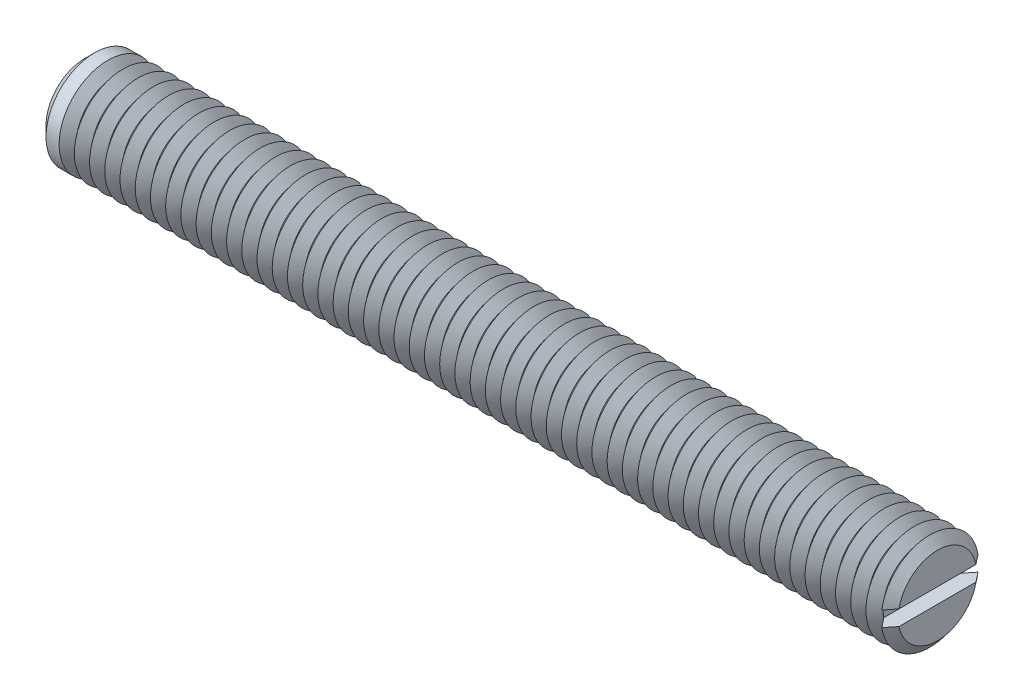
ISO-10303-21;
HEADER;
FILE_DESCRIPTION(('STEP AP214'),'2;1');
FILE_NAME('part.step','',(''),(''),'','','');
FILE_SCHEMA(('AUTOMOTIVE_DESIGN { 1 0 10303 214 1 1 1 1 }'));
ENDSEC;
DATA;
#1=APPLICATION_CONTEXT('core data for automotive mechanical design processes');
#2=APPLICATION_PROTOCOL_DEFINITION('international standard','automotive_design',2000,#1);
#3=PRODUCT_CONTEXT('',#1,'mechanical');
#4=PRODUCT('Part','Part','',(#3));
#5=PRODUCT_RELATED_PRODUCT_CATEGORY('part','',(#4));
#6=PRODUCT_DEFINITION_FORMATION('','',#4);
#7=PRODUCT_DEFINITION_CONTEXT('part definition',#1,'design');
#8=PRODUCT_DEFINITION('design','',#6,#7);
#9=PRODUCT_DEFINITION_SHAPE('','',#8);
#10=(LENGTH_UNIT() NAMED_UNIT(*) SI_UNIT(.MILLI.,.METRE.));
#11=(NAMED_UNIT(*) PLANE_ANGLE_UNIT() SI_UNIT($,.RADIAN.));
#12=(NAMED_UNIT(*) SI_UNIT($,.STERADIAN.) SOLID_ANGLE_UNIT());
#13=UNCERTAINTY_MEASURE_WITH_UNIT(LENGTH_MEASURE(1.E-05),#10,'distance_accuracy_value','');
#14=(GEOMETRIC_REPRESENTATION_CONTEXT(3) GLOBAL_UNCERTAINTY_ASSIGNED_CONTEXT((#13)) GLOBAL_UNIT_ASSIGNED_CONTEXT((#10,
#11,#12)) REPRESENTATION_CONTEXT('',''));
#15=CARTESIAN_POINT('',(0.,0.,0.));
#16=DIRECTION('',(0.,0.,1.));
#17=DIRECTION('',(1.,0.,0.));
#18=AXIS2_PLACEMENT_3D('',#15,#16,#17);
#19=CARTESIAN_POINT('',(34.375,0.,0.));
#20=DIRECTION('',(1.,0.,0.));
#21=DIRECTION('',(0.,0.,-1.));
#22=AXIS2_PLACEMENT_3D('',#19,#20,#21);
#23=CONICAL_SURFACE('',#22,4.,0.895664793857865);
#24=CARTESIAN_POINT('',(34.375,0.,0.));
#25=DIRECTION('',(-1.,0.,0.));
#26=DIRECTION('',(0.,0.,1.));
#27=AXIS2_PLACEMENT_3D('',#24,#25,#26);
#28=CIRCLE('',#27,4.);
#29=CARTESIAN_POINT('',(34.375,-0.625,-3.95087015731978));
#30=VERTEX_POINT('',#29);
#31=CARTESIAN_POINT('',(34.375,-0.625000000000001,3.95087015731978));
#32=VERTEX_POINT('',#31);
#33=EDGE_CURVE('E117',#30,#32,#28,.T.);
#34=ORIENTED_EDGE('',*,*,#33,.T.);
#35=CARTESIAN_POINT('',(38.1614902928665,-0.625,-8.70692181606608));
#36=CARTESIAN_POINT('',(37.9148555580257,-0.625,-8.39807520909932));
#37=CARTESIAN_POINT('',(37.6682552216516,-0.625,-8.08920109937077));
#38=CARTESIAN_POINT('',(37.17514080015,-0.625,-7.47132164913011));
#39=CARTESIAN_POINT('',(36.9286267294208,-0.625,-7.16231629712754));
#40=CARTESIAN_POINT('',(36.4351922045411,-0.625,-6.54345822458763));
#41=CARTESIAN_POINT('',(36.1882721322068,-0.625,-6.233605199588));
#42=CARTESIAN_POINT('',(35.6947157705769,-0.625,-5.61373487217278));
#43=CARTESIAN_POINT('',(35.4480794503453,-0.625,-5.30371759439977));
#44=CARTESIAN_POINT('',(35.0704817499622,-0.625,-4.82841623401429));
#45=CARTESIAN_POINT('',(34.9393680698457,-0.625,-4.6632531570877));
#46=CARTESIAN_POINT('',(34.6773052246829,-0.625,-4.33279290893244));
#47=CARTESIAN_POINT('',(34.5463560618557,-0.625,-4.16749573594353));
#48=CARTESIAN_POINT('',(34.2846416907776,-0.625,-3.83665276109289));
#49=CARTESIAN_POINT('',(34.1538765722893,-0.625,-3.67110688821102));
#50=CARTESIAN_POINT('',(33.8926971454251,-0.625,-3.33975147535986));
#51=CARTESIAN_POINT('',(33.7622828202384,-0.625,-3.1739419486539));
#52=CARTESIAN_POINT('',(33.5022082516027,-0.625,-2.842170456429));
#53=CARTESIAN_POINT('',(33.3725471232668,-0.625,-2.67620918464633));
#54=CARTESIAN_POINT('',(33.1140928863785,-0.625,-2.34356113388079));
#55=CARTESIAN_POINT('',(32.985299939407,-0.625,-2.17687422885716));
#56=CARTESIAN_POINT('',(32.7934479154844,-0.625,-1.92591523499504));
#57=CARTESIAN_POINT('',(32.7297426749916,-0.625,-1.84213757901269));
#58=CARTESIAN_POINT('',(32.6029724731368,-0.625,-1.67409978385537));
#59=CARTESIAN_POINT('',(32.5399075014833,-0.625,-1.58983965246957));
#60=CARTESIAN_POINT('',(32.4147785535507,-0.625,-1.42061659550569));
#61=CARTESIAN_POINT('',(32.352714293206,-0.625,-1.3356538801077));
#62=CARTESIAN_POINT('',(32.2301881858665,-0.625,-1.16458302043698));
#63=CARTESIAN_POINT('',(32.1697261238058,-0.625,-1.0784750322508));
#64=CARTESIAN_POINT('',(32.0976838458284,-0.625,-0.972092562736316));
#65=CARTESIAN_POINT('',(32.0847024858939,-0.625,-0.952767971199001));
#66=CARTESIAN_POINT('',(32.0589128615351,-0.625,-0.91400323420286));
#67=CARTESIAN_POINT('',(32.0461046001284,-0.625,-0.894563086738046));
#68=CARTESIAN_POINT('',(32.0079767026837,-0.625,-0.836043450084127));
#69=CARTESIAN_POINT('',(31.9829560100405,-0.625,-0.796767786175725));
#70=CARTESIAN_POINT('',(31.9339776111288,-0.625,-0.717444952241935));
#71=CARTESIAN_POINT('',(31.9100221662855,-0.625,-0.677396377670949));
#72=CARTESIAN_POINT('',(31.8637207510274,-0.625,-0.596377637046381));
#73=CARTESIAN_POINT('',(31.841374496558,-0.625,-0.555407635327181));
#74=CARTESIAN_POINT('',(31.8059952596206,-0.625,-0.485816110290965));
#75=CARTESIAN_POINT('',(31.7923049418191,-0.625,-0.457533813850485));
#76=CARTESIAN_POINT('',(31.766378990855,-0.625,-0.400313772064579));
#77=CARTESIAN_POINT('',(31.7541438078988,-0.625,-0.371375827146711));
#78=CARTESIAN_POINT('',(31.7204304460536,-0.625,-0.283641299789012));
#79=CARTESIAN_POINT('',(31.7017774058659,-0.625,-0.223617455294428));
#80=CARTESIAN_POINT('',(31.6847644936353,-0.625,-0.139102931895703));
#81=CARTESIAN_POINT('',(31.68099555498,-0.625,-0.115688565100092));
#82=CARTESIAN_POINT('',(31.6755004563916,-0.625,-0.0686260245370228));
#83=CARTESIAN_POINT('',(31.6737732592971,-0.625,-0.0449779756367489));
#84=CARTESIAN_POINT('',(31.6724835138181,-0.625,0.00234331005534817));
#85=CARTESIAN_POINT('',(31.6729177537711,-0.625,0.0260164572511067));
#86=CARTESIAN_POINT('',(31.6759063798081,-0.625,0.0732268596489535));
#87=CARTESIAN_POINT('',(31.6784611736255,-0.625,0.0967640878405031));
#88=CARTESIAN_POINT('',(31.691400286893,-0.625,0.182271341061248));
#89=CARTESIAN_POINT('',(31.7077446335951,-0.625,0.243366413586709));
#90=CARTESIAN_POINT('',(31.7388887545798,-0.625,0.332669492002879));
#91=CARTESIAN_POINT('',(31.7504419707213,-0.625,0.36217480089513));
#92=CARTESIAN_POINT('',(31.7752210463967,-0.625,0.420481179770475));
#93=CARTESIAN_POINT('',(31.7884464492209,-0.625,0.44928243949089));
#94=CARTESIAN_POINT('',(31.8174677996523,-0.625,0.508972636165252));
#95=CARTESIAN_POINT('',(31.8333885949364,-0.625,0.539799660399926));
#96=CARTESIAN_POINT('',(31.8663425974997,-0.625,0.600856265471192));
#97=CARTESIAN_POINT('',(31.8833759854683,-0.625,0.631085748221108));
#98=CARTESIAN_POINT('',(31.9357348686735,-0.625,0.721100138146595));
#99=CARTESIAN_POINT('',(31.9722948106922,-0.625,0.780163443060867));
#100=CARTESIAN_POINT('',(32.0474296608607,-0.625,0.897183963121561));
#101=CARTESIAN_POINT('',(32.0860094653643,-0.625,0.955137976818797));
#102=CARTESIAN_POINT('',(32.1644096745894,-0.625,1.07020655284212));
#103=CARTESIAN_POINT('',(32.2042302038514,-0.625,1.12732103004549));
#104=CARTESIAN_POINT('',(32.2847841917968,-0.625,1.24108525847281));
#105=CARTESIAN_POINT('',(32.3255194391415,-0.625,1.29773373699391));
#106=CARTESIAN_POINT('',(32.4075780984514,-0.625,1.41061176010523));
#107=CARTESIAN_POINT('',(32.4489015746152,-0.625,1.46684125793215));
#108=CARTESIAN_POINT('',(32.5733456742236,-0.625,1.63486189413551));
#109=CARTESIAN_POINT('',(32.6570882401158,-0.625,1.74619171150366));
#110=CARTESIAN_POINT('',(32.8245788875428,-0.625,1.96690364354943));
#111=CARTESIAN_POINT('',(32.9083166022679,-0.625,2.07629366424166));
#112=CARTESIAN_POINT('',(33.0763821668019,-0.625,2.29462016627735));
#113=CARTESIAN_POINT('',(33.1607100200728,-0.625,2.40355664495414));
#114=CARTESIAN_POINT('',(33.4142762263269,-0.625,2.72992534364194));
#115=CARTESIAN_POINT('',(33.5840912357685,-0.625,2.9469090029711));
#116=CARTESIAN_POINT('',(33.9246141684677,-0.625,3.38042406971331));
#117=CARTESIAN_POINT('',(34.0953226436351,-0.625,3.59695504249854));
#118=CARTESIAN_POINT('',(34.4371950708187,-0.625,4.02965109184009));
#119=CARTESIAN_POINT('',(34.6083590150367,-0.625,4.24581617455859));
#120=CARTESIAN_POINT('',(34.9504500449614,-0.625,4.6772574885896));
#121=CARTESIAN_POINT('',(35.1213762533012,-0.625,4.89253441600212));
#122=CARTESIAN_POINT('',(35.4634226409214,-0.625,5.32293566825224));
#123=CARTESIAN_POINT('',(35.634542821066,-0.625,5.53805999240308));
#124=CARTESIAN_POINT('',(36.1480384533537,-0.625,6.18319284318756));
#125=CARTESIAN_POINT('',(36.4906134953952,-0.625,6.61304248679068));
#126=CARTESIAN_POINT('',(36.9438892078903,-0.625,7.18140561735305));
#127=CARTESIAN_POINT('',(37.0544613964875,-0.625,7.32002163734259));
#128=CARTESIAN_POINT('',(37.2756363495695,-0.625,7.59723760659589));
#129=CARTESIAN_POINT('',(37.386239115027,-0.625,7.73583755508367));
#130=CARTESIAN_POINT('',(37.6076076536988,-0.625,8.01319622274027));
#131=CARTESIAN_POINT('',(37.7183734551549,-0.625,8.15195491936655));
#132=CARTESIAN_POINT('',(37.939920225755,-0.625,8.42945184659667));
#133=CARTESIAN_POINT('',(38.0507011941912,-0.625,8.56819007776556));
#134=CARTESIAN_POINT('',(38.1614902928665,-0.625,8.70692181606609));
#135=B_SPLINE_CURVE_WITH_KNOTS('',3,(#35,#36,#37,#38,#39,#40,#41,#42,#43,#44,#45,#46,#47,#48,
#49,#50,#51,#52,#53,#54,#55,#56,#57,#58,#59,#60,#61,#62,#63,#64,#65,#66,#67,#68,#69,#70,#71,#72,
#73,#74,#75,#76,#77,#78,#79,#80,#81,#82,#83,#84,#85,#86,#87,#88,#89,#90,#91,#92,#93,#94,#95,#96,
#97,#98,#99,#100,#101,#102,#103,#104,#105,#106,#107,#108,#109,#110,#111,#112,#113,#114,#115,
#116,#117,#118,#119,#120,#121,#122,#123,#124,#125,#126,#127,#128,#129,#130,#131,#132,#133,#134),
.UNSPECIFIED.,.F.,.F.,(4,2,2,2,2,2,2,2,2,2,2,2,2,2,2,2,2,2,2,2,2,2,2,2,2,2,2,2,2,2,2,2,2,2,2,2,
2,2,2,2,2,2,2,2,2,2,2,2,2,4),(0.,1.18572103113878,2.37158837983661,3.56020338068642,
4.74867342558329,5.38130812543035,6.01395126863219,6.64683693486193,7.27969171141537,
7.91151062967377,8.54344406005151,8.85918511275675,9.17492108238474,9.49056578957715,
9.80616791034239,9.8760068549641,9.94584701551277,10.0855382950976,10.2255132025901,
10.3654633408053,10.4596856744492,10.5539370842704,10.741396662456,10.8124690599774,
10.8835053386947,10.9544360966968,11.0253804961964,11.2137597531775,11.3088096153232,
11.403833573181,11.5078935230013,11.6119704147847,11.8202840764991,12.0291284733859,
12.2379939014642,12.4473111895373,12.6566515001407,13.0745694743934,13.487851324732,
13.9011356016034,14.7277337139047,15.5549232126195,16.3820986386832,17.2067434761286,
18.0313920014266,19.6803778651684,20.2123228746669,20.7442873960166,21.2769292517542,
21.8095515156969),.UNSPECIFIED.);
#136=CARTESIAN_POINT('',(33.75,-0.625,3.1581247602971));
#137=VERTEX_POINT('',#136);
#138=EDGE_CURVE('E109',#137,#32,#135,.T.);
#139=ORIENTED_EDGE('',*,*,#138,.F.);
#140=CARTESIAN_POINT('',(33.75,0.,0.));
#141=DIRECTION('',(-1.,0.,0.));
#142=DIRECTION('',(0.,0.,1.));
#143=AXIS2_PLACEMENT_3D('',#140,#141,#142);
#144=CIRCLE('',#143,3.2193752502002);
#145=CARTESIAN_POINT('',(33.75,-0.625,-3.1581247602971));
#146=VERTEX_POINT('',#145);
#147=EDGE_CURVE('E655',#146,#137,#144,.T.);
#148=ORIENTED_EDGE('',*,*,#147,.F.);
#149=EDGE_CURVE('E58',#30,#146,#135,.T.);
#150=ORIENTED_EDGE('',*,*,#149,.F.);
#151=EDGE_LOOP('',(#34,#139,#148,#150));
#152=FACE_BOUND('',#151,.T.);
#153=ADVANCED_FACE('F37',(#152),#23,.T.);
#154=CARTESIAN_POINT('',(34.375,0.625000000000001,3.95087015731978));
#155=VERTEX_POINT('',#154);
#156=CARTESIAN_POINT('',(34.375,0.625000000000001,-3.95087015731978));
#157=VERTEX_POINT('',#156);
#158=EDGE_CURVE('E100',#155,#157,#28,.T.);
#159=ORIENTED_EDGE('',*,*,#158,.T.);
#160=CARTESIAN_POINT('',(38.1614902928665,0.625,8.70692181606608));
#161=CARTESIAN_POINT('',(37.9148555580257,0.625,8.39807520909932));
#162=CARTESIAN_POINT('',(37.6682552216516,0.625,8.08920109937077));
#163=CARTESIAN_POINT('',(37.17514080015,0.625,7.47132164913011));
#164=CARTESIAN_POINT('',(36.9286267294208,0.625,7.16231629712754));
#165=CARTESIAN_POINT('',(36.4351922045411,0.625,6.54345822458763));
#166=CARTESIAN_POINT('',(36.1882721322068,0.625,6.233605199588));
#167=CARTESIAN_POINT('',(35.6947157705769,0.625,5.61373487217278));
#168=CARTESIAN_POINT('',(35.4480794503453,0.625,5.30371759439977));
#169=CARTESIAN_POINT('',(35.0704817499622,0.625,4.82841623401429));
#170=CARTESIAN_POINT('',(34.9393680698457,0.625,4.6632531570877));
#171=CARTESIAN_POINT('',(34.6773052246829,0.625,4.33279290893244));
#172=CARTESIAN_POINT('',(34.5463560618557,0.625,4.16749573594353));
#173=CARTESIAN_POINT('',(34.2846416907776,0.625,3.83665276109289));
#174=CARTESIAN_POINT('',(34.1538765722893,0.625,3.67110688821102));
#175=CARTESIAN_POINT('',(33.8926971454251,0.625,3.33975147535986));
#176=CARTESIAN_POINT('',(33.7622828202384,0.625,3.1739419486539));
#177=CARTESIAN_POINT('',(33.5022082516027,0.625,2.842170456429));
#178=CARTESIAN_POINT('',(33.3725471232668,0.625,2.67620918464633));
#179=CARTESIAN_POINT('',(33.1140928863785,0.625,2.34356113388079));
#180=CARTESIAN_POINT('',(32.985299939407,0.625,2.17687422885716));
#181=CARTESIAN_POINT('',(32.7934479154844,0.625,1.92591523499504));
#182=CARTESIAN_POINT('',(32.7297426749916,0.625,1.84213757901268));
#183=CARTESIAN_POINT('',(32.6029724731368,0.625,1.67409978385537));
#184=CARTESIAN_POINT('',(32.5399075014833,0.625,1.58983965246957));
#185=CARTESIAN_POINT('',(32.4147785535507,0.625,1.42061659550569));
#186=CARTESIAN_POINT('',(32.3527142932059,0.625,1.3356538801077));
#187=CARTESIAN_POINT('',(32.2301881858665,0.625,1.16458302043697));
#188=CARTESIAN_POINT('',(32.1697261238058,0.625,1.07847503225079));
#189=CARTESIAN_POINT('',(32.0976838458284,0.625,0.972092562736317));
#190=CARTESIAN_POINT('',(32.0847024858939,0.625,0.952767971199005));
#191=CARTESIAN_POINT('',(32.0589128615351,0.625,0.914003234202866));
#192=CARTESIAN_POINT('',(32.0461046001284,0.625,0.894563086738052));
#193=CARTESIAN_POINT('',(32.0079767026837,0.625,0.836043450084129));
#194=CARTESIAN_POINT('',(31.9829560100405,0.625,0.796767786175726));
#195=CARTESIAN_POINT('',(31.9339776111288,0.625,0.717444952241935));
#196=CARTESIAN_POINT('',(31.9100221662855,0.625,0.677396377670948));
#197=CARTESIAN_POINT('',(31.8637207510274,0.625,0.59637763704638));
#198=CARTESIAN_POINT('',(31.8413744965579,0.625,0.555407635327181));
#199=CARTESIAN_POINT('',(31.8059952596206,0.625,0.485816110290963));
#200=CARTESIAN_POINT('',(31.7923049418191,0.625,0.45753381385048));
#201=CARTESIAN_POINT('',(31.766378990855,0.625,0.400313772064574));
#202=CARTESIAN_POINT('',(31.7541438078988,0.625,0.371375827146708));
#203=CARTESIAN_POINT('',(31.7204304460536,0.625,0.283641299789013));
#204=CARTESIAN_POINT('',(31.7017774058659,0.625,0.223617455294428));
#205=CARTESIAN_POINT('',(31.6847644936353,0.625,0.139102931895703));
#206=CARTESIAN_POINT('',(31.68099555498,0.625,0.115688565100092));
#207=CARTESIAN_POINT('',(31.6755004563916,0.625,0.0686260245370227));
#208=CARTESIAN_POINT('',(31.6737732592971,0.625,0.0449779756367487));
#209=CARTESIAN_POINT('',(31.6724835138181,0.625,-0.00234331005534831));
#210=CARTESIAN_POINT('',(31.6729177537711,0.625,-0.0260164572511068));
#211=CARTESIAN_POINT('',(31.6759063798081,0.625,-0.0732268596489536));
#212=CARTESIAN_POINT('',(31.6784611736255,0.625,-0.0967640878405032));
#213=CARTESIAN_POINT('',(31.691400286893,0.625,-0.182271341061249));
#214=CARTESIAN_POINT('',(31.7077446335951,0.625,-0.243366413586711));
#215=CARTESIAN_POINT('',(31.7388887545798,0.625,-0.33266949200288));
#216=CARTESIAN_POINT('',(31.7504419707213,0.625,-0.36217480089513));
#217=CARTESIAN_POINT('',(31.7752210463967,0.625,-0.420481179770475));
#218=CARTESIAN_POINT('',(31.7884464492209,0.625,-0.44928243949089));
#219=CARTESIAN_POINT('',(31.8174677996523,0.625,-0.50897263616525));
#220=CARTESIAN_POINT('',(31.8333885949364,0.625,-0.539799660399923));
#221=CARTESIAN_POINT('',(31.8663425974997,0.625,-0.600856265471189));
#222=CARTESIAN_POINT('',(31.8833759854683,0.625,-0.631085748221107));
#223=CARTESIAN_POINT('',(31.9357348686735,0.625,-0.721100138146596));
#224=CARTESIAN_POINT('',(31.9722948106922,0.625,-0.780163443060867));
#225=CARTESIAN_POINT('',(32.0474296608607,0.625,-0.897183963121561));
#226=CARTESIAN_POINT('',(32.0860094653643,0.625,-0.955137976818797));
#227=CARTESIAN_POINT('',(32.1644096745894,0.625,-1.07020655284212));
#228=CARTESIAN_POINT('',(32.2042302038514,0.625,-1.12732103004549));
#229=CARTESIAN_POINT('',(32.2847841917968,0.625,-1.24108525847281));
#230=CARTESIAN_POINT('',(32.3255194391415,0.625,-1.29773373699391));
#231=CARTESIAN_POINT('',(32.4075780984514,0.625,-1.41061176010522));
#232=CARTESIAN_POINT('',(32.4489015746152,0.625,-1.46684125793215));
#233=CARTESIAN_POINT('',(32.5733456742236,0.625,-1.63486189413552));
#234=CARTESIAN_POINT('',(32.6570882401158,0.625,-1.74619171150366));
#235=CARTESIAN_POINT('',(32.8245788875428,0.625,-1.96690364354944));
#236=CARTESIAN_POINT('',(32.9083166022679,0.625,-2.07629366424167));
#237=CARTESIAN_POINT('',(33.0763821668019,0.625,-2.29462016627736));
#238=CARTESIAN_POINT('',(33.1607100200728,0.625,-2.40355664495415));
#239=CARTESIAN_POINT('',(33.4142762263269,0.625,-2.72992534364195));
#240=CARTESIAN_POINT('',(33.5840912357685,0.625,-2.94690900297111));
#241=CARTESIAN_POINT('',(33.9246141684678,0.625,-3.38042406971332));
#242=CARTESIAN_POINT('',(34.0953226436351,0.625,-3.59695504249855));
#243=CARTESIAN_POINT('',(34.4371950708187,0.625,-4.0296510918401));
#244=CARTESIAN_POINT('',(34.6083590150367,0.625,-4.24581617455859));
#245=CARTESIAN_POINT('',(34.9504500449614,0.625,-4.67725748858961));
#246=CARTESIAN_POINT('',(35.1213762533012,0.625,-4.89253441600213));
#247=CARTESIAN_POINT('',(35.4634226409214,0.625,-5.32293566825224));
#248=CARTESIAN_POINT('',(35.634542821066,0.625,-5.53805999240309));
#249=CARTESIAN_POINT('',(36.1480384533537,0.625,-6.18319284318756));
#250=CARTESIAN_POINT('',(36.4906134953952,0.625,-6.61304248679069));
#251=CARTESIAN_POINT('',(36.9438892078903,0.625,-7.18140561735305));
#252=CARTESIAN_POINT('',(37.0544613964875,0.625,-7.3200216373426));
#253=CARTESIAN_POINT('',(37.2756363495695,0.625,-7.5972376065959));
#254=CARTESIAN_POINT('',(37.386239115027,0.625,-7.73583755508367));
#255=CARTESIAN_POINT('',(37.6076076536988,0.625,-8.01319622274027));
#256=CARTESIAN_POINT('',(37.7183734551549,0.625,-8.15195491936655));
#257=CARTESIAN_POINT('',(37.939920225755,0.625,-8.42945184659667));
#258=CARTESIAN_POINT('',(38.0507011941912,0.625,-8.56819007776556));
#259=CARTESIAN_POINT('',(38.1614902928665,0.625,-8.70692181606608));
#260=B_SPLINE_CURVE_WITH_KNOTS('',3,(#160,#161,#162,#163,#164,#165,#166,#167,#168,#169,#170,
#171,#172,#173,#174,#175,#176,#177,#178,#179,#180,#181,#182,#183,#184,#185,#186,#187,#188,#189,
#190,#191,#192,#193,#194,#195,#196,#197,#198,#199,#200,#201,#202,#203,#204,#205,#206,#207,#208,
#209,#210,#211,#212,#213,#214,#215,#216,#217,#218,#219,#220,#221,#222,#223,#224,#225,#226,#227,
#228,#229,#230,#231,#232,#233,#234,#235,#236,#237,#238,#239,#240,#241,#242,#243,#244,#245,#246,
#247,#248,#249,#250,#251,#252,#253,#254,#255,#256,#257,#258,#259),.UNSPECIFIED.,.F.,.F.,(4,2,2,
2,2,2,2,2,2,2,2,2,2,2,2,2,2,2,2,2,2,2,2,2,2,2,2,2,2,2,2,2,2,2,2,2,2,2,2,2,2,2,2,2,2,2,2,2,2,4),
(0.,1.18572103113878,2.3715883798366,3.56020338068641,4.74867342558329,5.38130812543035,
6.01395126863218,6.64683693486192,7.27969171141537,7.91151062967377,8.54344406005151,
8.85918511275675,9.17492108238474,9.49056578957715,9.80616791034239,9.87600685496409,
9.94584701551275,10.0855382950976,10.2255132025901,10.3654633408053,10.4596856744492,
10.5539370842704,10.741396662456,10.8124690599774,10.8835053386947,10.9544360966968,
11.0253804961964,11.2137597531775,11.3088096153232,11.403833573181,11.5078935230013,
11.6119704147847,11.8202840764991,12.0291284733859,12.2379939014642,12.4473111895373,
12.6566515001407,13.0745694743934,13.487851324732,13.9011356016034,14.7277337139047,
15.5549232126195,16.3820986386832,17.2067434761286,18.0313920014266,19.6803778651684,
20.2123228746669,20.7442873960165,21.2769292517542,21.8095515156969),.UNSPECIFIED.);
#261=CARTESIAN_POINT('',(33.75,0.625,-3.1581247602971));
#262=VERTEX_POINT('',#261);
#263=EDGE_CURVE('E110',#262,#157,#260,.T.);
#264=ORIENTED_EDGE('',*,*,#263,.F.);
#265=CARTESIAN_POINT('',(33.75,0.625,3.1581247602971));
#266=VERTEX_POINT('',#265);
#267=EDGE_CURVE('E103',#266,#262,#144,.T.);
#268=ORIENTED_EDGE('',*,*,#267,.F.);
#269=EDGE_CURVE('E97',#155,#266,#260,.T.);
#270=ORIENTED_EDGE('',*,*,#269,.F.);
#271=EDGE_LOOP('',(#159,#264,#268,#270));
#272=FACE_BOUND('',#271,.T.);
#273=ADVANCED_FACE('F99',(#272),#23,.T.);
#274=CARTESIAN_POINT('',(33.75,0.,0.));
#275=DIRECTION('',(-1.,0.,0.));
#276=DIRECTION('',(0.,0.,1.));
#277=AXIS2_PLACEMENT_3D('',#274,#275,#276);
#278=CONICAL_SURFACE('',#277,3.2193752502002,0.895664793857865);
#279=CARTESIAN_POINT('',(33.125,0.,0.));
#280=DIRECTION('',(-1.,0.,0.));
#281=DIRECTION('',(0.,0.,1.));
#282=AXIS2_PLACEMENT_3D('',#279,#280,#281);
#283=CIRCLE('',#282,4.);
#284=CARTESIAN_POINT('',(33.125,0.,4.));
#285=VERTEX_POINT('',#284);
#286=EDGE_CURVE('E642',#285,#285,#283,.T.);
#287=ORIENTED_EDGE('',*,*,#286,.F.);
#288=EDGE_LOOP('',(#287));
#289=FACE_BOUND('',#288,.T.);
#290=ORIENTED_EDGE('',*,*,#267,.T.);
#291=EDGE_CURVE('E650',#262,#146,#144,.T.);
#292=ORIENTED_EDGE('',*,*,#291,.T.);
#293=ORIENTED_EDGE('',*,*,#147,.T.);
#294=EDGE_CURVE('E648',#137,#266,#144,.T.);
#295=ORIENTED_EDGE('',*,*,#294,.T.);
#296=EDGE_LOOP('',(#290,#292,#293,#295));
#297=FACE_BOUND('',#296,.T.);
#298=ADVANCED_FACE('F167',(#289,#297),#278,.T.);
#299=CARTESIAN_POINT('',(35.,0.,0.));
#300=DIRECTION('',(1.,0.,0.));
#301=DIRECTION('',(0.,0.,-1.));
#302=AXIS2_PLACEMENT_3D('',#299,#300,#301);
#303=PLANE('',#302);
#304=CARTESIAN_POINT('',(35.,0.,0.));
#305=DIRECTION('',(-1.,0.,0.));
#306=DIRECTION('',(0.,0.,1.));
#307=AXIS2_PLACEMENT_3D('',#304,#305,#306);
#308=CIRCLE('',#307,3.2193752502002);
#309=CARTESIAN_POINT('',(35.,0.625,3.1581247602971));
#310=VERTEX_POINT('',#309);
#311=CARTESIAN_POINT('',(35.,0.625,-3.1581247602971));
#312=VERTEX_POINT('',#311);
#313=EDGE_CURVE('E159',#310,#312,#308,.T.);
#314=ORIENTED_EDGE('',*,*,#313,.F.);
#315=DIRECTION('',(0.,0.,1.));
#316=VECTOR('',#315,1.);
#317=CARTESIAN_POINT('',(35.,0.625,0.));
#318=LINE('',#317,#316);
#319=EDGE_CURVE('E122',#312,#310,#318,.T.);
#320=ORIENTED_EDGE('',*,*,#319,.F.);
#321=EDGE_LOOP('',(#314,#320));
#322=FACE_BOUND('',#321,.T.);
#323=ADVANCED_FACE('F171',(#322),#303,.T.);
#324=CARTESIAN_POINT('',(35.,-0.625,-3.1581247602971));
#325=VERTEX_POINT('',#324);
#326=CARTESIAN_POINT('',(35.,-0.625,3.1581247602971));
#327=VERTEX_POINT('',#326);
#328=EDGE_CURVE('E66',#325,#327,#308,.T.);
#329=ORIENTED_EDGE('',*,*,#328,.F.);
#330=DIRECTION('',(0.,0.,-1.));
#331=VECTOR('',#330,1.);
#332=CARTESIAN_POINT('',(35.,-0.625,0.));
#333=LINE('',#332,#331);
#334=EDGE_CURVE('E136',#327,#325,#333,.T.);
#335=ORIENTED_EDGE('',*,*,#334,.F.);
#336=EDGE_LOOP('',(#329,#335));
#337=FACE_BOUND('',#336,.T.);
#338=ADVANCED_FACE('F201',(#337),#303,.T.);
#339=CARTESIAN_POINT('',(35.,0.,0.));
#340=DIRECTION('',(-1.,0.,0.));
#341=DIRECTION('',(0.,0.,1.));
#342=AXIS2_PLACEMENT_3D('',#339,#340,#341);
#343=CONICAL_SURFACE('',#342,3.2193752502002,0.895664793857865);
#344=ORIENTED_EDGE('',*,*,#158,.F.);
#345=CARTESIAN_POINT('',(30.5885097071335,0.625,-8.70692181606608));
#346=CARTESIAN_POINT('',(30.8351444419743,0.625,-8.39807520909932));
#347=CARTESIAN_POINT('',(31.0817447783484,0.625,-8.08920109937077));
#348=CARTESIAN_POINT('',(31.57485919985,0.625,-7.47132164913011));
#349=CARTESIAN_POINT('',(31.8213732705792,0.625,-7.16231629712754));
#350=CARTESIAN_POINT('',(32.3148077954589,0.625,-6.54345822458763));
#351=CARTESIAN_POINT('',(32.5617278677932,0.625,-6.233605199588));
#352=CARTESIAN_POINT('',(33.0552842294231,0.625,-5.61373487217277));
#353=CARTESIAN_POINT('',(33.3019205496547,0.625,-5.30371759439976));
#354=CARTESIAN_POINT('',(33.6795182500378,0.625,-4.82841623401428));
#355=CARTESIAN_POINT('',(33.8106319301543,0.625,-4.66325315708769));
#356=CARTESIAN_POINT('',(34.0726947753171,0.625,-4.33279290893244));
#357=CARTESIAN_POINT('',(34.2036439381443,0.625,-4.16749573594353));
#358=CARTESIAN_POINT('',(34.4653583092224,0.625,-3.83665276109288));
#359=CARTESIAN_POINT('',(34.5961234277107,0.625,-3.67110688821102));
#360=CARTESIAN_POINT('',(34.8573028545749,0.625,-3.33975147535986));
#361=CARTESIAN_POINT('',(34.9877171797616,0.625,-3.1739419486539));
#362=CARTESIAN_POINT('',(35.2477917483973,0.625,-2.842170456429));
#363=CARTESIAN_POINT('',(35.3774528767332,0.625,-2.67620918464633));
#364=CARTESIAN_POINT('',(35.6359071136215,0.625,-2.34356113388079));
#365=CARTESIAN_POINT('',(35.764700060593,0.625,-2.17687422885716));
#366=CARTESIAN_POINT('',(35.9565520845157,0.625,-1.92591523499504));
#367=CARTESIAN_POINT('',(36.0202573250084,0.625,-1.84213757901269));
#368=CARTESIAN_POINT('',(36.1470275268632,0.625,-1.67409978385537));
#369=CARTESIAN_POINT('',(36.2100924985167,0.625,-1.58983965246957));
#370=CARTESIAN_POINT('',(36.3352214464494,0.625,-1.42061659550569));
#371=CARTESIAN_POINT('',(36.3972857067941,0.625,-1.3356538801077));
#372=CARTESIAN_POINT('',(36.5198118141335,0.625,-1.16458302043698));
#373=CARTESIAN_POINT('',(36.5802738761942,0.625,-1.0784750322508));
#374=CARTESIAN_POINT('',(36.6523161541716,0.625,-0.972092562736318));
#375=CARTESIAN_POINT('',(36.6652975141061,0.625,-0.952767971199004));
#376=CARTESIAN_POINT('',(36.691087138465,0.625,-0.914003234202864));
#377=CARTESIAN_POINT('',(36.7038953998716,0.625,-0.894563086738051));
#378=CARTESIAN_POINT('',(36.7420232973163,0.625,-0.836043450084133));
#379=CARTESIAN_POINT('',(36.7670439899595,0.625,-0.79676778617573));
#380=CARTESIAN_POINT('',(36.8160223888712,0.625,-0.71744495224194));
#381=CARTESIAN_POINT('',(36.8399778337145,0.625,-0.677396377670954));
#382=CARTESIAN_POINT('',(36.8862792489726,0.625,-0.596377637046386));
#383=CARTESIAN_POINT('',(36.9086255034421,0.625,-0.555407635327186));
#384=CARTESIAN_POINT('',(36.9440047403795,0.625,-0.485816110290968));
#385=CARTESIAN_POINT('',(36.9576950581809,0.625,-0.457533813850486));
#386=CARTESIAN_POINT('',(36.983621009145,0.625,-0.40031377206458));
#387=CARTESIAN_POINT('',(36.9958561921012,0.625,-0.371375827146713));
#388=CARTESIAN_POINT('',(37.0295695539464,0.625,-0.283641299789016));
#389=CARTESIAN_POINT('',(37.0482225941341,0.625,-0.22361745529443));
#390=CARTESIAN_POINT('',(37.0652355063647,0.625,-0.139102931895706));
#391=CARTESIAN_POINT('',(37.06900444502,0.625,-0.115688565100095));
#392=CARTESIAN_POINT('',(37.0744995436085,0.625,-0.0686260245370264));
#393=CARTESIAN_POINT('',(37.0762267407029,0.625,-0.0449779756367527));
#394=CARTESIAN_POINT('',(37.0775164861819,0.625,0.00234331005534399));
#395=CARTESIAN_POINT('',(37.077082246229,0.625,0.0260164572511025));
#396=CARTESIAN_POINT('',(37.0740936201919,0.625,0.0732268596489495));
#397=CARTESIAN_POINT('',(37.0715388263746,0.625,0.0967640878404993));
#398=CARTESIAN_POINT('',(37.058599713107,0.625,0.182271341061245));
#399=CARTESIAN_POINT('',(37.042255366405,0.625,0.243366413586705));
#400=CARTESIAN_POINT('',(37.0111112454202,0.625,0.332669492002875));
#401=CARTESIAN_POINT('',(36.9995580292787,0.625,0.362174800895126));
#402=CARTESIAN_POINT('',(36.9747789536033,0.625,0.420481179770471));
#403=CARTESIAN_POINT('',(36.9615535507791,0.625,0.449282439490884));
#404=CARTESIAN_POINT('',(36.9325322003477,0.625,0.508972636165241));
#405=CARTESIAN_POINT('',(36.9166114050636,0.625,0.539799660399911));
#406=CARTESIAN_POINT('',(36.8836574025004,0.625,0.600856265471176));
#407=CARTESIAN_POINT('',(36.8666240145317,0.625,0.631085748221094));
#408=CARTESIAN_POINT('',(36.8142651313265,0.625,0.721100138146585));
#409=CARTESIAN_POINT('',(36.7777051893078,0.625,0.780163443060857));
#410=CARTESIAN_POINT('',(36.7025703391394,0.625,0.897183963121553));
#411=CARTESIAN_POINT('',(36.6639905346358,0.625,0.955137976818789));
#412=CARTESIAN_POINT('',(36.5855903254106,0.625,1.07020655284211));
#413=CARTESIAN_POINT('',(36.5457697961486,0.625,1.12732103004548));
#414=CARTESIAN_POINT('',(36.4652158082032,0.625,1.2410852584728));
#415=CARTESIAN_POINT('',(36.4244805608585,0.625,1.2977337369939));
#416=CARTESIAN_POINT('',(36.3424219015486,0.625,1.41061176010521));
#417=CARTESIAN_POINT('',(36.3010984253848,0.625,1.46684125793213));
#418=CARTESIAN_POINT('',(36.1766543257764,0.625,1.6348618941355));
#419=CARTESIAN_POINT('',(36.0929117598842,0.625,1.74619171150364));
#420=CARTESIAN_POINT('',(35.9254211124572,0.625,1.96690364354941));
#421=CARTESIAN_POINT('',(35.8416833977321,0.625,2.07629366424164));
#422=CARTESIAN_POINT('',(35.6736178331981,0.625,2.29462016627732));
#423=CARTESIAN_POINT('',(35.5892899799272,0.625,2.40355664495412));
#424=CARTESIAN_POINT('',(35.3357237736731,0.625,2.72992534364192));
#425=CARTESIAN_POINT('',(35.1659087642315,0.625,2.94690900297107));
#426=CARTESIAN_POINT('',(34.8253858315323,0.625,3.38042406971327));
#427=CARTESIAN_POINT('',(34.654677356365,0.625,3.59695504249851));
#428=CARTESIAN_POINT('',(34.3128049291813,0.625,4.02965109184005));
#429=CARTESIAN_POINT('',(34.1416409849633,0.625,4.24581617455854));
#430=CARTESIAN_POINT('',(33.7995499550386,0.625,4.67725748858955));
#431=CARTESIAN_POINT('',(33.6286237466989,0.625,4.89253441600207));
#432=CARTESIAN_POINT('',(33.2865773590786,0.625,5.32293566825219));
#433=CARTESIAN_POINT('',(33.115457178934,0.625,5.53805999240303));
#434=CARTESIAN_POINT('',(32.6019615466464,0.625,6.1831928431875));
#435=CARTESIAN_POINT('',(32.2593865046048,0.625,6.61304248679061));
#436=CARTESIAN_POINT('',(31.8061107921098,0.625,7.18140561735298));
#437=CARTESIAN_POINT('',(31.6955386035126,0.625,7.32002163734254));
#438=CARTESIAN_POINT('',(31.4743636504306,0.625,7.59723760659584));
#439=CARTESIAN_POINT('',(31.363760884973,0.625,7.73583755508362));
#440=CARTESIAN_POINT('',(31.1423923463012,0.625,8.01319622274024));
#441=CARTESIAN_POINT('',(31.0316265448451,0.625,8.15195491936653));
#442=CARTESIAN_POINT('',(30.810079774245,0.625,8.42945184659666));
#443=CARTESIAN_POINT('',(30.6992988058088,0.625,8.56819007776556));
#444=CARTESIAN_POINT('',(30.5885097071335,0.625,8.70692181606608));
#445=B_SPLINE_CURVE_WITH_KNOTS('',3,(#345,#346,#347,#348,#349,#350,#351,#352,#353,#354,#355,
#356,#357,#358,#359,#360,#361,#362,#363,#364,#365,#366,#367,#368,#369,#370,#371,#372,#373,#374,
#375,#376,#377,#378,#379,#380,#381,#382,#383,#384,#385,#386,#387,#388,#389,#390,#391,#392,#393,
#394,#395,#396,#397,#398,#399,#400,#401,#402,#403,#404,#405,#406,#407,#408,#409,#410,#411,#412,
#413,#414,#415,#416,#417,#418,#419,#420,#421,#422,#423,#424,#425,#426,#427,#428,#429,#430,#431,
#432,#433,#434,#435,#436,#437,#438,#439,#440,#441,#442,#443,#444),.UNSPECIFIED.,.F.,.F.,(4,2,2,
2,2,2,2,2,2,2,2,2,2,2,2,2,2,2,2,2,2,2,2,2,2,2,2,2,2,2,2,2,2,2,2,2,2,2,2,2,2,2,2,2,2,2,2,2,2,4),
(0.,1.18572103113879,2.37158837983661,3.56020338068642,4.7486734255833,5.38130812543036,
6.01395126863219,6.64683693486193,7.27969171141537,7.91151062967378,8.54344406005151,
8.85918511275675,9.17492108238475,9.49056578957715,9.8061679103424,9.8760068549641,
9.94584701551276,10.0855382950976,10.2255132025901,10.3654633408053,10.4596856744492,
10.5539370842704,10.741396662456,10.8124690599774,10.8835053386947,10.9544360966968,
11.0253804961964,11.2137597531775,11.3088096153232,11.403833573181,11.5078935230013,
11.6119704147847,11.8202840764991,12.0291284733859,12.2379939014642,12.4473111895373,
12.6566515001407,13.0745694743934,13.487851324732,13.9011356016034,14.7277337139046,
15.5549232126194,16.3820986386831,17.2067434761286,18.0313920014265,19.6803778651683,
20.2123228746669,20.7442873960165,21.2769292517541,21.8095515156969),.UNSPECIFIED.);
#446=EDGE_CURVE('E41',#310,#155,#445,.T.);
#447=ORIENTED_EDGE('',*,*,#446,.F.);
#448=ORIENTED_EDGE('',*,*,#313,.T.);
#449=EDGE_CURVE('E11',#157,#312,#445,.T.);
#450=ORIENTED_EDGE('',*,*,#449,.F.);
#451=EDGE_LOOP('',(#344,#447,#448,#450));
#452=FACE_BOUND('',#451,.T.);
#453=ADVANCED_FACE('F114',(#452),#343,.T.);
#454=CARTESIAN_POINT('',(35.,0.625,-6.));
#455=DIRECTION('',(0.,1.,0.));
#456=DIRECTION('',(0.,0.,1.));
#457=AXIS2_PLACEMENT_3D('',#454,#455,#456);
#458=PLANE('',#457);
#459=ORIENTED_EDGE('',*,*,#446,.T.);
#460=ORIENTED_EDGE('',*,*,#269,.T.);
#461=DIRECTION('',(0.,0.,1.));
#462=VECTOR('',#461,1.);
#463=CARTESIAN_POINT('',(33.75,0.625,-6.));
#464=LINE('',#463,#462);
#465=EDGE_CURVE('E144',#262,#266,#464,.T.);
#466=ORIENTED_EDGE('',*,*,#465,.F.);
#467=ORIENTED_EDGE('',*,*,#263,.T.);
#468=ORIENTED_EDGE('',*,*,#449,.T.);
#469=ORIENTED_EDGE('',*,*,#319,.T.);
#470=EDGE_LOOP('',(#459,#460,#466,#467,#468,#469));
#471=FACE_BOUND('',#470,.T.);
#472=ADVANCED_FACE('F120',(#471),#458,.F.);
#473=ORIENTED_EDGE('',*,*,#33,.F.);
#474=CARTESIAN_POINT('',(30.5885097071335,-0.625,8.70692181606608));
#475=CARTESIAN_POINT('',(30.8351444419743,-0.625,8.3980752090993));
#476=CARTESIAN_POINT('',(31.0817447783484,-0.625,8.08920109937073));
#477=CARTESIAN_POINT('',(31.5748591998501,-0.625,7.47132164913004));
#478=CARTESIAN_POINT('',(31.8213732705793,-0.625,7.16231629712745));
#479=CARTESIAN_POINT('',(32.314807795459,-0.625,6.5434582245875));
#480=CARTESIAN_POINT('',(32.5617278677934,-0.625,6.23360519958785));
#481=CARTESIAN_POINT('',(33.0552842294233,-0.625,5.61373487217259));
#482=CARTESIAN_POINT('',(33.3019205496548,-0.625,5.30371759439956));
#483=CARTESIAN_POINT('',(33.6795182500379,-0.625,4.82841623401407));
#484=CARTESIAN_POINT('',(33.8106319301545,-0.625,4.66325315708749));
#485=CARTESIAN_POINT('',(34.0726947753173,-0.625,4.33279290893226));
#486=CARTESIAN_POINT('',(34.2036439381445,-0.625,4.16749573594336));
#487=CARTESIAN_POINT('',(34.4653583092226,-0.625,3.83665276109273));
#488=CARTESIAN_POINT('',(34.5961234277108,-0.625,3.67110688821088));
#489=CARTESIAN_POINT('',(34.857302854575,-0.625,3.33975147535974));
#490=CARTESIAN_POINT('',(34.9877171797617,-0.625,3.17394194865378));
#491=CARTESIAN_POINT('',(35.2477917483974,-0.625,2.8421704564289));
#492=CARTESIAN_POINT('',(35.3774528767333,-0.625,2.67620918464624));
#493=CARTESIAN_POINT('',(35.6359071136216,-0.625,2.34356113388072));
#494=CARTESIAN_POINT('',(35.7647000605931,-0.625,2.1768742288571));
#495=CARTESIAN_POINT('',(35.9565520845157,-0.625,1.925915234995));
#496=CARTESIAN_POINT('',(36.0202573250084,-0.625,1.84213757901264));
#497=CARTESIAN_POINT('',(36.1470275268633,-0.625,1.67409978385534));
#498=CARTESIAN_POINT('',(36.2100924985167,-0.625,1.58983965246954));
#499=CARTESIAN_POINT('',(36.3352214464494,-0.625,1.42061659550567));
#500=CARTESIAN_POINT('',(36.3972857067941,-0.625,1.33565388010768));
#501=CARTESIAN_POINT('',(36.5198118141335,-0.625,1.16458302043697));
#502=CARTESIAN_POINT('',(36.5802738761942,-0.625,1.07847503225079));
#503=CARTESIAN_POINT('',(36.6523161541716,-0.625,0.972092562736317));
#504=CARTESIAN_POINT('',(36.6652975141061,-0.625,0.952767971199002));
#505=CARTESIAN_POINT('',(36.691087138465,-0.625,0.914003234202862));
#506=CARTESIAN_POINT('',(36.7038953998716,-0.625,0.894563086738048));
#507=CARTESIAN_POINT('',(36.7420232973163,-0.625,0.83604345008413));
#508=CARTESIAN_POINT('',(36.7670439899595,-0.625,0.796767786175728));
#509=CARTESIAN_POINT('',(36.8160223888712,-0.625,0.717444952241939));
#510=CARTESIAN_POINT('',(36.8399778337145,-0.625,0.677396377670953));
#511=CARTESIAN_POINT('',(36.8862792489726,-0.625,0.596377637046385));
#512=CARTESIAN_POINT('',(36.9086255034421,-0.625,0.555407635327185));
#513=CARTESIAN_POINT('',(36.9440047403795,-0.625,0.485816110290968));
#514=CARTESIAN_POINT('',(36.9576950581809,-0.625,0.457533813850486));
#515=CARTESIAN_POINT('',(36.983621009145,-0.625,0.40031377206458));
#516=CARTESIAN_POINT('',(36.9958561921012,-0.625,0.371375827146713));
#517=CARTESIAN_POINT('',(37.0295695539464,-0.625,0.283641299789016));
#518=CARTESIAN_POINT('',(37.0482225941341,-0.625,0.223617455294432));
#519=CARTESIAN_POINT('',(37.0652355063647,-0.625,0.139102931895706));
#520=CARTESIAN_POINT('',(37.06900444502,-0.625,0.115688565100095));
#521=CARTESIAN_POINT('',(37.0744995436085,-0.625,0.068626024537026));
#522=CARTESIAN_POINT('',(37.0762267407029,-0.625,0.0449779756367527));
#523=CARTESIAN_POINT('',(37.0775164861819,-0.625,-0.00234331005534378));
#524=CARTESIAN_POINT('',(37.077082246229,-0.625,-0.0260164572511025));
#525=CARTESIAN_POINT('',(37.0740936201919,-0.625,-0.0732268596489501));
#526=CARTESIAN_POINT('',(37.0715388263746,-0.625,-0.0967640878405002));
#527=CARTESIAN_POINT('',(37.058599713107,-0.625,-0.182271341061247));
#528=CARTESIAN_POINT('',(37.042255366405,-0.625,-0.24336641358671));
#529=CARTESIAN_POINT('',(37.0111112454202,-0.625,-0.332669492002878));
#530=CARTESIAN_POINT('',(36.9995580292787,-0.625,-0.362174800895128));
#531=CARTESIAN_POINT('',(36.9747789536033,-0.625,-0.420481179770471));
#532=CARTESIAN_POINT('',(36.9615535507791,-0.625,-0.449282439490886));
#533=CARTESIAN_POINT('',(36.9325322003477,-0.625,-0.508972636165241));
#534=CARTESIAN_POINT('',(36.9166114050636,-0.625,-0.53979966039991));
#535=CARTESIAN_POINT('',(36.8836574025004,-0.625,-0.600856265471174));
#536=CARTESIAN_POINT('',(36.8666240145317,-0.625,-0.631085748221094));
#537=CARTESIAN_POINT('',(36.8142651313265,-0.625,-0.721100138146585));
#538=CARTESIAN_POINT('',(36.7777051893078,-0.625,-0.780163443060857));
#539=CARTESIAN_POINT('',(36.7025703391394,-0.625,-0.897183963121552));
#540=CARTESIAN_POINT('',(36.6639905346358,-0.625,-0.955137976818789));
#541=CARTESIAN_POINT('',(36.5855903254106,-0.625,-1.07020655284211));
#542=CARTESIAN_POINT('',(36.5457697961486,-0.625,-1.12732103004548));
#543=CARTESIAN_POINT('',(36.4652158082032,-0.625,-1.2410852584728));
#544=CARTESIAN_POINT('',(36.4244805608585,-0.625,-1.2977337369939));
#545=CARTESIAN_POINT('',(36.3424219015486,-0.625,-1.41061176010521));
#546=CARTESIAN_POINT('',(36.3010984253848,-0.625,-1.46684125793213));
#547=CARTESIAN_POINT('',(36.1766543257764,-0.625,-1.6348618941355));
#548=CARTESIAN_POINT('',(36.0929117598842,-0.625,-1.74619171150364));
#549=CARTESIAN_POINT('',(35.9254211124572,-0.625,-1.96690364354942));
#550=CARTESIAN_POINT('',(35.8416833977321,-0.625,-2.07629366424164));
#551=CARTESIAN_POINT('',(35.6736178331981,-0.625,-2.29462016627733));
#552=CARTESIAN_POINT('',(35.5892899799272,-0.625,-2.40355664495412));
#553=CARTESIAN_POINT('',(35.3357237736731,-0.625,-2.72992534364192));
#554=CARTESIAN_POINT('',(35.1659087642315,-0.625,-2.94690900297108));
#555=CARTESIAN_POINT('',(34.8253858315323,-0.625,-3.38042406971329));
#556=CARTESIAN_POINT('',(34.654677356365,-0.625,-3.59695504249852));
#557=CARTESIAN_POINT('',(34.3128049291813,-0.625,-4.02965109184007));
#558=CARTESIAN_POINT('',(34.1416409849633,-0.625,-4.24581617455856));
#559=CARTESIAN_POINT('',(33.7995499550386,-0.625,-4.67725748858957));
#560=CARTESIAN_POINT('',(33.6286237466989,-0.625,-4.89253441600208));
#561=CARTESIAN_POINT('',(33.2865773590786,-0.625,-5.3229356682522));
#562=CARTESIAN_POINT('',(33.115457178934,-0.625,-5.53805999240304));
#563=CARTESIAN_POINT('',(32.6019615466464,-0.625,-6.18319284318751));
#564=CARTESIAN_POINT('',(32.2593865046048,-0.625,-6.61304248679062));
#565=CARTESIAN_POINT('',(31.8061107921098,-0.625,-7.18140561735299));
#566=CARTESIAN_POINT('',(31.6955386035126,-0.625,-7.32002163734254));
#567=CARTESIAN_POINT('',(31.4743636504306,-0.625,-7.59723760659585));
#568=CARTESIAN_POINT('',(31.363760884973,-0.625,-7.73583755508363));
#569=CARTESIAN_POINT('',(31.1423923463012,-0.625,-8.01319622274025));
#570=CARTESIAN_POINT('',(31.0316265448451,-0.625,-8.15195491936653));
#571=CARTESIAN_POINT('',(30.810079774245,-0.625,-8.42945184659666));
#572=CARTESIAN_POINT('',(30.6992988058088,-0.625,-8.56819007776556));
#573=CARTESIAN_POINT('',(30.5885097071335,-0.625,-8.70692181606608));
#574=B_SPLINE_CURVE_WITH_KNOTS('',3,(#474,#475,#476,#477,#478,#479,#480,#481,#482,#483,#484,
#485,#486,#487,#488,#489,#490,#491,#492,#493,#494,#495,#496,#497,#498,#499,#500,#501,#502,#503,
#504,#505,#506,#507,#508,#509,#510,#511,#512,#513,#514,#515,#516,#517,#518,#519,#520,#521,#522,
#523,#524,#525,#526,#527,#528,#529,#530,#531,#532,#533,#534,#535,#536,#537,#538,#539,#540,#541,
#542,#543,#544,#545,#546,#547,#548,#549,#550,#551,#552,#553,#554,#555,#556,#557,#558,#559,#560,
#561,#562,#563,#564,#565,#566,#567,#568,#569,#570,#571,#572,#573),.UNSPECIFIED.,.F.,.F.,(4,2,2,
2,2,2,2,2,2,2,2,2,2,2,2,2,2,2,2,2,2,2,2,2,2,2,2,2,2,2,2,2,2,2,2,2,2,2,2,2,2,2,2,2,2,2,2,2,2,4),
(0.,1.18572103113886,2.37158837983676,3.56020338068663,4.74867342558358,5.3813081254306,
6.0139512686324,6.6468369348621,7.27969171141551,7.91151062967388,8.54344406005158,
8.8591851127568,9.17492108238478,9.49056578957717,9.8061679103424,9.8760068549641,
9.94584701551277,10.0855382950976,10.2255132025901,10.3654633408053,10.4596856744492,
10.5539370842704,10.741396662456,10.8124690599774,10.8835053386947,10.9544360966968,
11.0253804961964,11.2137597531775,11.3088096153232,11.403833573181,11.5078935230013,
11.6119704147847,11.8202840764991,12.0291284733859,12.2379939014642,12.4473111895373,
12.6566515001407,13.0745694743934,13.487851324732,13.9011356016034,14.7277337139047,
15.5549232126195,16.3820986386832,17.2067434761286,18.0313920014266,19.6803778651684,
20.2123228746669,20.7442873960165,21.2769292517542,21.8095515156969),.UNSPECIFIED.);
#575=EDGE_CURVE('E151',#325,#30,#574,.T.);
#576=ORIENTED_EDGE('',*,*,#575,.F.);
#577=ORIENTED_EDGE('',*,*,#328,.T.);
#578=EDGE_CURVE('E147',#32,#327,#574,.T.);
#579=ORIENTED_EDGE('',*,*,#578,.F.);
#580=EDGE_LOOP('',(#473,#576,#577,#579));
#581=FACE_BOUND('',#580,.T.);
#582=ADVANCED_FACE('F163',(#581),#343,.T.);
#583=CARTESIAN_POINT('',(35.,-0.625,-6.));
#584=DIRECTION('',(0.,-1.,0.));
#585=DIRECTION('',(0.,0.,-1.));
#586=AXIS2_PLACEMENT_3D('',#583,#584,#585);
#587=PLANE('',#586);
#588=ORIENTED_EDGE('',*,*,#575,.T.);
#589=ORIENTED_EDGE('',*,*,#149,.T.);
#590=DIRECTION('',(0.,0.,1.));
#591=VECTOR('',#590,1.);
#592=CARTESIAN_POINT('',(33.75,-0.625,-6.));
#593=LINE('',#592,#591);
#594=EDGE_CURVE('E143',#146,#137,#593,.T.);
#595=ORIENTED_EDGE('',*,*,#594,.T.);
#596=ORIENTED_EDGE('',*,*,#138,.T.);
#597=ORIENTED_EDGE('',*,*,#578,.T.);
#598=ORIENTED_EDGE('',*,*,#334,.T.);
#599=EDGE_LOOP('',(#588,#589,#595,#596,#597,#598));
#600=FACE_BOUND('',#599,.T.);
#601=ADVANCED_FACE('F160',(#600),#587,.F.);
#602=CARTESIAN_POINT('',(33.75,0.625,-6.));
#603=DIRECTION('',(-1.,0.,0.));
#604=DIRECTION('',(0.,0.,1.));
#605=AXIS2_PLACEMENT_3D('',#602,#603,#604);
#606=PLANE('',#605);
#607=ORIENTED_EDGE('',*,*,#594,.F.);
#608=ORIENTED_EDGE('',*,*,#291,.F.);
#609=ORIENTED_EDGE('',*,*,#465,.T.);
#610=ORIENTED_EDGE('',*,*,#294,.F.);
#611=EDGE_LOOP('',(#607,#608,#609,#610));
#612=FACE_BOUND('',#611,.T.);
#613=ADVANCED_FACE('F660',(#612),#606,.F.);
#614=CARTESIAN_POINT('',(32.5,0.,0.));
#615=DIRECTION('',(-1.,0.,0.));
#616=DIRECTION('',(0.,0.,1.));
#617=AXIS2_PLACEMENT_3D('',#614,#615,#616);
#618=CONICAL_SURFACE('',#617,3.2193752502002,0.895664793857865);
#619=CARTESIAN_POINT('',(31.875,0.,0.));
#620=DIRECTION('',(-1.,0.,0.));
#621=DIRECTION('',(0.,0.,1.));
#622=AXIS2_PLACEMENT_3D('',#619,#620,#621);
#623=CIRCLE('',#622,4.);
#624=CARTESIAN_POINT('',(31.875,0.,4.));
#625=VERTEX_POINT('',#624);
#626=EDGE_CURVE('E634',#625,#625,#623,.T.);
#627=ORIENTED_EDGE('',*,*,#626,.F.);
#628=EDGE_LOOP('',(#627));
#629=FACE_BOUND('',#628,.T.);
#630=CARTESIAN_POINT('',(32.5,0.,0.));
#631=DIRECTION('',(-1.,0.,0.));
#632=DIRECTION('',(0.,0.,1.));
#633=AXIS2_PLACEMENT_3D('',#630,#631,#632);
#634=CIRCLE('',#633,3.2193752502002);
#635=CARTESIAN_POINT('',(32.5,0.,3.2193752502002));
#636=VERTEX_POINT('',#635);
#637=EDGE_CURVE('E645',#636,#636,#634,.T.);
#638=ORIENTED_EDGE('',*,*,#637,.T.);
#639=EDGE_LOOP('',(#638));
#640=FACE_BOUND('',#639,.T.);
#641=ADVANCED_FACE('F176',(#629,#640),#618,.T.);
#642=CARTESIAN_POINT('',(33.125,0.,0.));
#643=DIRECTION('',(1.,0.,0.));
#644=DIRECTION('',(0.,0.,-1.));
#645=AXIS2_PLACEMENT_3D('',#642,#643,#644);
#646=CONICAL_SURFACE('',#645,4.,0.895664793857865);
#647=ORIENTED_EDGE('',*,*,#637,.F.);
#648=EDGE_LOOP('',(#647));
#649=FACE_BOUND('',#648,.T.);
#650=ORIENTED_EDGE('',*,*,#286,.T.);
#651=EDGE_LOOP('',(#650));
#652=FACE_BOUND('',#651,.T.);
#653=ADVANCED_FACE('F666',(#649,#652),#646,.T.);
#654=CARTESIAN_POINT('',(31.25,0.,0.));
#655=DIRECTION('',(-1.,0.,0.));
#656=DIRECTION('',(0.,0.,1.));
#657=AXIS2_PLACEMENT_3D('',#654,#655,#656);
#658=CONICAL_SURFACE('',#657,3.2193752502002,0.895664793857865);
#659=CARTESIAN_POINT('',(30.625,0.,0.));
#660=DIRECTION('',(-1.,0.,0.));
#661=DIRECTION('',(0.,0.,1.));
#662=AXIS2_PLACEMENT_3D('',#659,#660,#661);
#663=CIRCLE('',#662,4.);
#664=CARTESIAN_POINT('',(30.625,0.,4.));
#665=VERTEX_POINT('',#664);
#666=EDGE_CURVE('E626',#665,#665,#663,.T.);
#667=ORIENTED_EDGE('',*,*,#666,.F.);
#668=EDGE_LOOP('',(#667));
#669=FACE_BOUND('',#668,.T.);
#670=CARTESIAN_POINT('',(31.25,0.,0.));
#671=DIRECTION('',(-1.,0.,0.));
#672=DIRECTION('',(0.,0.,1.));
#673=AXIS2_PLACEMENT_3D('',#670,#671,#672);
#674=CIRCLE('',#673,3.2193752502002);
#675=CARTESIAN_POINT('',(31.25,0.,3.2193752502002));
#676=VERTEX_POINT('',#675);
#677=EDGE_CURVE('E638',#676,#676,#674,.T.);
#678=ORIENTED_EDGE('',*,*,#677,.T.);
#679=EDGE_LOOP('',(#678));
#680=FACE_BOUND('',#679,.T.);
#681=ADVANCED_FACE('F730',(#669,#680),#658,.T.);
#682=CARTESIAN_POINT('',(31.875,0.,0.));
#683=DIRECTION('',(1.,0.,0.));
#684=DIRECTION('',(0.,0.,-1.));
#685=AXIS2_PLACEMENT_3D('',#682,#683,#684);
#686=CONICAL_SURFACE('',#685,4.,0.895664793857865);
#687=ORIENTED_EDGE('',*,*,#677,.F.);
#688=EDGE_LOOP('',(#687));
#689=FACE_BOUND('',#688,.T.);
#690=ORIENTED_EDGE('',*,*,#626,.T.);
#691=EDGE_LOOP('',(#690));
#692=FACE_BOUND('',#691,.T.);
#693=ADVANCED_FACE('F739',(#689,#692),#686,.T.);
#694=CARTESIAN_POINT('',(30.,0.,0.));
#695=DIRECTION('',(-1.,0.,0.));
#696=DIRECTION('',(0.,0.,1.));
#697=AXIS2_PLACEMENT_3D('',#694,#695,#696);
#698=CONICAL_SURFACE('',#697,3.2193752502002,0.895664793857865);
#699=CARTESIAN_POINT('',(29.375,0.,0.));
#700=DIRECTION('',(-1.,0.,0.));
#701=DIRECTION('',(0.,0.,1.));
#702=AXIS2_PLACEMENT_3D('',#699,#700,#701);
#703=CIRCLE('',#702,4.);
#704=CARTESIAN_POINT('',(29.375,0.,4.));
#705=VERTEX_POINT('',#704);
#706=EDGE_CURVE('E619',#705,#705,#703,.T.);
#707=ORIENTED_EDGE('',*,*,#706,.F.);
#708=EDGE_LOOP('',(#707));
#709=FACE_BOUND('',#708,.T.);
#710=CARTESIAN_POINT('',(30.,0.,0.));
#711=DIRECTION('',(-1.,0.,0.));
#712=DIRECTION('',(0.,0.,1.));
#713=AXIS2_PLACEMENT_3D('',#710,#711,#712);
#714=CIRCLE('',#713,3.2193752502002);
#715=CARTESIAN_POINT('',(30.,0.,3.2193752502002));
#716=VERTEX_POINT('',#715);
#717=EDGE_CURVE('E630',#716,#716,#714,.T.);
#718=ORIENTED_EDGE('',*,*,#717,.T.);
#719=EDGE_LOOP('',(#718));
#720=FACE_BOUND('',#719,.T.);
#721=ADVANCED_FACE('F749',(#709,#720),#698,.T.);
#722=CARTESIAN_POINT('',(30.625,0.,0.));
#723=DIRECTION('',(1.,0.,0.));
#724=DIRECTION('',(0.,0.,-1.));
#725=AXIS2_PLACEMENT_3D('',#722,#723,#724);
#726=CONICAL_SURFACE('',#725,4.,0.895664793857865);
#727=ORIENTED_EDGE('',*,*,#717,.F.);
#728=EDGE_LOOP('',(#727));
#729=FACE_BOUND('',#728,.T.);
#730=ORIENTED_EDGE('',*,*,#666,.T.);
#731=EDGE_LOOP('',(#730));
#732=FACE_BOUND('',#731,.T.);
#733=ADVANCED_FACE('F759',(#729,#732),#726,.T.);
#734=CARTESIAN_POINT('',(28.75,0.,0.));
#735=DIRECTION('',(-1.,0.,0.));
#736=DIRECTION('',(0.,0.,1.));
#737=AXIS2_PLACEMENT_3D('',#734,#735,#736);
#738=CONICAL_SURFACE('',#737,3.2193752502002,0.895664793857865);
#739=CARTESIAN_POINT('',(28.125,0.,0.));
#740=DIRECTION('',(-1.,0.,0.));
#741=DIRECTION('',(0.,0.,1.));
#742=AXIS2_PLACEMENT_3D('',#739,#740,#741);
#743=CIRCLE('',#742,4.);
#744=CARTESIAN_POINT('',(28.125,0.,4.));
#745=VERTEX_POINT('',#744);
#746=EDGE_CURVE('E611',#745,#745,#743,.T.);
#747=ORIENTED_EDGE('',*,*,#746,.F.);
#748=EDGE_LOOP('',(#747));
#749=FACE_BOUND('',#748,.T.);
#750=CARTESIAN_POINT('',(28.75,0.,0.));
#751=DIRECTION('',(-1.,0.,0.));
#752=DIRECTION('',(0.,0.,1.));
#753=AXIS2_PLACEMENT_3D('',#750,#751,#752);
#754=CIRCLE('',#753,3.2193752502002);
#755=CARTESIAN_POINT('',(28.75,0.,3.2193752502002));
#756=VERTEX_POINT('',#755);
#757=EDGE_CURVE('E623',#756,#756,#754,.T.);
#758=ORIENTED_EDGE('',*,*,#757,.T.);
#759=EDGE_LOOP('',(#758));
#760=FACE_BOUND('',#759,.T.);
#761=ADVANCED_FACE('F769',(#749,#760),#738,.T.);
#762=CARTESIAN_POINT('',(29.375,0.,0.));
#763=DIRECTION('',(1.,0.,0.));
#764=DIRECTION('',(0.,0.,-1.));
#765=AXIS2_PLACEMENT_3D('',#762,#763,#764);
#766=CONICAL_SURFACE('',#765,4.,0.895664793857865);
#767=ORIENTED_EDGE('',*,*,#757,.F.);
#768=EDGE_LOOP('',(#767));
#769=FACE_BOUND('',#768,.T.);
#770=ORIENTED_EDGE('',*,*,#706,.T.);
#771=EDGE_LOOP('',(#770));
#772=FACE_BOUND('',#771,.T.);
#773=ADVANCED_FACE('F779',(#769,#772),#766,.T.);
#774=CARTESIAN_POINT('',(27.5,0.,0.));
#775=DIRECTION('',(-1.,0.,0.));
#776=DIRECTION('',(0.,0.,1.));
#777=AXIS2_PLACEMENT_3D('',#774,#775,#776);
#778=CONICAL_SURFACE('',#777,3.2193752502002,0.895664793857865);
#779=CARTESIAN_POINT('',(26.875,0.,0.));
#780=DIRECTION('',(-1.,0.,0.));
#781=DIRECTION('',(0.,0.,1.));
#782=AXIS2_PLACEMENT_3D('',#779,#780,#781);
#783=CIRCLE('',#782,4.);
#784=CARTESIAN_POINT('',(26.875,0.,4.));
#785=VERTEX_POINT('',#784);
#786=EDGE_CURVE('E604',#785,#785,#783,.T.);
#787=ORIENTED_EDGE('',*,*,#786,.F.);
#788=EDGE_LOOP('',(#787));
#789=FACE_BOUND('',#788,.T.);
#790=CARTESIAN_POINT('',(27.5,0.,0.));
#791=DIRECTION('',(-1.,0.,0.));
#792=DIRECTION('',(0.,0.,1.));
#793=AXIS2_PLACEMENT_3D('',#790,#791,#792);
#794=CIRCLE('',#793,3.2193752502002);
#795=CARTESIAN_POINT('',(27.5,0.,3.2193752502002));
#796=VERTEX_POINT('',#795);
#797=EDGE_CURVE('E615',#796,#796,#794,.T.);
#798=ORIENTED_EDGE('',*,*,#797,.T.);
#799=EDGE_LOOP('',(#798));
#800=FACE_BOUND('',#799,.T.);
#801=ADVANCED_FACE('F789',(#789,#800),#778,.T.);
#802=CARTESIAN_POINT('',(28.125,0.,0.));
#803=DIRECTION('',(1.,0.,0.));
#804=DIRECTION('',(0.,0.,-1.));
#805=AXIS2_PLACEMENT_3D('',#802,#803,#804);
#806=CONICAL_SURFACE('',#805,4.,0.895664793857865);
#807=ORIENTED_EDGE('',*,*,#797,.F.);
#808=EDGE_LOOP('',(#807));
#809=FACE_BOUND('',#808,.T.);
#810=ORIENTED_EDGE('',*,*,#746,.T.);
#811=EDGE_LOOP('',(#810));
#812=FACE_BOUND('',#811,.T.);
#813=ADVANCED_FACE('F799',(#809,#812),#806,.T.);
#814=CARTESIAN_POINT('',(26.25,0.,0.));
#815=DIRECTION('',(-1.,0.,0.));
#816=DIRECTION('',(0.,0.,1.));
#817=AXIS2_PLACEMENT_3D('',#814,#815,#816);
#818=CONICAL_SURFACE('',#817,3.2193752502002,0.895664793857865);
#819=CARTESIAN_POINT('',(25.625,0.,0.));
#820=DIRECTION('',(-1.,0.,0.));
#821=DIRECTION('',(0.,0.,1.));
#822=AXIS2_PLACEMENT_3D('',#819,#820,#821);
#823=CIRCLE('',#822,4.);
#824=CARTESIAN_POINT('',(25.625,0.,4.));
#825=VERTEX_POINT('',#824);
#826=EDGE_CURVE('E596',#825,#825,#823,.T.);
#827=ORIENTED_EDGE('',*,*,#826,.F.);
#828=EDGE_LOOP('',(#827));
#829=FACE_BOUND('',#828,.T.);
#830=CARTESIAN_POINT('',(26.25,0.,0.));
#831=DIRECTION('',(-1.,0.,0.));
#832=DIRECTION('',(0.,0.,1.));
#833=AXIS2_PLACEMENT_3D('',#830,#831,#832);
#834=CIRCLE('',#833,3.2193752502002);
#835=CARTESIAN_POINT('',(26.25,0.,3.2193752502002));
#836=VERTEX_POINT('',#835);
#837=EDGE_CURVE('E608',#836,#836,#834,.T.);
#838=ORIENTED_EDGE('',*,*,#837,.T.);
#839=EDGE_LOOP('',(#838));
#840=FACE_BOUND('',#839,.T.);
#841=ADVANCED_FACE('F809',(#829,#840),#818,.T.);
#842=CARTESIAN_POINT('',(26.875,0.,0.));
#843=DIRECTION('',(1.,0.,0.));
#844=DIRECTION('',(0.,0.,-1.));
#845=AXIS2_PLACEMENT_3D('',#842,#843,#844);
#846=CONICAL_SURFACE('',#845,4.,0.895664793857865);
#847=ORIENTED_EDGE('',*,*,#837,.F.);
#848=EDGE_LOOP('',(#847));
#849=FACE_BOUND('',#848,.T.);
#850=ORIENTED_EDGE('',*,*,#786,.T.);
#851=EDGE_LOOP('',(#850));
#852=FACE_BOUND('',#851,.T.);
#853=ADVANCED_FACE('F819',(#849,#852),#846,.T.);
#854=CARTESIAN_POINT('',(25.,0.,0.));
#855=DIRECTION('',(-1.,0.,0.));
#856=DIRECTION('',(0.,0.,1.));
#857=AXIS2_PLACEMENT_3D('',#854,#855,#856);
#858=CONICAL_SURFACE('',#857,3.2193752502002,0.895664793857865);
#859=CARTESIAN_POINT('',(24.375,0.,0.));
#860=DIRECTION('',(-1.,0.,0.));
#861=DIRECTION('',(0.,0.,1.));
#862=AXIS2_PLACEMENT_3D('',#859,#860,#861);
#863=CIRCLE('',#862,4.);
#864=CARTESIAN_POINT('',(24.375,0.,4.));
#865=VERTEX_POINT('',#864);
#866=EDGE_CURVE('E590',#865,#865,#863,.T.);
#867=ORIENTED_EDGE('',*,*,#866,.F.);
#868=EDGE_LOOP('',(#867));
#869=FACE_BOUND('',#868,.T.);
#870=CARTESIAN_POINT('',(25.,0.,0.));
#871=DIRECTION('',(-1.,0.,0.));
#872=DIRECTION('',(0.,0.,1.));
#873=AXIS2_PLACEMENT_3D('',#870,#871,#872);
#874=CIRCLE('',#873,3.2193752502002);
#875=CARTESIAN_POINT('',(25.,0.,3.2193752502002));
#876=VERTEX_POINT('',#875);
#877=EDGE_CURVE('E600',#876,#876,#874,.T.);
#878=ORIENTED_EDGE('',*,*,#877,.T.);
#879=EDGE_LOOP('',(#878));
#880=FACE_BOUND('',#879,.T.);
#881=ADVANCED_FACE('F829',(#869,#880),#858,.T.);
#882=CARTESIAN_POINT('',(25.625,0.,0.));
#883=DIRECTION('',(1.,0.,0.));
#884=DIRECTION('',(0.,0.,-1.));
#885=AXIS2_PLACEMENT_3D('',#882,#883,#884);
#886=CONICAL_SURFACE('',#885,4.,0.895664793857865);
#887=ORIENTED_EDGE('',*,*,#877,.F.);
#888=EDGE_LOOP('',(#887));
#889=FACE_BOUND('',#888,.T.);
#890=ORIENTED_EDGE('',*,*,#826,.T.);
#891=EDGE_LOOP('',(#890));
#892=FACE_BOUND('',#891,.T.);
#893=ADVANCED_FACE('F839',(#889,#892),#886,.T.);
#894=CARTESIAN_POINT('',(23.75,0.,0.));
#895=DIRECTION('',(-1.,0.,0.));
#896=DIRECTION('',(0.,0.,1.));
#897=AXIS2_PLACEMENT_3D('',#894,#895,#896);
#898=CONICAL_SURFACE('',#897,3.2193752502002,0.895664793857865);
#899=CARTESIAN_POINT('',(23.125,0.,0.));
#900=DIRECTION('',(-1.,0.,0.));
#901=DIRECTION('',(0.,0.,1.));
#902=AXIS2_PLACEMENT_3D('',#899,#900,#901);
#903=CIRCLE('',#902,4.);
#904=CARTESIAN_POINT('',(23.125,0.,4.));
#905=VERTEX_POINT('',#904);
#906=EDGE_CURVE('E582',#905,#905,#903,.T.);
#907=ORIENTED_EDGE('',*,*,#906,.F.);
#908=EDGE_LOOP('',(#907));
#909=FACE_BOUND('',#908,.T.);
#910=CARTESIAN_POINT('',(23.75,0.,0.));
#911=DIRECTION('',(-1.,0.,0.));
#912=DIRECTION('',(0.,0.,1.));
#913=AXIS2_PLACEMENT_3D('',#910,#911,#912);
#914=CIRCLE('',#913,3.2193752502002);
#915=CARTESIAN_POINT('',(23.75,0.,3.2193752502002));
#916=VERTEX_POINT('',#915);
#917=EDGE_CURVE('E593',#916,#916,#914,.T.);
#918=ORIENTED_EDGE('',*,*,#917,.T.);
#919=EDGE_LOOP('',(#918));
#920=FACE_BOUND('',#919,.T.);
#921=ADVANCED_FACE('F849',(#909,#920),#898,.T.);
#922=CARTESIAN_POINT('',(24.375,0.,0.));
#923=DIRECTION('',(1.,0.,0.));
#924=DIRECTION('',(0.,0.,-1.));
#925=AXIS2_PLACEMENT_3D('',#922,#923,#924);
#926=CONICAL_SURFACE('',#925,4.,0.895664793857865);
#927=ORIENTED_EDGE('',*,*,#917,.F.);
#928=EDGE_LOOP('',(#927));
#929=FACE_BOUND('',#928,.T.);
#930=ORIENTED_EDGE('',*,*,#866,.T.);
#931=EDGE_LOOP('',(#930));
#932=FACE_BOUND('',#931,.T.);
#933=ADVANCED_FACE('F859',(#929,#932),#926,.T.);
#934=CARTESIAN_POINT('',(22.5,0.,0.));
#935=DIRECTION('',(-1.,0.,0.));
#936=DIRECTION('',(0.,0.,1.));
#937=AXIS2_PLACEMENT_3D('',#934,#935,#936);
#938=CONICAL_SURFACE('',#937,3.2193752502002,0.895664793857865);
#939=CARTESIAN_POINT('',(21.875,0.,0.));
#940=DIRECTION('',(-1.,0.,0.));
#941=DIRECTION('',(0.,0.,1.));
#942=AXIS2_PLACEMENT_3D('',#939,#940,#941);
#943=CIRCLE('',#942,4.);
#944=CARTESIAN_POINT('',(21.875,0.,4.));
#945=VERTEX_POINT('',#944);
#946=EDGE_CURVE('E574',#945,#945,#943,.T.);
#947=ORIENTED_EDGE('',*,*,#946,.F.);
#948=EDGE_LOOP('',(#947));
#949=FACE_BOUND('',#948,.T.);
#950=CARTESIAN_POINT('',(22.5,0.,0.));
#951=DIRECTION('',(-1.,0.,0.));
#952=DIRECTION('',(0.,0.,1.));
#953=AXIS2_PLACEMENT_3D('',#950,#951,#952);
#954=CIRCLE('',#953,3.2193752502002);
#955=CARTESIAN_POINT('',(22.5,0.,3.2193752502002));
#956=VERTEX_POINT('',#955);
#957=EDGE_CURVE('E586',#956,#956,#954,.T.);
#958=ORIENTED_EDGE('',*,*,#957,.T.);
#959=EDGE_LOOP('',(#958));
#960=FACE_BOUND('',#959,.T.);
#961=ADVANCED_FACE('F869',(#949,#960),#938,.T.);
#962=CARTESIAN_POINT('',(23.125,0.,0.));
#963=DIRECTION('',(1.,0.,0.));
#964=DIRECTION('',(0.,0.,-1.));
#965=AXIS2_PLACEMENT_3D('',#962,#963,#964);
#966=CONICAL_SURFACE('',#965,4.,0.895664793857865);
#967=ORIENTED_EDGE('',*,*,#957,.F.);
#968=EDGE_LOOP('',(#967));
#969=FACE_BOUND('',#968,.T.);
#970=ORIENTED_EDGE('',*,*,#906,.T.);
#971=EDGE_LOOP('',(#970));
#972=FACE_BOUND('',#971,.T.);
#973=ADVANCED_FACE('F879',(#969,#972),#966,.T.);
#974=CARTESIAN_POINT('',(21.25,0.,0.));
#975=DIRECTION('',(-1.,0.,0.));
#976=DIRECTION('',(0.,0.,1.));
#977=AXIS2_PLACEMENT_3D('',#974,#975,#976);
#978=CONICAL_SURFACE('',#977,3.2193752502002,0.895664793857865);
#979=CARTESIAN_POINT('',(20.625,0.,0.));
#980=DIRECTION('',(-1.,0.,0.));
#981=DIRECTION('',(0.,0.,1.));
#982=AXIS2_PLACEMENT_3D('',#979,#980,#981);
#983=CIRCLE('',#982,4.);
#984=CARTESIAN_POINT('',(20.625,0.,4.));
#985=VERTEX_POINT('',#984);
#986=EDGE_CURVE('E566',#985,#985,#983,.T.);
#987=ORIENTED_EDGE('',*,*,#986,.F.);
#988=EDGE_LOOP('',(#987));
#989=FACE_BOUND('',#988,.T.);
#990=CARTESIAN_POINT('',(21.25,0.,0.));
#991=DIRECTION('',(-1.,0.,0.));
#992=DIRECTION('',(0.,0.,1.));
#993=AXIS2_PLACEMENT_3D('',#990,#991,#992);
#994=CIRCLE('',#993,3.2193752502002);
#995=CARTESIAN_POINT('',(21.25,0.,3.2193752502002));
#996=VERTEX_POINT('',#995);
#997=EDGE_CURVE('E578',#996,#996,#994,.T.);
#998=ORIENTED_EDGE('',*,*,#997,.T.);
#999=EDGE_LOOP('',(#998));
#1000=FACE_BOUND('',#999,.T.);
#1001=ADVANCED_FACE('F889',(#989,#1000),#978,.T.);
#1002=CARTESIAN_POINT('',(21.875,0.,0.));
#1003=DIRECTION('',(1.,0.,0.));
#1004=DIRECTION('',(0.,0.,-1.));
#1005=AXIS2_PLACEMENT_3D('',#1002,#1003,#1004);
#1006=CONICAL_SURFACE('',#1005,4.,0.895664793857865);
#1007=ORIENTED_EDGE('',*,*,#997,.F.);
#1008=EDGE_LOOP('',(#1007));
#1009=FACE_BOUND('',#1008,.T.);
#1010=ORIENTED_EDGE('',*,*,#946,.T.);
#1011=EDGE_LOOP('',(#1010));
#1012=FACE_BOUND('',#1011,.T.);
#1013=ADVANCED_FACE('F899',(#1009,#1012),#1006,.T.);
#1014=CARTESIAN_POINT('',(20.,0.,0.));
#1015=DIRECTION('',(-1.,0.,0.));
#1016=DIRECTION('',(0.,0.,1.));
#1017=AXIS2_PLACEMENT_3D('',#1014,#1015,#1016);
#1018=CONICAL_SURFACE('',#1017,3.2193752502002,0.895664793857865);
#1019=CARTESIAN_POINT('',(19.375,0.,0.));
#1020=DIRECTION('',(-1.,0.,0.));
#1021=DIRECTION('',(0.,0.,1.));
#1022=AXIS2_PLACEMENT_3D('',#1019,#1020,#1021);
#1023=CIRCLE('',#1022,4.);
#1024=CARTESIAN_POINT('',(19.375,0.,4.));
#1025=VERTEX_POINT('',#1024);
#1026=EDGE_CURVE('E559',#1025,#1025,#1023,.T.);
#1027=ORIENTED_EDGE('',*,*,#1026,.F.);
#1028=EDGE_LOOP('',(#1027));
#1029=FACE_BOUND('',#1028,.T.);
#1030=CARTESIAN_POINT('',(20.,0.,0.));
#1031=DIRECTION('',(-1.,0.,0.));
#1032=DIRECTION('',(0.,0.,1.));
#1033=AXIS2_PLACEMENT_3D('',#1030,#1031,#1032);
#1034=CIRCLE('',#1033,3.2193752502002);
#1035=CARTESIAN_POINT('',(20.,0.,3.2193752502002));
#1036=VERTEX_POINT('',#1035);
#1037=EDGE_CURVE('E570',#1036,#1036,#1034,.T.);
#1038=ORIENTED_EDGE('',*,*,#1037,.T.);
#1039=EDGE_LOOP('',(#1038));
#1040=FACE_BOUND('',#1039,.T.);
#1041=ADVANCED_FACE('F909',(#1029,#1040),#1018,.T.);
#1042=CARTESIAN_POINT('',(20.625,0.,0.));
#1043=DIRECTION('',(1.,0.,0.));
#1044=DIRECTION('',(0.,0.,-1.));
#1045=AXIS2_PLACEMENT_3D('',#1042,#1043,#1044);
#1046=CONICAL_SURFACE('',#1045,4.,0.895664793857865);
#1047=ORIENTED_EDGE('',*,*,#1037,.F.);
#1048=EDGE_LOOP('',(#1047));
#1049=FACE_BOUND('',#1048,.T.);
#1050=ORIENTED_EDGE('',*,*,#986,.T.);
#1051=EDGE_LOOP('',(#1050));
#1052=FACE_BOUND('',#1051,.T.);
#1053=ADVANCED_FACE('F919',(#1049,#1052),#1046,.T.);
#1054=CARTESIAN_POINT('',(18.75,0.,0.));
#1055=DIRECTION('',(-1.,0.,0.));
#1056=DIRECTION('',(0.,0.,1.));
#1057=AXIS2_PLACEMENT_3D('',#1054,#1055,#1056);
#1058=CONICAL_SURFACE('',#1057,3.2193752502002,0.895664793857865);
#1059=CARTESIAN_POINT('',(18.125,0.,0.));
#1060=DIRECTION('',(-1.,0.,0.));
#1061=DIRECTION('',(0.,0.,1.));
#1062=AXIS2_PLACEMENT_3D('',#1059,#1060,#1061);
#1063=CIRCLE('',#1062,4.);
#1064=CARTESIAN_POINT('',(18.125,0.,4.));
#1065=VERTEX_POINT('',#1064);
#1066=EDGE_CURVE('E551',#1065,#1065,#1063,.T.);
#1067=ORIENTED_EDGE('',*,*,#1066,.F.);
#1068=EDGE_LOOP('',(#1067));
#1069=FACE_BOUND('',#1068,.T.);
#1070=CARTESIAN_POINT('',(18.75,0.,0.));
#1071=DIRECTION('',(-1.,0.,0.));
#1072=DIRECTION('',(0.,0.,1.));
#1073=AXIS2_PLACEMENT_3D('',#1070,#1071,#1072);
#1074=CIRCLE('',#1073,3.2193752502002);
#1075=CARTESIAN_POINT('',(18.75,0.,3.2193752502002));
#1076=VERTEX_POINT('',#1075);
#1077=EDGE_CURVE('E563',#1076,#1076,#1074,.T.);
#1078=ORIENTED_EDGE('',*,*,#1077,.T.);
#1079=EDGE_LOOP('',(#1078));
#1080=FACE_BOUND('',#1079,.T.);
#1081=ADVANCED_FACE('F929',(#1069,#1080),#1058,.T.);
#1082=CARTESIAN_POINT('',(19.375,0.,0.));
#1083=DIRECTION('',(1.,0.,0.));
#1084=DIRECTION('',(0.,0.,-1.));
#1085=AXIS2_PLACEMENT_3D('',#1082,#1083,#1084);
#1086=CONICAL_SURFACE('',#1085,4.,0.895664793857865);
#1087=ORIENTED_EDGE('',*,*,#1077,.F.);
#1088=EDGE_LOOP('',(#1087));
#1089=FACE_BOUND('',#1088,.T.);
#1090=ORIENTED_EDGE('',*,*,#1026,.T.);
#1091=EDGE_LOOP('',(#1090));
#1092=FACE_BOUND('',#1091,.T.);
#1093=ADVANCED_FACE('F939',(#1089,#1092),#1086,.T.);
#1094=CARTESIAN_POINT('',(17.5,0.,0.));
#1095=DIRECTION('',(-1.,0.,0.));
#1096=DIRECTION('',(0.,0.,1.));
#1097=AXIS2_PLACEMENT_3D('',#1094,#1095,#1096);
#1098=CONICAL_SURFACE('',#1097,3.2193752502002,0.895664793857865);
#1099=CARTESIAN_POINT('',(16.875,0.,0.));
#1100=DIRECTION('',(-1.,0.,0.));
#1101=DIRECTION('',(0.,0.,1.));
#1102=AXIS2_PLACEMENT_3D('',#1099,#1100,#1101);
#1103=CIRCLE('',#1102,4.);
#1104=CARTESIAN_POINT('',(16.875,0.,4.));
#1105=VERTEX_POINT('',#1104);
#1106=EDGE_CURVE('E543',#1105,#1105,#1103,.T.);
#1107=ORIENTED_EDGE('',*,*,#1106,.F.);
#1108=EDGE_LOOP('',(#1107));
#1109=FACE_BOUND('',#1108,.T.);
#1110=CARTESIAN_POINT('',(17.5,0.,0.));
#1111=DIRECTION('',(-1.,0.,0.));
#1112=DIRECTION('',(0.,0.,1.));
#1113=AXIS2_PLACEMENT_3D('',#1110,#1111,#1112);
#1114=CIRCLE('',#1113,3.2193752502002);
#1115=CARTESIAN_POINT('',(17.5,0.,3.2193752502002));
#1116=VERTEX_POINT('',#1115);
#1117=EDGE_CURVE('E555',#1116,#1116,#1114,.T.);
#1118=ORIENTED_EDGE('',*,*,#1117,.T.);
#1119=EDGE_LOOP('',(#1118));
#1120=FACE_BOUND('',#1119,.T.);
#1121=ADVANCED_FACE('F949',(#1109,#1120),#1098,.T.);
#1122=CARTESIAN_POINT('',(18.125,0.,0.));
#1123=DIRECTION('',(1.,0.,0.));
#1124=DIRECTION('',(0.,0.,-1.));
#1125=AXIS2_PLACEMENT_3D('',#1122,#1123,#1124);
#1126=CONICAL_SURFACE('',#1125,4.,0.895664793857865);
#1127=ORIENTED_EDGE('',*,*,#1117,.F.);
#1128=EDGE_LOOP('',(#1127));
#1129=FACE_BOUND('',#1128,.T.);
#1130=ORIENTED_EDGE('',*,*,#1066,.T.);
#1131=EDGE_LOOP('',(#1130));
#1132=FACE_BOUND('',#1131,.T.);
#1133=ADVANCED_FACE('F959',(#1129,#1132),#1126,.T.);
#1134=CARTESIAN_POINT('',(16.25,0.,0.));
#1135=DIRECTION('',(-1.,0.,0.));
#1136=DIRECTION('',(0.,0.,1.));
#1137=AXIS2_PLACEMENT_3D('',#1134,#1135,#1136);
#1138=CONICAL_SURFACE('',#1137,3.2193752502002,0.895664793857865);
#1139=CARTESIAN_POINT('',(15.625,0.,0.));
#1140=DIRECTION('',(-1.,0.,0.));
#1141=DIRECTION('',(0.,0.,1.));
#1142=AXIS2_PLACEMENT_3D('',#1139,#1140,#1141);
#1143=CIRCLE('',#1142,4.);
#1144=CARTESIAN_POINT('',(15.625,0.,4.));
#1145=VERTEX_POINT('',#1144);
#1146=EDGE_CURVE('E535',#1145,#1145,#1143,.T.);
#1147=ORIENTED_EDGE('',*,*,#1146,.F.);
#1148=EDGE_LOOP('',(#1147));
#1149=FACE_BOUND('',#1148,.T.);
#1150=CARTESIAN_POINT('',(16.25,0.,0.));
#1151=DIRECTION('',(-1.,0.,0.));
#1152=DIRECTION('',(0.,0.,1.));
#1153=AXIS2_PLACEMENT_3D('',#1150,#1151,#1152);
#1154=CIRCLE('',#1153,3.2193752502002);
#1155=CARTESIAN_POINT('',(16.25,0.,3.2193752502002));
#1156=VERTEX_POINT('',#1155);
#1157=EDGE_CURVE('E547',#1156,#1156,#1154,.T.);
#1158=ORIENTED_EDGE('',*,*,#1157,.T.);
#1159=EDGE_LOOP('',(#1158));
#1160=FACE_BOUND('',#1159,.T.);
#1161=ADVANCED_FACE('F969',(#1149,#1160),#1138,.T.);
#1162=CARTESIAN_POINT('',(16.875,0.,0.));
#1163=DIRECTION('',(1.,0.,0.));
#1164=DIRECTION('',(0.,0.,-1.));
#1165=AXIS2_PLACEMENT_3D('',#1162,#1163,#1164);
#1166=CONICAL_SURFACE('',#1165,4.,0.895664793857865);
#1167=ORIENTED_EDGE('',*,*,#1157,.F.);
#1168=EDGE_LOOP('',(#1167));
#1169=FACE_BOUND('',#1168,.T.);
#1170=ORIENTED_EDGE('',*,*,#1106,.T.);
#1171=EDGE_LOOP('',(#1170));
#1172=FACE_BOUND('',#1171,.T.);
#1173=ADVANCED_FACE('F979',(#1169,#1172),#1166,.T.);
#1174=CARTESIAN_POINT('',(15.,0.,0.));
#1175=DIRECTION('',(-1.,0.,0.));
#1176=DIRECTION('',(0.,0.,1.));
#1177=AXIS2_PLACEMENT_3D('',#1174,#1175,#1176);
#1178=CONICAL_SURFACE('',#1177,3.2193752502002,0.895664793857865);
#1179=CARTESIAN_POINT('',(14.375,0.,0.));
#1180=DIRECTION('',(-1.,0.,0.));
#1181=DIRECTION('',(0.,0.,1.));
#1182=AXIS2_PLACEMENT_3D('',#1179,#1180,#1181);
#1183=CIRCLE('',#1182,4.);
#1184=CARTESIAN_POINT('',(14.375,0.,4.));
#1185=VERTEX_POINT('',#1184);
#1186=EDGE_CURVE('E527',#1185,#1185,#1183,.T.);
#1187=ORIENTED_EDGE('',*,*,#1186,.F.);
#1188=EDGE_LOOP('',(#1187));
#1189=FACE_BOUND('',#1188,.T.);
#1190=CARTESIAN_POINT('',(15.,0.,0.));
#1191=DIRECTION('',(-1.,0.,0.));
#1192=DIRECTION('',(0.,0.,1.));
#1193=AXIS2_PLACEMENT_3D('',#1190,#1191,#1192);
#1194=CIRCLE('',#1193,3.2193752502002);
#1195=CARTESIAN_POINT('',(15.,0.,3.2193752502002));
#1196=VERTEX_POINT('',#1195);
#1197=EDGE_CURVE('E539',#1196,#1196,#1194,.T.);
#1198=ORIENTED_EDGE('',*,*,#1197,.T.);
#1199=EDGE_LOOP('',(#1198));
#1200=FACE_BOUND('',#1199,.T.);
#1201=ADVANCED_FACE('F989',(#1189,#1200),#1178,.T.);
#1202=CARTESIAN_POINT('',(15.625,0.,0.));
#1203=DIRECTION('',(1.,0.,0.));
#1204=DIRECTION('',(0.,0.,-1.));
#1205=AXIS2_PLACEMENT_3D('',#1202,#1203,#1204);
#1206=CONICAL_SURFACE('',#1205,4.,0.895664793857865);
#1207=ORIENTED_EDGE('',*,*,#1197,.F.);
#1208=EDGE_LOOP('',(#1207));
#1209=FACE_BOUND('',#1208,.T.);
#1210=ORIENTED_EDGE('',*,*,#1146,.T.);
#1211=EDGE_LOOP('',(#1210));
#1212=FACE_BOUND('',#1211,.T.);
#1213=ADVANCED_FACE('F999',(#1209,#1212),#1206,.T.);
#1214=CARTESIAN_POINT('',(13.75,0.,0.));
#1215=DIRECTION('',(-1.,0.,0.));
#1216=DIRECTION('',(0.,0.,1.));
#1217=AXIS2_PLACEMENT_3D('',#1214,#1215,#1216);
#1218=CONICAL_SURFACE('',#1217,3.2193752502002,0.895664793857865);
#1219=CARTESIAN_POINT('',(13.125,0.,0.));
#1220=DIRECTION('',(-1.,0.,0.));
#1221=DIRECTION('',(0.,0.,1.));
#1222=AXIS2_PLACEMENT_3D('',#1219,#1220,#1221);
#1223=CIRCLE('',#1222,4.);
#1224=CARTESIAN_POINT('',(13.125,0.,4.));
#1225=VERTEX_POINT('',#1224);
#1226=EDGE_CURVE('E519',#1225,#1225,#1223,.T.);
#1227=ORIENTED_EDGE('',*,*,#1226,.F.);
#1228=EDGE_LOOP('',(#1227));
#1229=FACE_BOUND('',#1228,.T.);
#1230=CARTESIAN_POINT('',(13.75,0.,0.));
#1231=DIRECTION('',(-1.,0.,0.));
#1232=DIRECTION('',(0.,0.,1.));
#1233=AXIS2_PLACEMENT_3D('',#1230,#1231,#1232);
#1234=CIRCLE('',#1233,3.2193752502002);
#1235=CARTESIAN_POINT('',(13.75,0.,3.2193752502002));
#1236=VERTEX_POINT('',#1235);
#1237=EDGE_CURVE('E531',#1236,#1236,#1234,.T.);
#1238=ORIENTED_EDGE('',*,*,#1237,.T.);
#1239=EDGE_LOOP('',(#1238));
#1240=FACE_BOUND('',#1239,.T.);
#1241=ADVANCED_FACE('F1009',(#1229,#1240),#1218,.T.);
#1242=CARTESIAN_POINT('',(14.375,0.,0.));
#1243=DIRECTION('',(1.,0.,0.));
#1244=DIRECTION('',(0.,0.,-1.));
#1245=AXIS2_PLACEMENT_3D('',#1242,#1243,#1244);
#1246=CONICAL_SURFACE('',#1245,4.,0.895664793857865);
#1247=ORIENTED_EDGE('',*,*,#1237,.F.);
#1248=EDGE_LOOP('',(#1247));
#1249=FACE_BOUND('',#1248,.T.);
#1250=ORIENTED_EDGE('',*,*,#1186,.T.);
#1251=EDGE_LOOP('',(#1250));
#1252=FACE_BOUND('',#1251,.T.);
#1253=ADVANCED_FACE('F1019',(#1249,#1252),#1246,.T.);
#1254=CARTESIAN_POINT('',(12.5,0.,0.));
#1255=DIRECTION('',(-1.,0.,0.));
#1256=DIRECTION('',(0.,0.,1.));
#1257=AXIS2_PLACEMENT_3D('',#1254,#1255,#1256);
#1258=CONICAL_SURFACE('',#1257,3.2193752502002,0.895664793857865);
#1259=CARTESIAN_POINT('',(11.875,0.,0.));
#1260=DIRECTION('',(-1.,0.,0.));
#1261=DIRECTION('',(0.,0.,1.));
#1262=AXIS2_PLACEMENT_3D('',#1259,#1260,#1261);
#1263=CIRCLE('',#1262,4.);
#1264=CARTESIAN_POINT('',(11.875,0.,4.));
#1265=VERTEX_POINT('',#1264);
#1266=EDGE_CURVE('E511',#1265,#1265,#1263,.T.);
#1267=ORIENTED_EDGE('',*,*,#1266,.F.);
#1268=EDGE_LOOP('',(#1267));
#1269=FACE_BOUND('',#1268,.T.);
#1270=CARTESIAN_POINT('',(12.5,0.,0.));
#1271=DIRECTION('',(-1.,0.,0.));
#1272=DIRECTION('',(0.,0.,1.));
#1273=AXIS2_PLACEMENT_3D('',#1270,#1271,#1272);
#1274=CIRCLE('',#1273,3.2193752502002);
#1275=CARTESIAN_POINT('',(12.5,0.,3.2193752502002));
#1276=VERTEX_POINT('',#1275);
#1277=EDGE_CURVE('E523',#1276,#1276,#1274,.T.);
#1278=ORIENTED_EDGE('',*,*,#1277,.T.);
#1279=EDGE_LOOP('',(#1278));
#1280=FACE_BOUND('',#1279,.T.);
#1281=ADVANCED_FACE('F1029',(#1269,#1280),#1258,.T.);
#1282=CARTESIAN_POINT('',(13.125,0.,0.));
#1283=DIRECTION('',(1.,0.,0.));
#1284=DIRECTION('',(0.,0.,-1.));
#1285=AXIS2_PLACEMENT_3D('',#1282,#1283,#1284);
#1286=CONICAL_SURFACE('',#1285,4.,0.895664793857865);
#1287=ORIENTED_EDGE('',*,*,#1277,.F.);
#1288=EDGE_LOOP('',(#1287));
#1289=FACE_BOUND('',#1288,.T.);
#1290=ORIENTED_EDGE('',*,*,#1226,.T.);
#1291=EDGE_LOOP('',(#1290));
#1292=FACE_BOUND('',#1291,.T.);
#1293=ADVANCED_FACE('F1039',(#1289,#1292),#1286,.T.);
#1294=CARTESIAN_POINT('',(11.25,0.,0.));
#1295=DIRECTION('',(-1.,0.,0.));
#1296=DIRECTION('',(0.,0.,1.));
#1297=AXIS2_PLACEMENT_3D('',#1294,#1295,#1296);
#1298=CONICAL_SURFACE('',#1297,3.2193752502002,0.895664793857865);
#1299=CARTESIAN_POINT('',(10.625,0.,0.));
#1300=DIRECTION('',(-1.,0.,0.));
#1301=DIRECTION('',(0.,0.,1.));
#1302=AXIS2_PLACEMENT_3D('',#1299,#1300,#1301);
#1303=CIRCLE('',#1302,4.);
#1304=CARTESIAN_POINT('',(10.625,0.,4.));
#1305=VERTEX_POINT('',#1304);
#1306=EDGE_CURVE('E503',#1305,#1305,#1303,.T.);
#1307=ORIENTED_EDGE('',*,*,#1306,.F.);
#1308=EDGE_LOOP('',(#1307));
#1309=FACE_BOUND('',#1308,.T.);
#1310=CARTESIAN_POINT('',(11.25,0.,0.));
#1311=DIRECTION('',(-1.,0.,0.));
#1312=DIRECTION('',(0.,0.,1.));
#1313=AXIS2_PLACEMENT_3D('',#1310,#1311,#1312);
#1314=CIRCLE('',#1313,3.2193752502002);
#1315=CARTESIAN_POINT('',(11.25,0.,3.2193752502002));
#1316=VERTEX_POINT('',#1315);
#1317=EDGE_CURVE('E515',#1316,#1316,#1314,.T.);
#1318=ORIENTED_EDGE('',*,*,#1317,.T.);
#1319=EDGE_LOOP('',(#1318));
#1320=FACE_BOUND('',#1319,.T.);
#1321=ADVANCED_FACE('F1049',(#1309,#1320),#1298,.T.);
#1322=CARTESIAN_POINT('',(11.875,0.,0.));
#1323=DIRECTION('',(1.,0.,0.));
#1324=DIRECTION('',(0.,0.,-1.));
#1325=AXIS2_PLACEMENT_3D('',#1322,#1323,#1324);
#1326=CONICAL_SURFACE('',#1325,4.,0.895664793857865);
#1327=ORIENTED_EDGE('',*,*,#1317,.F.);
#1328=EDGE_LOOP('',(#1327));
#1329=FACE_BOUND('',#1328,.T.);
#1330=ORIENTED_EDGE('',*,*,#1266,.T.);
#1331=EDGE_LOOP('',(#1330));
#1332=FACE_BOUND('',#1331,.T.);
#1333=ADVANCED_FACE('F1059',(#1329,#1332),#1326,.T.);
#1334=CARTESIAN_POINT('',(10.,0.,0.));
#1335=DIRECTION('',(-1.,0.,0.));
#1336=DIRECTION('',(0.,0.,1.));
#1337=AXIS2_PLACEMENT_3D('',#1334,#1335,#1336);
#1338=CONICAL_SURFACE('',#1337,3.2193752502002,0.895664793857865);
#1339=CARTESIAN_POINT('',(9.37500000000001,0.,0.));
#1340=DIRECTION('',(-1.,0.,0.));
#1341=DIRECTION('',(0.,0.,1.));
#1342=AXIS2_PLACEMENT_3D('',#1339,#1340,#1341);
#1343=CIRCLE('',#1342,4.);
#1344=CARTESIAN_POINT('',(9.37500000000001,0.,4.));
#1345=VERTEX_POINT('',#1344);
#1346=EDGE_CURVE('E495',#1345,#1345,#1343,.T.);
#1347=ORIENTED_EDGE('',*,*,#1346,.F.);
#1348=EDGE_LOOP('',(#1347));
#1349=FACE_BOUND('',#1348,.T.);
#1350=CARTESIAN_POINT('',(10.,0.,0.));
#1351=DIRECTION('',(-1.,0.,0.));
#1352=DIRECTION('',(0.,0.,1.));
#1353=AXIS2_PLACEMENT_3D('',#1350,#1351,#1352);
#1354=CIRCLE('',#1353,3.2193752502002);
#1355=CARTESIAN_POINT('',(10.,0.,3.2193752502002));
#1356=VERTEX_POINT('',#1355);
#1357=EDGE_CURVE('E507',#1356,#1356,#1354,.T.);
#1358=ORIENTED_EDGE('',*,*,#1357,.T.);
#1359=EDGE_LOOP('',(#1358));
#1360=FACE_BOUND('',#1359,.T.);
#1361=ADVANCED_FACE('F1069',(#1349,#1360),#1338,.T.);
#1362=CARTESIAN_POINT('',(10.625,0.,0.));
#1363=DIRECTION('',(1.,0.,0.));
#1364=DIRECTION('',(0.,0.,-1.));
#1365=AXIS2_PLACEMENT_3D('',#1362,#1363,#1364);
#1366=CONICAL_SURFACE('',#1365,4.,0.895664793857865);
#1367=ORIENTED_EDGE('',*,*,#1357,.F.);
#1368=EDGE_LOOP('',(#1367));
#1369=FACE_BOUND('',#1368,.T.);
#1370=ORIENTED_EDGE('',*,*,#1306,.T.);
#1371=EDGE_LOOP('',(#1370));
#1372=FACE_BOUND('',#1371,.T.);
#1373=ADVANCED_FACE('F1079',(#1369,#1372),#1366,.T.);
#1374=CARTESIAN_POINT('',(8.75,0.,0.));
#1375=DIRECTION('',(-1.,0.,0.));
#1376=DIRECTION('',(0.,0.,1.));
#1377=AXIS2_PLACEMENT_3D('',#1374,#1375,#1376);
#1378=CONICAL_SURFACE('',#1377,3.2193752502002,0.895664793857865);
#1379=CARTESIAN_POINT('',(8.125,0.,0.));
#1380=DIRECTION('',(-1.,0.,0.));
#1381=DIRECTION('',(0.,0.,1.));
#1382=AXIS2_PLACEMENT_3D('',#1379,#1380,#1381);
#1383=CIRCLE('',#1382,4.);
#1384=CARTESIAN_POINT('',(8.125,0.,4.));
#1385=VERTEX_POINT('',#1384);
#1386=EDGE_CURVE('E487',#1385,#1385,#1383,.T.);
#1387=ORIENTED_EDGE('',*,*,#1386,.F.);
#1388=EDGE_LOOP('',(#1387));
#1389=FACE_BOUND('',#1388,.T.);
#1390=CARTESIAN_POINT('',(8.75,0.,0.));
#1391=DIRECTION('',(-1.,0.,0.));
#1392=DIRECTION('',(0.,0.,1.));
#1393=AXIS2_PLACEMENT_3D('',#1390,#1391,#1392);
#1394=CIRCLE('',#1393,3.2193752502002);
#1395=CARTESIAN_POINT('',(8.75,0.,3.2193752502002));
#1396=VERTEX_POINT('',#1395);
#1397=EDGE_CURVE('E499',#1396,#1396,#1394,.T.);
#1398=ORIENTED_EDGE('',*,*,#1397,.T.);
#1399=EDGE_LOOP('',(#1398));
#1400=FACE_BOUND('',#1399,.T.);
#1401=ADVANCED_FACE('F1089',(#1389,#1400),#1378,.T.);
#1402=CARTESIAN_POINT('',(9.37500000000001,0.,0.));
#1403=DIRECTION('',(1.,0.,0.));
#1404=DIRECTION('',(0.,0.,-1.));
#1405=AXIS2_PLACEMENT_3D('',#1402,#1403,#1404);
#1406=CONICAL_SURFACE('',#1405,4.,0.895664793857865);
#1407=ORIENTED_EDGE('',*,*,#1397,.F.);
#1408=EDGE_LOOP('',(#1407));
#1409=FACE_BOUND('',#1408,.T.);
#1410=ORIENTED_EDGE('',*,*,#1346,.T.);
#1411=EDGE_LOOP('',(#1410));
#1412=FACE_BOUND('',#1411,.T.);
#1413=ADVANCED_FACE('F1099',(#1409,#1412),#1406,.T.);
#1414=CARTESIAN_POINT('',(7.5,0.,0.));
#1415=DIRECTION('',(-1.,0.,0.));
#1416=DIRECTION('',(0.,0.,1.));
#1417=AXIS2_PLACEMENT_3D('',#1414,#1415,#1416);
#1418=CONICAL_SURFACE('',#1417,3.2193752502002,0.895664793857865);
#1419=CARTESIAN_POINT('',(6.875,0.,0.));
#1420=DIRECTION('',(-1.,0.,0.));
#1421=DIRECTION('',(0.,0.,1.));
#1422=AXIS2_PLACEMENT_3D('',#1419,#1420,#1421);
#1423=CIRCLE('',#1422,4.);
#1424=CARTESIAN_POINT('',(6.875,0.,4.));
#1425=VERTEX_POINT('',#1424);
#1426=EDGE_CURVE('E479',#1425,#1425,#1423,.T.);
#1427=ORIENTED_EDGE('',*,*,#1426,.F.);
#1428=EDGE_LOOP('',(#1427));
#1429=FACE_BOUND('',#1428,.T.);
#1430=CARTESIAN_POINT('',(7.5,0.,0.));
#1431=DIRECTION('',(-1.,0.,0.));
#1432=DIRECTION('',(0.,0.,1.));
#1433=AXIS2_PLACEMENT_3D('',#1430,#1431,#1432);
#1434=CIRCLE('',#1433,3.2193752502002);
#1435=CARTESIAN_POINT('',(7.5,0.,3.2193752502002));
#1436=VERTEX_POINT('',#1435);
#1437=EDGE_CURVE('E491',#1436,#1436,#1434,.T.);
#1438=ORIENTED_EDGE('',*,*,#1437,.T.);
#1439=EDGE_LOOP('',(#1438));
#1440=FACE_BOUND('',#1439,.T.);
#1441=ADVANCED_FACE('F1109',(#1429,#1440),#1418,.T.);
#1442=CARTESIAN_POINT('',(8.125,0.,0.));
#1443=DIRECTION('',(1.,0.,0.));
#1444=DIRECTION('',(0.,0.,-1.));
#1445=AXIS2_PLACEMENT_3D('',#1442,#1443,#1444);
#1446=CONICAL_SURFACE('',#1445,4.,0.895664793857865);
#1447=ORIENTED_EDGE('',*,*,#1437,.F.);
#1448=EDGE_LOOP('',(#1447));
#1449=FACE_BOUND('',#1448,.T.);
#1450=ORIENTED_EDGE('',*,*,#1386,.T.);
#1451=EDGE_LOOP('',(#1450));
#1452=FACE_BOUND('',#1451,.T.);
#1453=ADVANCED_FACE('F1119',(#1449,#1452),#1446,.T.);
#1454=CARTESIAN_POINT('',(6.25,0.,0.));
#1455=DIRECTION('',(-1.,0.,0.));
#1456=DIRECTION('',(0.,0.,1.));
#1457=AXIS2_PLACEMENT_3D('',#1454,#1455,#1456);
#1458=CONICAL_SURFACE('',#1457,3.2193752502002,0.895664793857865);
#1459=CARTESIAN_POINT('',(5.62500000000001,0.,0.));
#1460=DIRECTION('',(-1.,0.,0.));
#1461=DIRECTION('',(0.,0.,1.));
#1462=AXIS2_PLACEMENT_3D('',#1459,#1460,#1461);
#1463=CIRCLE('',#1462,4.);
#1464=CARTESIAN_POINT('',(5.62500000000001,0.,4.));
#1465=VERTEX_POINT('',#1464);
#1466=EDGE_CURVE('E471',#1465,#1465,#1463,.T.);
#1467=ORIENTED_EDGE('',*,*,#1466,.F.);
#1468=EDGE_LOOP('',(#1467));
#1469=FACE_BOUND('',#1468,.T.);
#1470=CARTESIAN_POINT('',(6.25,0.,0.));
#1471=DIRECTION('',(-1.,0.,0.));
#1472=DIRECTION('',(0.,0.,1.));
#1473=AXIS2_PLACEMENT_3D('',#1470,#1471,#1472);
#1474=CIRCLE('',#1473,3.2193752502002);
#1475=CARTESIAN_POINT('',(6.25,0.,3.2193752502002));
#1476=VERTEX_POINT('',#1475);
#1477=EDGE_CURVE('E483',#1476,#1476,#1474,.T.);
#1478=ORIENTED_EDGE('',*,*,#1477,.T.);
#1479=EDGE_LOOP('',(#1478));
#1480=FACE_BOUND('',#1479,.T.);
#1481=ADVANCED_FACE('F1129',(#1469,#1480),#1458,.T.);
#1482=CARTESIAN_POINT('',(6.875,0.,0.));
#1483=DIRECTION('',(1.,0.,0.));
#1484=DIRECTION('',(0.,0.,-1.));
#1485=AXIS2_PLACEMENT_3D('',#1482,#1483,#1484);
#1486=CONICAL_SURFACE('',#1485,4.,0.895664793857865);
#1487=ORIENTED_EDGE('',*,*,#1477,.F.);
#1488=EDGE_LOOP('',(#1487));
#1489=FACE_BOUND('',#1488,.T.);
#1490=ORIENTED_EDGE('',*,*,#1426,.T.);
#1491=EDGE_LOOP('',(#1490));
#1492=FACE_BOUND('',#1491,.T.);
#1493=ADVANCED_FACE('F1139',(#1489,#1492),#1486,.T.);
#1494=CARTESIAN_POINT('',(5.,0.,0.));
#1495=DIRECTION('',(-1.,0.,0.));
#1496=DIRECTION('',(0.,0.,1.));
#1497=AXIS2_PLACEMENT_3D('',#1494,#1495,#1496);
#1498=CONICAL_SURFACE('',#1497,3.2193752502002,0.895664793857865);
#1499=CARTESIAN_POINT('',(4.375,0.,0.));
#1500=DIRECTION('',(-1.,0.,0.));
#1501=DIRECTION('',(0.,0.,1.));
#1502=AXIS2_PLACEMENT_3D('',#1499,#1500,#1501);
#1503=CIRCLE('',#1502,4.);
#1504=CARTESIAN_POINT('',(4.375,0.,4.));
#1505=VERTEX_POINT('',#1504);
#1506=EDGE_CURVE('E463',#1505,#1505,#1503,.T.);
#1507=ORIENTED_EDGE('',*,*,#1506,.F.);
#1508=EDGE_LOOP('',(#1507));
#1509=FACE_BOUND('',#1508,.T.);
#1510=CARTESIAN_POINT('',(5.,0.,0.));
#1511=DIRECTION('',(-1.,0.,0.));
#1512=DIRECTION('',(0.,0.,1.));
#1513=AXIS2_PLACEMENT_3D('',#1510,#1511,#1512);
#1514=CIRCLE('',#1513,3.2193752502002);
#1515=CARTESIAN_POINT('',(5.,0.,3.2193752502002));
#1516=VERTEX_POINT('',#1515);
#1517=EDGE_CURVE('E475',#1516,#1516,#1514,.T.);
#1518=ORIENTED_EDGE('',*,*,#1517,.T.);
#1519=EDGE_LOOP('',(#1518));
#1520=FACE_BOUND('',#1519,.T.);
#1521=ADVANCED_FACE('F1149',(#1509,#1520),#1498,.T.);
#1522=CARTESIAN_POINT('',(5.62500000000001,0.,0.));
#1523=DIRECTION('',(1.,0.,0.));
#1524=DIRECTION('',(0.,0.,-1.));
#1525=AXIS2_PLACEMENT_3D('',#1522,#1523,#1524);
#1526=CONICAL_SURFACE('',#1525,4.,0.895664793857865);
#1527=ORIENTED_EDGE('',*,*,#1517,.F.);
#1528=EDGE_LOOP('',(#1527));
#1529=FACE_BOUND('',#1528,.T.);
#1530=ORIENTED_EDGE('',*,*,#1466,.T.);
#1531=EDGE_LOOP('',(#1530));
#1532=FACE_BOUND('',#1531,.T.);
#1533=ADVANCED_FACE('F1159',(#1529,#1532),#1526,.T.);
#1534=CARTESIAN_POINT('',(3.75,0.,0.));
#1535=DIRECTION('',(-1.,0.,0.));
#1536=DIRECTION('',(0.,0.,1.));
#1537=AXIS2_PLACEMENT_3D('',#1534,#1535,#1536);
#1538=CONICAL_SURFACE('',#1537,3.2193752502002,0.895664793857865);
#1539=CARTESIAN_POINT('',(3.125,0.,0.));
#1540=DIRECTION('',(-1.,0.,0.));
#1541=DIRECTION('',(0.,0.,1.));
#1542=AXIS2_PLACEMENT_3D('',#1539,#1540,#1541);
#1543=CIRCLE('',#1542,4.);
#1544=CARTESIAN_POINT('',(3.125,0.,4.));
#1545=VERTEX_POINT('',#1544);
#1546=EDGE_CURVE('E455',#1545,#1545,#1543,.T.);
#1547=ORIENTED_EDGE('',*,*,#1546,.F.);
#1548=EDGE_LOOP('',(#1547));
#1549=FACE_BOUND('',#1548,.T.);
#1550=CARTESIAN_POINT('',(3.75,0.,0.));
#1551=DIRECTION('',(-1.,0.,0.));
#1552=DIRECTION('',(0.,0.,1.));
#1553=AXIS2_PLACEMENT_3D('',#1550,#1551,#1552);
#1554=CIRCLE('',#1553,3.2193752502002);
#1555=CARTESIAN_POINT('',(3.75,0.,3.2193752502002));
#1556=VERTEX_POINT('',#1555);
#1557=EDGE_CURVE('E467',#1556,#1556,#1554,.T.);
#1558=ORIENTED_EDGE('',*,*,#1557,.T.);
#1559=EDGE_LOOP('',(#1558));
#1560=FACE_BOUND('',#1559,.T.);
#1561=ADVANCED_FACE('F1169',(#1549,#1560),#1538,.T.);
#1562=CARTESIAN_POINT('',(4.375,0.,0.));
#1563=DIRECTION('',(1.,0.,0.));
#1564=DIRECTION('',(0.,0.,-1.));
#1565=AXIS2_PLACEMENT_3D('',#1562,#1563,#1564);
#1566=CONICAL_SURFACE('',#1565,4.,0.895664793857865);
#1567=ORIENTED_EDGE('',*,*,#1557,.F.);
#1568=EDGE_LOOP('',(#1567));
#1569=FACE_BOUND('',#1568,.T.);
#1570=ORIENTED_EDGE('',*,*,#1506,.T.);
#1571=EDGE_LOOP('',(#1570));
#1572=FACE_BOUND('',#1571,.T.);
#1573=ADVANCED_FACE('F1179',(#1569,#1572),#1566,.T.);
#1574=CARTESIAN_POINT('',(2.5,0.,0.));
#1575=DIRECTION('',(-1.,0.,0.));
#1576=DIRECTION('',(0.,0.,1.));
#1577=AXIS2_PLACEMENT_3D('',#1574,#1575,#1576);
#1578=CONICAL_SURFACE('',#1577,3.2193752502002,0.895664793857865);
#1579=CARTESIAN_POINT('',(1.875,0.,0.));
#1580=DIRECTION('',(-1.,0.,0.));
#1581=DIRECTION('',(0.,0.,1.));
#1582=AXIS2_PLACEMENT_3D('',#1579,#1580,#1581);
#1583=CIRCLE('',#1582,4.);
#1584=CARTESIAN_POINT('',(1.875,0.,4.));
#1585=VERTEX_POINT('',#1584);
#1586=EDGE_CURVE('E447',#1585,#1585,#1583,.T.);
#1587=ORIENTED_EDGE('',*,*,#1586,.F.);
#1588=EDGE_LOOP('',(#1587));
#1589=FACE_BOUND('',#1588,.T.);
#1590=CARTESIAN_POINT('',(2.5,0.,0.));
#1591=DIRECTION('',(-1.,0.,0.));
#1592=DIRECTION('',(0.,0.,1.));
#1593=AXIS2_PLACEMENT_3D('',#1590,#1591,#1592);
#1594=CIRCLE('',#1593,3.2193752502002);
#1595=CARTESIAN_POINT('',(2.5,0.,3.2193752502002));
#1596=VERTEX_POINT('',#1595);
#1597=EDGE_CURVE('E459',#1596,#1596,#1594,.T.);
#1598=ORIENTED_EDGE('',*,*,#1597,.T.);
#1599=EDGE_LOOP('',(#1598));
#1600=FACE_BOUND('',#1599,.T.);
#1601=ADVANCED_FACE('F1189',(#1589,#1600),#1578,.T.);
#1602=CARTESIAN_POINT('',(3.125,0.,0.));
#1603=DIRECTION('',(1.,0.,0.));
#1604=DIRECTION('',(0.,0.,-1.));
#1605=AXIS2_PLACEMENT_3D('',#1602,#1603,#1604);
#1606=CONICAL_SURFACE('',#1605,4.,0.895664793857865);
#1607=ORIENTED_EDGE('',*,*,#1597,.F.);
#1608=EDGE_LOOP('',(#1607));
#1609=FACE_BOUND('',#1608,.T.);
#1610=ORIENTED_EDGE('',*,*,#1546,.T.);
#1611=EDGE_LOOP('',(#1610));
#1612=FACE_BOUND('',#1611,.T.);
#1613=ADVANCED_FACE('F1199',(#1609,#1612),#1606,.T.);
#1614=CARTESIAN_POINT('',(1.25,0.,0.));
#1615=DIRECTION('',(-1.,0.,0.));
#1616=DIRECTION('',(0.,0.,1.));
#1617=AXIS2_PLACEMENT_3D('',#1614,#1615,#1616);
#1618=CONICAL_SURFACE('',#1617,3.2193752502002,0.895664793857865);
#1619=CARTESIAN_POINT('',(0.625000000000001,0.,0.));
#1620=DIRECTION('',(-1.,0.,0.));
#1621=DIRECTION('',(0.,0.,1.));
#1622=AXIS2_PLACEMENT_3D('',#1619,#1620,#1621);
#1623=CIRCLE('',#1622,4.);
#1624=CARTESIAN_POINT('',(0.625000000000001,0.,4.));
#1625=VERTEX_POINT('',#1624);
#1626=EDGE_CURVE('E439',#1625,#1625,#1623,.T.);
#1627=ORIENTED_EDGE('',*,*,#1626,.F.);
#1628=EDGE_LOOP('',(#1627));
#1629=FACE_BOUND('',#1628,.T.);
#1630=CARTESIAN_POINT('',(1.25,0.,0.));
#1631=DIRECTION('',(-1.,0.,0.));
#1632=DIRECTION('',(0.,0.,1.));
#1633=AXIS2_PLACEMENT_3D('',#1630,#1631,#1632);
#1634=CIRCLE('',#1633,3.2193752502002);
#1635=CARTESIAN_POINT('',(1.25,0.,3.2193752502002));
#1636=VERTEX_POINT('',#1635);
#1637=EDGE_CURVE('E451',#1636,#1636,#1634,.T.);
#1638=ORIENTED_EDGE('',*,*,#1637,.T.);
#1639=EDGE_LOOP('',(#1638));
#1640=FACE_BOUND('',#1639,.T.);
#1641=ADVANCED_FACE('F1209',(#1629,#1640),#1618,.T.);
#1642=CARTESIAN_POINT('',(1.875,0.,0.));
#1643=DIRECTION('',(1.,0.,0.));
#1644=DIRECTION('',(0.,0.,-1.));
#1645=AXIS2_PLACEMENT_3D('',#1642,#1643,#1644);
#1646=CONICAL_SURFACE('',#1645,4.,0.895664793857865);
#1647=ORIENTED_EDGE('',*,*,#1637,.F.);
#1648=EDGE_LOOP('',(#1647));
#1649=FACE_BOUND('',#1648,.T.);
#1650=ORIENTED_EDGE('',*,*,#1586,.T.);
#1651=EDGE_LOOP('',(#1650));
#1652=FACE_BOUND('',#1651,.T.);
#1653=ADVANCED_FACE('F1219',(#1649,#1652),#1646,.T.);
#1654=CARTESIAN_POINT('',(0.,0.,0.));
#1655=DIRECTION('',(-1.,0.,0.));
#1656=DIRECTION('',(0.,0.,1.));
#1657=AXIS2_PLACEMENT_3D('',#1654,#1655,#1656);
#1658=CONICAL_SURFACE('',#1657,3.2193752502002,0.895664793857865);
#1659=CARTESIAN_POINT('',(-0.624999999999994,0.,0.));
#1660=DIRECTION('',(-1.,0.,0.));
#1661=DIRECTION('',(0.,0.,1.));
#1662=AXIS2_PLACEMENT_3D('',#1659,#1660,#1661);
#1663=CIRCLE('',#1662,4.);
#1664=CARTESIAN_POINT('',(-0.624999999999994,0.,4.));
#1665=VERTEX_POINT('',#1664);
#1666=EDGE_CURVE('E431',#1665,#1665,#1663,.T.);
#1667=ORIENTED_EDGE('',*,*,#1666,.F.);
#1668=EDGE_LOOP('',(#1667));
#1669=FACE_BOUND('',#1668,.T.);
#1670=CARTESIAN_POINT('',(0.,0.,0.));
#1671=DIRECTION('',(-1.,0.,0.));
#1672=DIRECTION('',(0.,0.,1.));
#1673=AXIS2_PLACEMENT_3D('',#1670,#1671,#1672);
#1674=CIRCLE('',#1673,3.2193752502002);
#1675=CARTESIAN_POINT('',(0.,0.,3.2193752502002));
#1676=VERTEX_POINT('',#1675);
#1677=EDGE_CURVE('E443',#1676,#1676,#1674,.T.);
#1678=ORIENTED_EDGE('',*,*,#1677,.T.);
#1679=EDGE_LOOP('',(#1678));
#1680=FACE_BOUND('',#1679,.T.);
#1681=ADVANCED_FACE('F1229',(#1669,#1680),#1658,.T.);
#1682=CARTESIAN_POINT('',(0.625000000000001,0.,0.));
#1683=DIRECTION('',(1.,0.,0.));
#1684=DIRECTION('',(0.,0.,-1.));
#1685=AXIS2_PLACEMENT_3D('',#1682,#1683,#1684);
#1686=CONICAL_SURFACE('',#1685,4.,0.895664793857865);
#1687=ORIENTED_EDGE('',*,*,#1677,.F.);
#1688=EDGE_LOOP('',(#1687));
#1689=FACE_BOUND('',#1688,.T.);
#1690=ORIENTED_EDGE('',*,*,#1626,.T.);
#1691=EDGE_LOOP('',(#1690));
#1692=FACE_BOUND('',#1691,.T.);
#1693=ADVANCED_FACE('F1239',(#1689,#1692),#1686,.T.);
#1694=CARTESIAN_POINT('',(-1.24999999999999,0.,0.));
#1695=DIRECTION('',(-1.,0.,0.));
#1696=DIRECTION('',(0.,0.,1.));
#1697=AXIS2_PLACEMENT_3D('',#1694,#1695,#1696);
#1698=CONICAL_SURFACE('',#1697,3.2193752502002,0.895664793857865);
#1699=CARTESIAN_POINT('',(-1.87499999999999,0.,0.));
#1700=DIRECTION('',(-1.,0.,0.));
#1701=DIRECTION('',(0.,0.,1.));
#1702=AXIS2_PLACEMENT_3D('',#1699,#1700,#1701);
#1703=CIRCLE('',#1702,4.);
#1704=CARTESIAN_POINT('',(-1.87499999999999,0.,4.));
#1705=VERTEX_POINT('',#1704);
#1706=EDGE_CURVE('E423',#1705,#1705,#1703,.T.);
#1707=ORIENTED_EDGE('',*,*,#1706,.F.);
#1708=EDGE_LOOP('',(#1707));
#1709=FACE_BOUND('',#1708,.T.);
#1710=CARTESIAN_POINT('',(-1.24999999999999,0.,0.));
#1711=DIRECTION('',(-1.,0.,0.));
#1712=DIRECTION('',(0.,0.,1.));
#1713=AXIS2_PLACEMENT_3D('',#1710,#1711,#1712);
#1714=CIRCLE('',#1713,3.2193752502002);
#1715=CARTESIAN_POINT('',(-1.24999999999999,0.,3.2193752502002));
#1716=VERTEX_POINT('',#1715);
#1717=EDGE_CURVE('E435',#1716,#1716,#1714,.T.);
#1718=ORIENTED_EDGE('',*,*,#1717,.T.);
#1719=EDGE_LOOP('',(#1718));
#1720=FACE_BOUND('',#1719,.T.);
#1721=ADVANCED_FACE('F1249',(#1709,#1720),#1698,.T.);
#1722=CARTESIAN_POINT('',(-0.624999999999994,0.,0.));
#1723=DIRECTION('',(1.,0.,0.));
#1724=DIRECTION('',(0.,0.,-1.));
#1725=AXIS2_PLACEMENT_3D('',#1722,#1723,#1724);
#1726=CONICAL_SURFACE('',#1725,4.,0.895664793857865);
#1727=ORIENTED_EDGE('',*,*,#1717,.F.);
#1728=EDGE_LOOP('',(#1727));
#1729=FACE_BOUND('',#1728,.T.);
#1730=ORIENTED_EDGE('',*,*,#1666,.T.);
#1731=EDGE_LOOP('',(#1730));
#1732=FACE_BOUND('',#1731,.T.);
#1733=ADVANCED_FACE('F1259',(#1729,#1732),#1726,.T.);
#1734=CARTESIAN_POINT('',(-2.5,0.,0.));
#1735=DIRECTION('',(-1.,0.,0.));
#1736=DIRECTION('',(0.,0.,1.));
#1737=AXIS2_PLACEMENT_3D('',#1734,#1735,#1736);
#1738=CONICAL_SURFACE('',#1737,3.2193752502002,0.895664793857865);
#1739=CARTESIAN_POINT('',(-3.125,0.,0.));
#1740=DIRECTION('',(-1.,0.,0.));
#1741=DIRECTION('',(0.,0.,1.));
#1742=AXIS2_PLACEMENT_3D('',#1739,#1740,#1741);
#1743=CIRCLE('',#1742,4.);
#1744=CARTESIAN_POINT('',(-3.125,0.,4.));
#1745=VERTEX_POINT('',#1744);
#1746=EDGE_CURVE('E415',#1745,#1745,#1743,.T.);
#1747=ORIENTED_EDGE('',*,*,#1746,.F.);
#1748=EDGE_LOOP('',(#1747));
#1749=FACE_BOUND('',#1748,.T.);
#1750=CARTESIAN_POINT('',(-2.5,0.,0.));
#1751=DIRECTION('',(-1.,0.,0.));
#1752=DIRECTION('',(0.,0.,1.));
#1753=AXIS2_PLACEMENT_3D('',#1750,#1751,#1752);
#1754=CIRCLE('',#1753,3.2193752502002);
#1755=CARTESIAN_POINT('',(-2.5,0.,3.2193752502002));
#1756=VERTEX_POINT('',#1755);
#1757=EDGE_CURVE('E427',#1756,#1756,#1754,.T.);
#1758=ORIENTED_EDGE('',*,*,#1757,.T.);
#1759=EDGE_LOOP('',(#1758));
#1760=FACE_BOUND('',#1759,.T.);
#1761=ADVANCED_FACE('F1269',(#1749,#1760),#1738,.T.);
#1762=CARTESIAN_POINT('',(-1.87499999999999,0.,0.));
#1763=DIRECTION('',(1.,0.,0.));
#1764=DIRECTION('',(0.,0.,-1.));
#1765=AXIS2_PLACEMENT_3D('',#1762,#1763,#1764);
#1766=CONICAL_SURFACE('',#1765,4.,0.895664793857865);
#1767=ORIENTED_EDGE('',*,*,#1757,.F.);
#1768=EDGE_LOOP('',(#1767));
#1769=FACE_BOUND('',#1768,.T.);
#1770=ORIENTED_EDGE('',*,*,#1706,.T.);
#1771=EDGE_LOOP('',(#1770));
#1772=FACE_BOUND('',#1771,.T.);
#1773=ADVANCED_FACE('F1279',(#1769,#1772),#1766,.T.);
#1774=CARTESIAN_POINT('',(-3.75,0.,0.));
#1775=DIRECTION('',(-1.,0.,0.));
#1776=DIRECTION('',(0.,0.,1.));
#1777=AXIS2_PLACEMENT_3D('',#1774,#1775,#1776);
#1778=CONICAL_SURFACE('',#1777,3.2193752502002,0.895664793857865);
#1779=CARTESIAN_POINT('',(-4.375,0.,0.));
#1780=DIRECTION('',(-1.,0.,0.));
#1781=DIRECTION('',(0.,0.,1.));
#1782=AXIS2_PLACEMENT_3D('',#1779,#1780,#1781);
#1783=CIRCLE('',#1782,4.);
#1784=CARTESIAN_POINT('',(-4.375,0.,4.));
#1785=VERTEX_POINT('',#1784);
#1786=EDGE_CURVE('E407',#1785,#1785,#1783,.T.);
#1787=ORIENTED_EDGE('',*,*,#1786,.F.);
#1788=EDGE_LOOP('',(#1787));
#1789=FACE_BOUND('',#1788,.T.);
#1790=CARTESIAN_POINT('',(-3.75,0.,0.));
#1791=DIRECTION('',(-1.,0.,0.));
#1792=DIRECTION('',(0.,0.,1.));
#1793=AXIS2_PLACEMENT_3D('',#1790,#1791,#1792);
#1794=CIRCLE('',#1793,3.2193752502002);
#1795=CARTESIAN_POINT('',(-3.75,0.,3.2193752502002));
#1796=VERTEX_POINT('',#1795);
#1797=EDGE_CURVE('E419',#1796,#1796,#1794,.T.);
#1798=ORIENTED_EDGE('',*,*,#1797,.T.);
#1799=EDGE_LOOP('',(#1798));
#1800=FACE_BOUND('',#1799,.T.);
#1801=ADVANCED_FACE('F1289',(#1789,#1800),#1778,.T.);
#1802=CARTESIAN_POINT('',(-3.125,0.,0.));
#1803=DIRECTION('',(1.,0.,0.));
#1804=DIRECTION('',(0.,0.,-1.));
#1805=AXIS2_PLACEMENT_3D('',#1802,#1803,#1804);
#1806=CONICAL_SURFACE('',#1805,4.,0.895664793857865);
#1807=ORIENTED_EDGE('',*,*,#1797,.F.);
#1808=EDGE_LOOP('',(#1807));
#1809=FACE_BOUND('',#1808,.T.);
#1810=ORIENTED_EDGE('',*,*,#1746,.T.);
#1811=EDGE_LOOP('',(#1810));
#1812=FACE_BOUND('',#1811,.T.);
#1813=ADVANCED_FACE('F1299',(#1809,#1812),#1806,.T.);
#1814=CARTESIAN_POINT('',(-5.,0.,0.));
#1815=DIRECTION('',(-1.,0.,0.));
#1816=DIRECTION('',(0.,0.,1.));
#1817=AXIS2_PLACEMENT_3D('',#1814,#1815,#1816);
#1818=CONICAL_SURFACE('',#1817,3.2193752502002,0.895664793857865);
#1819=CARTESIAN_POINT('',(-5.625,0.,0.));
#1820=DIRECTION('',(-1.,0.,0.));
#1821=DIRECTION('',(0.,0.,1.));
#1822=AXIS2_PLACEMENT_3D('',#1819,#1820,#1821);
#1823=CIRCLE('',#1822,4.);
#1824=CARTESIAN_POINT('',(-5.625,0.,4.));
#1825=VERTEX_POINT('',#1824);
#1826=EDGE_CURVE('E399',#1825,#1825,#1823,.T.);
#1827=ORIENTED_EDGE('',*,*,#1826,.F.);
#1828=EDGE_LOOP('',(#1827));
#1829=FACE_BOUND('',#1828,.T.);
#1830=CARTESIAN_POINT('',(-5.,0.,0.));
#1831=DIRECTION('',(-1.,0.,0.));
#1832=DIRECTION('',(0.,0.,1.));
#1833=AXIS2_PLACEMENT_3D('',#1830,#1831,#1832);
#1834=CIRCLE('',#1833,3.2193752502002);
#1835=CARTESIAN_POINT('',(-5.,0.,3.2193752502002));
#1836=VERTEX_POINT('',#1835);
#1837=EDGE_CURVE('E411',#1836,#1836,#1834,.T.);
#1838=ORIENTED_EDGE('',*,*,#1837,.T.);
#1839=EDGE_LOOP('',(#1838));
#1840=FACE_BOUND('',#1839,.T.);
#1841=ADVANCED_FACE('F1309',(#1829,#1840),#1818,.T.);
#1842=CARTESIAN_POINT('',(-4.375,0.,0.));
#1843=DIRECTION('',(1.,0.,0.));
#1844=DIRECTION('',(0.,0.,-1.));
#1845=AXIS2_PLACEMENT_3D('',#1842,#1843,#1844);
#1846=CONICAL_SURFACE('',#1845,4.,0.895664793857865);
#1847=ORIENTED_EDGE('',*,*,#1837,.F.);
#1848=EDGE_LOOP('',(#1847));
#1849=FACE_BOUND('',#1848,.T.);
#1850=ORIENTED_EDGE('',*,*,#1786,.T.);
#1851=EDGE_LOOP('',(#1850));
#1852=FACE_BOUND('',#1851,.T.);
#1853=ADVANCED_FACE('F1319',(#1849,#1852),#1846,.T.);
#1854=CARTESIAN_POINT('',(-6.25,0.,0.));
#1855=DIRECTION('',(-1.,0.,0.));
#1856=DIRECTION('',(0.,0.,1.));
#1857=AXIS2_PLACEMENT_3D('',#1854,#1855,#1856);
#1858=CONICAL_SURFACE('',#1857,3.2193752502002,0.895664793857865);
#1859=CARTESIAN_POINT('',(-6.875,0.,0.));
#1860=DIRECTION('',(-1.,0.,0.));
#1861=DIRECTION('',(0.,0.,1.));
#1862=AXIS2_PLACEMENT_3D('',#1859,#1860,#1861);
#1863=CIRCLE('',#1862,4.);
#1864=CARTESIAN_POINT('',(-6.875,0.,4.));
#1865=VERTEX_POINT('',#1864);
#1866=EDGE_CURVE('E391',#1865,#1865,#1863,.T.);
#1867=ORIENTED_EDGE('',*,*,#1866,.F.);
#1868=EDGE_LOOP('',(#1867));
#1869=FACE_BOUND('',#1868,.T.);
#1870=CARTESIAN_POINT('',(-6.25,0.,0.));
#1871=DIRECTION('',(-1.,0.,0.));
#1872=DIRECTION('',(0.,0.,1.));
#1873=AXIS2_PLACEMENT_3D('',#1870,#1871,#1872);
#1874=CIRCLE('',#1873,3.2193752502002);
#1875=CARTESIAN_POINT('',(-6.25,0.,3.2193752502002));
#1876=VERTEX_POINT('',#1875);
#1877=EDGE_CURVE('E403',#1876,#1876,#1874,.T.);
#1878=ORIENTED_EDGE('',*,*,#1877,.T.);
#1879=EDGE_LOOP('',(#1878));
#1880=FACE_BOUND('',#1879,.T.);
#1881=ADVANCED_FACE('F1329',(#1869,#1880),#1858,.T.);
#1882=CARTESIAN_POINT('',(-5.625,0.,0.));
#1883=DIRECTION('',(1.,0.,0.));
#1884=DIRECTION('',(0.,0.,-1.));
#1885=AXIS2_PLACEMENT_3D('',#1882,#1883,#1884);
#1886=CONICAL_SURFACE('',#1885,4.,0.895664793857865);
#1887=ORIENTED_EDGE('',*,*,#1877,.F.);
#1888=EDGE_LOOP('',(#1887));
#1889=FACE_BOUND('',#1888,.T.);
#1890=ORIENTED_EDGE('',*,*,#1826,.T.);
#1891=EDGE_LOOP('',(#1890));
#1892=FACE_BOUND('',#1891,.T.);
#1893=ADVANCED_FACE('F1339',(#1889,#1892),#1886,.T.);
#1894=CARTESIAN_POINT('',(-7.5,0.,0.));
#1895=DIRECTION('',(-1.,0.,0.));
#1896=DIRECTION('',(0.,0.,1.));
#1897=AXIS2_PLACEMENT_3D('',#1894,#1895,#1896);
#1898=CONICAL_SURFACE('',#1897,3.2193752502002,0.895664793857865);
#1899=CARTESIAN_POINT('',(-8.125,0.,0.));
#1900=DIRECTION('',(-1.,0.,0.));
#1901=DIRECTION('',(0.,0.,1.));
#1902=AXIS2_PLACEMENT_3D('',#1899,#1900,#1901);
#1903=CIRCLE('',#1902,4.);
#1904=CARTESIAN_POINT('',(-8.125,0.,4.));
#1905=VERTEX_POINT('',#1904);
#1906=EDGE_CURVE('E383',#1905,#1905,#1903,.T.);
#1907=ORIENTED_EDGE('',*,*,#1906,.F.);
#1908=EDGE_LOOP('',(#1907));
#1909=FACE_BOUND('',#1908,.T.);
#1910=CARTESIAN_POINT('',(-7.5,0.,0.));
#1911=DIRECTION('',(-1.,0.,0.));
#1912=DIRECTION('',(0.,0.,1.));
#1913=AXIS2_PLACEMENT_3D('',#1910,#1911,#1912);
#1914=CIRCLE('',#1913,3.2193752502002);
#1915=CARTESIAN_POINT('',(-7.5,0.,3.2193752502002));
#1916=VERTEX_POINT('',#1915);
#1917=EDGE_CURVE('E395',#1916,#1916,#1914,.T.);
#1918=ORIENTED_EDGE('',*,*,#1917,.T.);
#1919=EDGE_LOOP('',(#1918));
#1920=FACE_BOUND('',#1919,.T.);
#1921=ADVANCED_FACE('F1349',(#1909,#1920),#1898,.T.);
#1922=CARTESIAN_POINT('',(-6.875,0.,0.));
#1923=DIRECTION('',(1.,0.,0.));
#1924=DIRECTION('',(0.,0.,-1.));
#1925=AXIS2_PLACEMENT_3D('',#1922,#1923,#1924);
#1926=CONICAL_SURFACE('',#1925,4.,0.895664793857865);
#1927=ORIENTED_EDGE('',*,*,#1917,.F.);
#1928=EDGE_LOOP('',(#1927));
#1929=FACE_BOUND('',#1928,.T.);
#1930=ORIENTED_EDGE('',*,*,#1866,.T.);
#1931=EDGE_LOOP('',(#1930));
#1932=FACE_BOUND('',#1931,.T.);
#1933=ADVANCED_FACE('F1359',(#1929,#1932),#1926,.T.);
#1934=CARTESIAN_POINT('',(-8.75,0.,0.));
#1935=DIRECTION('',(-1.,0.,0.));
#1936=DIRECTION('',(0.,0.,1.));
#1937=AXIS2_PLACEMENT_3D('',#1934,#1935,#1936);
#1938=CONICAL_SURFACE('',#1937,3.2193752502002,0.895664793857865);
#1939=CARTESIAN_POINT('',(-9.37499999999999,0.,0.));
#1940=DIRECTION('',(-1.,0.,0.));
#1941=DIRECTION('',(0.,0.,1.));
#1942=AXIS2_PLACEMENT_3D('',#1939,#1940,#1941);
#1943=CIRCLE('',#1942,4.);
#1944=CARTESIAN_POINT('',(-9.37499999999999,0.,4.));
#1945=VERTEX_POINT('',#1944);
#1946=EDGE_CURVE('E375',#1945,#1945,#1943,.T.);
#1947=ORIENTED_EDGE('',*,*,#1946,.F.);
#1948=EDGE_LOOP('',(#1947));
#1949=FACE_BOUND('',#1948,.T.);
#1950=CARTESIAN_POINT('',(-8.75,0.,0.));
#1951=DIRECTION('',(-1.,0.,0.));
#1952=DIRECTION('',(0.,0.,1.));
#1953=AXIS2_PLACEMENT_3D('',#1950,#1951,#1952);
#1954=CIRCLE('',#1953,3.2193752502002);
#1955=CARTESIAN_POINT('',(-8.75,0.,3.2193752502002));
#1956=VERTEX_POINT('',#1955);
#1957=EDGE_CURVE('E387',#1956,#1956,#1954,.T.);
#1958=ORIENTED_EDGE('',*,*,#1957,.T.);
#1959=EDGE_LOOP('',(#1958));
#1960=FACE_BOUND('',#1959,.T.);
#1961=ADVANCED_FACE('F1369',(#1949,#1960),#1938,.T.);
#1962=CARTESIAN_POINT('',(-8.125,0.,0.));
#1963=DIRECTION('',(1.,0.,0.));
#1964=DIRECTION('',(0.,0.,-1.));
#1965=AXIS2_PLACEMENT_3D('',#1962,#1963,#1964);
#1966=CONICAL_SURFACE('',#1965,4.,0.895664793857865);
#1967=ORIENTED_EDGE('',*,*,#1957,.F.);
#1968=EDGE_LOOP('',(#1967));
#1969=FACE_BOUND('',#1968,.T.);
#1970=ORIENTED_EDGE('',*,*,#1906,.T.);
#1971=EDGE_LOOP('',(#1970));
#1972=FACE_BOUND('',#1971,.T.);
#1973=ADVANCED_FACE('F1379',(#1969,#1972),#1966,.T.);
#1974=CARTESIAN_POINT('',(-9.99999999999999,0.,0.));
#1975=DIRECTION('',(-1.,0.,0.));
#1976=DIRECTION('',(0.,0.,1.));
#1977=AXIS2_PLACEMENT_3D('',#1974,#1975,#1976);
#1978=CONICAL_SURFACE('',#1977,3.2193752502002,0.895664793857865);
#1979=CARTESIAN_POINT('',(-10.625,0.,0.));
#1980=DIRECTION('',(-1.,0.,0.));
#1981=DIRECTION('',(0.,0.,1.));
#1982=AXIS2_PLACEMENT_3D('',#1979,#1980,#1981);
#1983=CIRCLE('',#1982,4.);
#1984=CARTESIAN_POINT('',(-10.625,0.,4.));
#1985=VERTEX_POINT('',#1984);
#1986=EDGE_CURVE('E367',#1985,#1985,#1983,.T.);
#1987=ORIENTED_EDGE('',*,*,#1986,.F.);
#1988=EDGE_LOOP('',(#1987));
#1989=FACE_BOUND('',#1988,.T.);
#1990=CARTESIAN_POINT('',(-9.99999999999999,0.,0.));
#1991=DIRECTION('',(-1.,0.,0.));
#1992=DIRECTION('',(0.,0.,1.));
#1993=AXIS2_PLACEMENT_3D('',#1990,#1991,#1992);
#1994=CIRCLE('',#1993,3.2193752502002);
#1995=CARTESIAN_POINT('',(-9.99999999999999,0.,3.2193752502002));
#1996=VERTEX_POINT('',#1995);
#1997=EDGE_CURVE('E379',#1996,#1996,#1994,.T.);
#1998=ORIENTED_EDGE('',*,*,#1997,.T.);
#1999=EDGE_LOOP('',(#1998));
#2000=FACE_BOUND('',#1999,.T.);
#2001=ADVANCED_FACE('F1389',(#1989,#2000),#1978,.T.);
#2002=CARTESIAN_POINT('',(-9.37499999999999,0.,0.));
#2003=DIRECTION('',(1.,0.,0.));
#2004=DIRECTION('',(0.,0.,-1.));
#2005=AXIS2_PLACEMENT_3D('',#2002,#2003,#2004);
#2006=CONICAL_SURFACE('',#2005,4.,0.895664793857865);
#2007=ORIENTED_EDGE('',*,*,#1997,.F.);
#2008=EDGE_LOOP('',(#2007));
#2009=FACE_BOUND('',#2008,.T.);
#2010=ORIENTED_EDGE('',*,*,#1946,.T.);
#2011=EDGE_LOOP('',(#2010));
#2012=FACE_BOUND('',#2011,.T.);
#2013=ADVANCED_FACE('F1399',(#2009,#2012),#2006,.T.);
#2014=CARTESIAN_POINT('',(-11.25,0.,0.));
#2015=DIRECTION('',(-1.,0.,0.));
#2016=DIRECTION('',(0.,0.,1.));
#2017=AXIS2_PLACEMENT_3D('',#2014,#2015,#2016);
#2018=CONICAL_SURFACE('',#2017,3.2193752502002,0.895664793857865);
#2019=CARTESIAN_POINT('',(-11.875,0.,0.));
#2020=DIRECTION('',(-1.,0.,0.));
#2021=DIRECTION('',(0.,0.,1.));
#2022=AXIS2_PLACEMENT_3D('',#2019,#2020,#2021);
#2023=CIRCLE('',#2022,4.);
#2024=CARTESIAN_POINT('',(-11.875,0.,4.));
#2025=VERTEX_POINT('',#2024);
#2026=EDGE_CURVE('E359',#2025,#2025,#2023,.T.);
#2027=ORIENTED_EDGE('',*,*,#2026,.F.);
#2028=EDGE_LOOP('',(#2027));
#2029=FACE_BOUND('',#2028,.T.);
#2030=CARTESIAN_POINT('',(-11.25,0.,0.));
#2031=DIRECTION('',(-1.,0.,0.));
#2032=DIRECTION('',(0.,0.,1.));
#2033=AXIS2_PLACEMENT_3D('',#2030,#2031,#2032);
#2034=CIRCLE('',#2033,3.2193752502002);
#2035=CARTESIAN_POINT('',(-11.25,0.,3.2193752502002));
#2036=VERTEX_POINT('',#2035);
#2037=EDGE_CURVE('E371',#2036,#2036,#2034,.T.);
#2038=ORIENTED_EDGE('',*,*,#2037,.T.);
#2039=EDGE_LOOP('',(#2038));
#2040=FACE_BOUND('',#2039,.T.);
#2041=ADVANCED_FACE('F1409',(#2029,#2040),#2018,.T.);
#2042=CARTESIAN_POINT('',(-10.625,0.,0.));
#2043=DIRECTION('',(1.,0.,0.));
#2044=DIRECTION('',(0.,0.,-1.));
#2045=AXIS2_PLACEMENT_3D('',#2042,#2043,#2044);
#2046=CONICAL_SURFACE('',#2045,4.,0.895664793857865);
#2047=ORIENTED_EDGE('',*,*,#2037,.F.);
#2048=EDGE_LOOP('',(#2047));
#2049=FACE_BOUND('',#2048,.T.);
#2050=ORIENTED_EDGE('',*,*,#1986,.T.);
#2051=EDGE_LOOP('',(#2050));
#2052=FACE_BOUND('',#2051,.T.);
#2053=ADVANCED_FACE('F1419',(#2049,#2052),#2046,.T.);
#2054=CARTESIAN_POINT('',(-12.5,0.,0.));
#2055=DIRECTION('',(-1.,0.,0.));
#2056=DIRECTION('',(0.,0.,1.));
#2057=AXIS2_PLACEMENT_3D('',#2054,#2055,#2056);
#2058=CONICAL_SURFACE('',#2057,3.2193752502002,0.895664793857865);
#2059=CARTESIAN_POINT('',(-13.125,0.,0.));
#2060=DIRECTION('',(-1.,0.,0.));
#2061=DIRECTION('',(0.,0.,1.));
#2062=AXIS2_PLACEMENT_3D('',#2059,#2060,#2061);
#2063=CIRCLE('',#2062,4.);
#2064=CARTESIAN_POINT('',(-13.125,0.,4.));
#2065=VERTEX_POINT('',#2064);
#2066=EDGE_CURVE('E351',#2065,#2065,#2063,.T.);
#2067=ORIENTED_EDGE('',*,*,#2066,.F.);
#2068=EDGE_LOOP('',(#2067));
#2069=FACE_BOUND('',#2068,.T.);
#2070=CARTESIAN_POINT('',(-12.5,0.,0.));
#2071=DIRECTION('',(-1.,0.,0.));
#2072=DIRECTION('',(0.,0.,1.));
#2073=AXIS2_PLACEMENT_3D('',#2070,#2071,#2072);
#2074=CIRCLE('',#2073,3.2193752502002);
#2075=CARTESIAN_POINT('',(-12.5,0.,3.2193752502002));
#2076=VERTEX_POINT('',#2075);
#2077=EDGE_CURVE('E363',#2076,#2076,#2074,.T.);
#2078=ORIENTED_EDGE('',*,*,#2077,.T.);
#2079=EDGE_LOOP('',(#2078));
#2080=FACE_BOUND('',#2079,.T.);
#2081=ADVANCED_FACE('F1429',(#2069,#2080),#2058,.T.);
#2082=CARTESIAN_POINT('',(-11.875,0.,0.));
#2083=DIRECTION('',(1.,0.,0.));
#2084=DIRECTION('',(0.,0.,-1.));
#2085=AXIS2_PLACEMENT_3D('',#2082,#2083,#2084);
#2086=CONICAL_SURFACE('',#2085,4.,0.895664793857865);
#2087=ORIENTED_EDGE('',*,*,#2077,.F.);
#2088=EDGE_LOOP('',(#2087));
#2089=FACE_BOUND('',#2088,.T.);
#2090=ORIENTED_EDGE('',*,*,#2026,.T.);
#2091=EDGE_LOOP('',(#2090));
#2092=FACE_BOUND('',#2091,.T.);
#2093=ADVANCED_FACE('F1439',(#2089,#2092),#2086,.T.);
#2094=CARTESIAN_POINT('',(-13.75,0.,0.));
#2095=DIRECTION('',(-1.,0.,0.));
#2096=DIRECTION('',(0.,0.,1.));
#2097=AXIS2_PLACEMENT_3D('',#2094,#2095,#2096);
#2098=CONICAL_SURFACE('',#2097,3.2193752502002,0.895664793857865);
#2099=CARTESIAN_POINT('',(-14.375,0.,0.));
#2100=DIRECTION('',(-1.,0.,0.));
#2101=DIRECTION('',(0.,0.,1.));
#2102=AXIS2_PLACEMENT_3D('',#2099,#2100,#2101);
#2103=CIRCLE('',#2102,4.);
#2104=CARTESIAN_POINT('',(-14.375,0.,4.));
#2105=VERTEX_POINT('',#2104);
#2106=EDGE_CURVE('E343',#2105,#2105,#2103,.T.);
#2107=ORIENTED_EDGE('',*,*,#2106,.F.);
#2108=EDGE_LOOP('',(#2107));
#2109=FACE_BOUND('',#2108,.T.);
#2110=CARTESIAN_POINT('',(-13.75,0.,0.));
#2111=DIRECTION('',(-1.,0.,0.));
#2112=DIRECTION('',(0.,0.,1.));
#2113=AXIS2_PLACEMENT_3D('',#2110,#2111,#2112);
#2114=CIRCLE('',#2113,3.2193752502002);
#2115=CARTESIAN_POINT('',(-13.75,0.,3.2193752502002));
#2116=VERTEX_POINT('',#2115);
#2117=EDGE_CURVE('E355',#2116,#2116,#2114,.T.);
#2118=ORIENTED_EDGE('',*,*,#2117,.T.);
#2119=EDGE_LOOP('',(#2118));
#2120=FACE_BOUND('',#2119,.T.);
#2121=ADVANCED_FACE('F1449',(#2109,#2120),#2098,.T.);
#2122=CARTESIAN_POINT('',(-13.125,0.,0.));
#2123=DIRECTION('',(1.,0.,0.));
#2124=DIRECTION('',(0.,0.,-1.));
#2125=AXIS2_PLACEMENT_3D('',#2122,#2123,#2124);
#2126=CONICAL_SURFACE('',#2125,4.,0.895664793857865);
#2127=ORIENTED_EDGE('',*,*,#2117,.F.);
#2128=EDGE_LOOP('',(#2127));
#2129=FACE_BOUND('',#2128,.T.);
#2130=ORIENTED_EDGE('',*,*,#2066,.T.);
#2131=EDGE_LOOP('',(#2130));
#2132=FACE_BOUND('',#2131,.T.);
#2133=ADVANCED_FACE('F1459',(#2129,#2132),#2126,.T.);
#2134=CARTESIAN_POINT('',(-15.,0.,0.));
#2135=DIRECTION('',(-1.,0.,0.));
#2136=DIRECTION('',(0.,0.,1.));
#2137=AXIS2_PLACEMENT_3D('',#2134,#2135,#2136);
#2138=CONICAL_SURFACE('',#2137,3.2193752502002,0.895664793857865);
#2139=CARTESIAN_POINT('',(-15.625,0.,0.));
#2140=DIRECTION('',(-1.,0.,0.));
#2141=DIRECTION('',(0.,0.,1.));
#2142=AXIS2_PLACEMENT_3D('',#2139,#2140,#2141);
#2143=CIRCLE('',#2142,4.);
#2144=CARTESIAN_POINT('',(-15.625,0.,4.));
#2145=VERTEX_POINT('',#2144);
#2146=EDGE_CURVE('E335',#2145,#2145,#2143,.T.);
#2147=ORIENTED_EDGE('',*,*,#2146,.F.);
#2148=EDGE_LOOP('',(#2147));
#2149=FACE_BOUND('',#2148,.T.);
#2150=CARTESIAN_POINT('',(-15.,0.,0.));
#2151=DIRECTION('',(-1.,0.,0.));
#2152=DIRECTION('',(0.,0.,1.));
#2153=AXIS2_PLACEMENT_3D('',#2150,#2151,#2152);
#2154=CIRCLE('',#2153,3.2193752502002);
#2155=CARTESIAN_POINT('',(-15.,0.,3.2193752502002));
#2156=VERTEX_POINT('',#2155);
#2157=EDGE_CURVE('E347',#2156,#2156,#2154,.T.);
#2158=ORIENTED_EDGE('',*,*,#2157,.T.);
#2159=EDGE_LOOP('',(#2158));
#2160=FACE_BOUND('',#2159,.T.);
#2161=ADVANCED_FACE('F1469',(#2149,#2160),#2138,.T.);
#2162=CARTESIAN_POINT('',(-14.375,0.,0.));
#2163=DIRECTION('',(1.,0.,0.));
#2164=DIRECTION('',(0.,0.,-1.));
#2165=AXIS2_PLACEMENT_3D('',#2162,#2163,#2164);
#2166=CONICAL_SURFACE('',#2165,4.,0.895664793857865);
#2167=ORIENTED_EDGE('',*,*,#2157,.F.);
#2168=EDGE_LOOP('',(#2167));
#2169=FACE_BOUND('',#2168,.T.);
#2170=ORIENTED_EDGE('',*,*,#2106,.T.);
#2171=EDGE_LOOP('',(#2170));
#2172=FACE_BOUND('',#2171,.T.);
#2173=ADVANCED_FACE('F1479',(#2169,#2172),#2166,.T.);
#2174=CARTESIAN_POINT('',(-16.25,0.,0.));
#2175=DIRECTION('',(-1.,0.,0.));
#2176=DIRECTION('',(0.,0.,1.));
#2177=AXIS2_PLACEMENT_3D('',#2174,#2175,#2176);
#2178=CONICAL_SURFACE('',#2177,3.2193752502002,0.895664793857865);
#2179=CARTESIAN_POINT('',(-16.875,0.,0.));
#2180=DIRECTION('',(-1.,0.,0.));
#2181=DIRECTION('',(0.,0.,1.));
#2182=AXIS2_PLACEMENT_3D('',#2179,#2180,#2181);
#2183=CIRCLE('',#2182,4.);
#2184=CARTESIAN_POINT('',(-16.875,0.,4.));
#2185=VERTEX_POINT('',#2184);
#2186=EDGE_CURVE('E327',#2185,#2185,#2183,.T.);
#2187=ORIENTED_EDGE('',*,*,#2186,.F.);
#2188=EDGE_LOOP('',(#2187));
#2189=FACE_BOUND('',#2188,.T.);
#2190=CARTESIAN_POINT('',(-16.25,0.,0.));
#2191=DIRECTION('',(-1.,0.,0.));
#2192=DIRECTION('',(0.,0.,1.));
#2193=AXIS2_PLACEMENT_3D('',#2190,#2191,#2192);
#2194=CIRCLE('',#2193,3.2193752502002);
#2195=CARTESIAN_POINT('',(-16.25,0.,3.2193752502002));
#2196=VERTEX_POINT('',#2195);
#2197=EDGE_CURVE('E339',#2196,#2196,#2194,.T.);
#2198=ORIENTED_EDGE('',*,*,#2197,.T.);
#2199=EDGE_LOOP('',(#2198));
#2200=FACE_BOUND('',#2199,.T.);
#2201=ADVANCED_FACE('F1489',(#2189,#2200),#2178,.T.);
#2202=CARTESIAN_POINT('',(-15.625,0.,0.));
#2203=DIRECTION('',(1.,0.,0.));
#2204=DIRECTION('',(0.,0.,-1.));
#2205=AXIS2_PLACEMENT_3D('',#2202,#2203,#2204);
#2206=CONICAL_SURFACE('',#2205,4.,0.895664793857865);
#2207=ORIENTED_EDGE('',*,*,#2197,.F.);
#2208=EDGE_LOOP('',(#2207));
#2209=FACE_BOUND('',#2208,.T.);
#2210=ORIENTED_EDGE('',*,*,#2146,.T.);
#2211=EDGE_LOOP('',(#2210));
#2212=FACE_BOUND('',#2211,.T.);
#2213=ADVANCED_FACE('F1499',(#2209,#2212),#2206,.T.);
#2214=CARTESIAN_POINT('',(-17.5,0.,0.));
#2215=DIRECTION('',(-1.,0.,0.));
#2216=DIRECTION('',(0.,0.,1.));
#2217=AXIS2_PLACEMENT_3D('',#2214,#2215,#2216);
#2218=CONICAL_SURFACE('',#2217,3.2193752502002,0.895664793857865);
#2219=CARTESIAN_POINT('',(-18.125,0.,0.));
#2220=DIRECTION('',(-1.,0.,0.));
#2221=DIRECTION('',(0.,0.,1.));
#2222=AXIS2_PLACEMENT_3D('',#2219,#2220,#2221);
#2223=CIRCLE('',#2222,4.);
#2224=CARTESIAN_POINT('',(-18.125,0.,4.));
#2225=VERTEX_POINT('',#2224);
#2226=EDGE_CURVE('E319',#2225,#2225,#2223,.T.);
#2227=ORIENTED_EDGE('',*,*,#2226,.F.);
#2228=EDGE_LOOP('',(#2227));
#2229=FACE_BOUND('',#2228,.T.);
#2230=CARTESIAN_POINT('',(-17.5,0.,0.));
#2231=DIRECTION('',(-1.,0.,0.));
#2232=DIRECTION('',(0.,0.,1.));
#2233=AXIS2_PLACEMENT_3D('',#2230,#2231,#2232);
#2234=CIRCLE('',#2233,3.2193752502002);
#2235=CARTESIAN_POINT('',(-17.5,0.,3.2193752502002));
#2236=VERTEX_POINT('',#2235);
#2237=EDGE_CURVE('E331',#2236,#2236,#2234,.T.);
#2238=ORIENTED_EDGE('',*,*,#2237,.T.);
#2239=EDGE_LOOP('',(#2238));
#2240=FACE_BOUND('',#2239,.T.);
#2241=ADVANCED_FACE('F1509',(#2229,#2240),#2218,.T.);
#2242=CARTESIAN_POINT('',(-16.875,0.,0.));
#2243=DIRECTION('',(1.,0.,0.));
#2244=DIRECTION('',(0.,0.,-1.));
#2245=AXIS2_PLACEMENT_3D('',#2242,#2243,#2244);
#2246=CONICAL_SURFACE('',#2245,4.,0.895664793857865);
#2247=ORIENTED_EDGE('',*,*,#2237,.F.);
#2248=EDGE_LOOP('',(#2247));
#2249=FACE_BOUND('',#2248,.T.);
#2250=ORIENTED_EDGE('',*,*,#2186,.T.);
#2251=EDGE_LOOP('',(#2250));
#2252=FACE_BOUND('',#2251,.T.);
#2253=ADVANCED_FACE('F1519',(#2249,#2252),#2246,.T.);
#2254=CARTESIAN_POINT('',(-18.75,0.,0.));
#2255=DIRECTION('',(-1.,0.,0.));
#2256=DIRECTION('',(0.,0.,1.));
#2257=AXIS2_PLACEMENT_3D('',#2254,#2255,#2256);
#2258=CONICAL_SURFACE('',#2257,3.2193752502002,0.895664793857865);
#2259=CARTESIAN_POINT('',(-19.375,0.,0.));
#2260=DIRECTION('',(-1.,0.,0.));
#2261=DIRECTION('',(0.,0.,1.));
#2262=AXIS2_PLACEMENT_3D('',#2259,#2260,#2261);
#2263=CIRCLE('',#2262,4.);
#2264=CARTESIAN_POINT('',(-19.375,0.,4.));
#2265=VERTEX_POINT('',#2264);
#2266=EDGE_CURVE('E311',#2265,#2265,#2263,.T.);
#2267=ORIENTED_EDGE('',*,*,#2266,.F.);
#2268=EDGE_LOOP('',(#2267));
#2269=FACE_BOUND('',#2268,.T.);
#2270=CARTESIAN_POINT('',(-18.75,0.,0.));
#2271=DIRECTION('',(-1.,0.,0.));
#2272=DIRECTION('',(0.,0.,1.));
#2273=AXIS2_PLACEMENT_3D('',#2270,#2271,#2272);
#2274=CIRCLE('',#2273,3.2193752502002);
#2275=CARTESIAN_POINT('',(-18.75,0.,3.2193752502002));
#2276=VERTEX_POINT('',#2275);
#2277=EDGE_CURVE('E323',#2276,#2276,#2274,.T.);
#2278=ORIENTED_EDGE('',*,*,#2277,.T.);
#2279=EDGE_LOOP('',(#2278));
#2280=FACE_BOUND('',#2279,.T.);
#2281=ADVANCED_FACE('F1529',(#2269,#2280),#2258,.T.);
#2282=CARTESIAN_POINT('',(-18.125,0.,0.));
#2283=DIRECTION('',(1.,0.,0.));
#2284=DIRECTION('',(0.,0.,-1.));
#2285=AXIS2_PLACEMENT_3D('',#2282,#2283,#2284);
#2286=CONICAL_SURFACE('',#2285,4.,0.895664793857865);
#2287=ORIENTED_EDGE('',*,*,#2277,.F.);
#2288=EDGE_LOOP('',(#2287));
#2289=FACE_BOUND('',#2288,.T.);
#2290=ORIENTED_EDGE('',*,*,#2226,.T.);
#2291=EDGE_LOOP('',(#2290));
#2292=FACE_BOUND('',#2291,.T.);
#2293=ADVANCED_FACE('F1539',(#2289,#2292),#2286,.T.);
#2294=CARTESIAN_POINT('',(-20.,0.,0.));
#2295=DIRECTION('',(-1.,0.,0.));
#2296=DIRECTION('',(0.,0.,1.));
#2297=AXIS2_PLACEMENT_3D('',#2294,#2295,#2296);
#2298=CONICAL_SURFACE('',#2297,3.2193752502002,0.895664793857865);
#2299=CARTESIAN_POINT('',(-20.625,0.,0.));
#2300=DIRECTION('',(-1.,0.,0.));
#2301=DIRECTION('',(0.,0.,1.));
#2302=AXIS2_PLACEMENT_3D('',#2299,#2300,#2301);
#2303=CIRCLE('',#2302,4.);
#2304=CARTESIAN_POINT('',(-20.625,0.,4.));
#2305=VERTEX_POINT('',#2304);
#2306=EDGE_CURVE('E304',#2305,#2305,#2303,.T.);
#2307=ORIENTED_EDGE('',*,*,#2306,.F.);
#2308=EDGE_LOOP('',(#2307));
#2309=FACE_BOUND('',#2308,.T.);
#2310=CARTESIAN_POINT('',(-20.,0.,0.));
#2311=DIRECTION('',(-1.,0.,0.));
#2312=DIRECTION('',(0.,0.,1.));
#2313=AXIS2_PLACEMENT_3D('',#2310,#2311,#2312);
#2314=CIRCLE('',#2313,3.2193752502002);
#2315=CARTESIAN_POINT('',(-20.,0.,3.2193752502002));
#2316=VERTEX_POINT('',#2315);
#2317=EDGE_CURVE('E315',#2316,#2316,#2314,.T.);
#2318=ORIENTED_EDGE('',*,*,#2317,.T.);
#2319=EDGE_LOOP('',(#2318));
#2320=FACE_BOUND('',#2319,.T.);
#2321=ADVANCED_FACE('F1549',(#2309,#2320),#2298,.T.);
#2322=CARTESIAN_POINT('',(-19.375,0.,0.));
#2323=DIRECTION('',(1.,0.,0.));
#2324=DIRECTION('',(0.,0.,-1.));
#2325=AXIS2_PLACEMENT_3D('',#2322,#2323,#2324);
#2326=CONICAL_SURFACE('',#2325,4.,0.895664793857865);
#2327=ORIENTED_EDGE('',*,*,#2317,.F.);
#2328=EDGE_LOOP('',(#2327));
#2329=FACE_BOUND('',#2328,.T.);
#2330=ORIENTED_EDGE('',*,*,#2266,.T.);
#2331=EDGE_LOOP('',(#2330));
#2332=FACE_BOUND('',#2331,.T.);
#2333=ADVANCED_FACE('F1559',(#2329,#2332),#2326,.T.);
#2334=CARTESIAN_POINT('',(-21.25,0.,0.));
#2335=DIRECTION('',(-1.,0.,0.));
#2336=DIRECTION('',(0.,0.,1.));
#2337=AXIS2_PLACEMENT_3D('',#2334,#2335,#2336);
#2338=CONICAL_SURFACE('',#2337,3.2193752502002,0.895664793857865);
#2339=CARTESIAN_POINT('',(-21.875,0.,0.));
#2340=DIRECTION('',(-1.,0.,0.));
#2341=DIRECTION('',(0.,0.,1.));
#2342=AXIS2_PLACEMENT_3D('',#2339,#2340,#2341);
#2343=CIRCLE('',#2342,4.);
#2344=CARTESIAN_POINT('',(-21.875,0.,4.));
#2345=VERTEX_POINT('',#2344);
#2346=EDGE_CURVE('E296',#2345,#2345,#2343,.T.);
#2347=ORIENTED_EDGE('',*,*,#2346,.F.);
#2348=EDGE_LOOP('',(#2347));
#2349=FACE_BOUND('',#2348,.T.);
#2350=CARTESIAN_POINT('',(-21.25,0.,0.));
#2351=DIRECTION('',(-1.,0.,0.));
#2352=DIRECTION('',(0.,0.,1.));
#2353=AXIS2_PLACEMENT_3D('',#2350,#2351,#2352);
#2354=CIRCLE('',#2353,3.2193752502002);
#2355=CARTESIAN_POINT('',(-21.25,0.,3.2193752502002));
#2356=VERTEX_POINT('',#2355);
#2357=EDGE_CURVE('E308',#2356,#2356,#2354,.T.);
#2358=ORIENTED_EDGE('',*,*,#2357,.T.);
#2359=EDGE_LOOP('',(#2358));
#2360=FACE_BOUND('',#2359,.T.);
#2361=ADVANCED_FACE('F1569',(#2349,#2360),#2338,.T.);
#2362=CARTESIAN_POINT('',(-20.625,0.,0.));
#2363=DIRECTION('',(1.,0.,0.));
#2364=DIRECTION('',(0.,0.,-1.));
#2365=AXIS2_PLACEMENT_3D('',#2362,#2363,#2364);
#2366=CONICAL_SURFACE('',#2365,4.,0.895664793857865);
#2367=ORIENTED_EDGE('',*,*,#2357,.F.);
#2368=EDGE_LOOP('',(#2367));
#2369=FACE_BOUND('',#2368,.T.);
#2370=ORIENTED_EDGE('',*,*,#2306,.T.);
#2371=EDGE_LOOP('',(#2370));
#2372=FACE_BOUND('',#2371,.T.);
#2373=ADVANCED_FACE('F1579',(#2369,#2372),#2366,.T.);
#2374=CARTESIAN_POINT('',(-22.5,0.,0.));
#2375=DIRECTION('',(-1.,0.,0.));
#2376=DIRECTION('',(0.,0.,1.));
#2377=AXIS2_PLACEMENT_3D('',#2374,#2375,#2376);
#2378=CONICAL_SURFACE('',#2377,3.2193752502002,0.895664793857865);
#2379=CARTESIAN_POINT('',(-23.125,0.,0.));
#2380=DIRECTION('',(-1.,0.,0.));
#2381=DIRECTION('',(0.,0.,1.));
#2382=AXIS2_PLACEMENT_3D('',#2379,#2380,#2381);
#2383=CIRCLE('',#2382,4.);
#2384=CARTESIAN_POINT('',(-23.125,0.,4.));
#2385=VERTEX_POINT('',#2384);
#2386=EDGE_CURVE('E289',#2385,#2385,#2383,.T.);
#2387=ORIENTED_EDGE('',*,*,#2386,.F.);
#2388=EDGE_LOOP('',(#2387));
#2389=FACE_BOUND('',#2388,.T.);
#2390=CARTESIAN_POINT('',(-22.5,0.,0.));
#2391=DIRECTION('',(-1.,0.,0.));
#2392=DIRECTION('',(0.,0.,1.));
#2393=AXIS2_PLACEMENT_3D('',#2390,#2391,#2392);
#2394=CIRCLE('',#2393,3.2193752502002);
#2395=CARTESIAN_POINT('',(-22.5,0.,3.2193752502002));
#2396=VERTEX_POINT('',#2395);
#2397=EDGE_CURVE('E300',#2396,#2396,#2394,.T.);
#2398=ORIENTED_EDGE('',*,*,#2397,.T.);
#2399=EDGE_LOOP('',(#2398));
#2400=FACE_BOUND('',#2399,.T.);
#2401=ADVANCED_FACE('F1589',(#2389,#2400),#2378,.T.);
#2402=CARTESIAN_POINT('',(-21.875,0.,0.));
#2403=DIRECTION('',(1.,0.,0.));
#2404=DIRECTION('',(0.,0.,-1.));
#2405=AXIS2_PLACEMENT_3D('',#2402,#2403,#2404);
#2406=CONICAL_SURFACE('',#2405,4.,0.895664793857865);
#2407=ORIENTED_EDGE('',*,*,#2397,.F.);
#2408=EDGE_LOOP('',(#2407));
#2409=FACE_BOUND('',#2408,.T.);
#2410=ORIENTED_EDGE('',*,*,#2346,.T.);
#2411=EDGE_LOOP('',(#2410));
#2412=FACE_BOUND('',#2411,.T.);
#2413=ADVANCED_FACE('F1599',(#2409,#2412),#2406,.T.);
#2414=CARTESIAN_POINT('',(-23.75,0.,0.));
#2415=DIRECTION('',(-1.,0.,0.));
#2416=DIRECTION('',(0.,0.,1.));
#2417=AXIS2_PLACEMENT_3D('',#2414,#2415,#2416);
#2418=CONICAL_SURFACE('',#2417,3.2193752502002,0.895664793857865);
#2419=CARTESIAN_POINT('',(-24.375,0.,0.));
#2420=DIRECTION('',(-1.,0.,0.));
#2421=DIRECTION('',(0.,0.,1.));
#2422=AXIS2_PLACEMENT_3D('',#2419,#2420,#2421);
#2423=CIRCLE('',#2422,4.);
#2424=CARTESIAN_POINT('',(-24.375,0.,4.));
#2425=VERTEX_POINT('',#2424);
#2426=EDGE_CURVE('E281',#2425,#2425,#2423,.T.);
#2427=ORIENTED_EDGE('',*,*,#2426,.F.);
#2428=EDGE_LOOP('',(#2427));
#2429=FACE_BOUND('',#2428,.T.);
#2430=CARTESIAN_POINT('',(-23.75,0.,0.));
#2431=DIRECTION('',(-1.,0.,0.));
#2432=DIRECTION('',(0.,0.,1.));
#2433=AXIS2_PLACEMENT_3D('',#2430,#2431,#2432);
#2434=CIRCLE('',#2433,3.2193752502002);
#2435=CARTESIAN_POINT('',(-23.75,0.,3.2193752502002));
#2436=VERTEX_POINT('',#2435);
#2437=EDGE_CURVE('E292',#2436,#2436,#2434,.T.);
#2438=ORIENTED_EDGE('',*,*,#2437,.T.);
#2439=EDGE_LOOP('',(#2438));
#2440=FACE_BOUND('',#2439,.T.);
#2441=ADVANCED_FACE('F1609',(#2429,#2440),#2418,.T.);
#2442=CARTESIAN_POINT('',(-23.125,0.,0.));
#2443=DIRECTION('',(1.,0.,0.));
#2444=DIRECTION('',(0.,0.,-1.));
#2445=AXIS2_PLACEMENT_3D('',#2442,#2443,#2444);
#2446=CONICAL_SURFACE('',#2445,4.,0.895664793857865);
#2447=ORIENTED_EDGE('',*,*,#2437,.F.);
#2448=EDGE_LOOP('',(#2447));
#2449=FACE_BOUND('',#2448,.T.);
#2450=ORIENTED_EDGE('',*,*,#2386,.T.);
#2451=EDGE_LOOP('',(#2450));
#2452=FACE_BOUND('',#2451,.T.);
#2453=ADVANCED_FACE('F1619',(#2449,#2452),#2446,.T.);
#2454=CARTESIAN_POINT('',(-25.,0.,0.));
#2455=DIRECTION('',(-1.,0.,0.));
#2456=DIRECTION('',(0.,0.,1.));
#2457=AXIS2_PLACEMENT_3D('',#2454,#2455,#2456);
#2458=CONICAL_SURFACE('',#2457,3.2193752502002,0.895664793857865);
#2459=CARTESIAN_POINT('',(-25.625,0.,0.));
#2460=DIRECTION('',(-1.,0.,0.));
#2461=DIRECTION('',(0.,0.,1.));
#2462=AXIS2_PLACEMENT_3D('',#2459,#2460,#2461);
#2463=CIRCLE('',#2462,4.);
#2464=CARTESIAN_POINT('',(-25.625,0.,4.));
#2465=VERTEX_POINT('',#2464);
#2466=EDGE_CURVE('E273',#2465,#2465,#2463,.T.);
#2467=ORIENTED_EDGE('',*,*,#2466,.F.);
#2468=EDGE_LOOP('',(#2467));
#2469=FACE_BOUND('',#2468,.T.);
#2470=CARTESIAN_POINT('',(-25.,0.,0.));
#2471=DIRECTION('',(-1.,0.,0.));
#2472=DIRECTION('',(0.,0.,1.));
#2473=AXIS2_PLACEMENT_3D('',#2470,#2471,#2472);
#2474=CIRCLE('',#2473,3.2193752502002);
#2475=CARTESIAN_POINT('',(-25.,0.,3.2193752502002));
#2476=VERTEX_POINT('',#2475);
#2477=EDGE_CURVE('E285',#2476,#2476,#2474,.T.);
#2478=ORIENTED_EDGE('',*,*,#2477,.T.);
#2479=EDGE_LOOP('',(#2478));
#2480=FACE_BOUND('',#2479,.T.);
#2481=ADVANCED_FACE('F1629',(#2469,#2480),#2458,.T.);
#2482=CARTESIAN_POINT('',(-24.375,0.,0.));
#2483=DIRECTION('',(1.,0.,0.));
#2484=DIRECTION('',(0.,0.,-1.));
#2485=AXIS2_PLACEMENT_3D('',#2482,#2483,#2484);
#2486=CONICAL_SURFACE('',#2485,4.,0.895664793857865);
#2487=ORIENTED_EDGE('',*,*,#2477,.F.);
#2488=EDGE_LOOP('',(#2487));
#2489=FACE_BOUND('',#2488,.T.);
#2490=ORIENTED_EDGE('',*,*,#2426,.T.);
#2491=EDGE_LOOP('',(#2490));
#2492=FACE_BOUND('',#2491,.T.);
#2493=ADVANCED_FACE('F1639',(#2489,#2492),#2486,.T.);
#2494=CARTESIAN_POINT('',(-26.25,0.,0.));
#2495=DIRECTION('',(-1.,0.,0.));
#2496=DIRECTION('',(0.,0.,1.));
#2497=AXIS2_PLACEMENT_3D('',#2494,#2495,#2496);
#2498=CONICAL_SURFACE('',#2497,3.2193752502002,0.895664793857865);
#2499=CARTESIAN_POINT('',(-26.875,0.,0.));
#2500=DIRECTION('',(-1.,0.,0.));
#2501=DIRECTION('',(0.,0.,1.));
#2502=AXIS2_PLACEMENT_3D('',#2499,#2500,#2501);
#2503=CIRCLE('',#2502,4.);
#2504=CARTESIAN_POINT('',(-26.875,0.,4.));
#2505=VERTEX_POINT('',#2504);
#2506=EDGE_CURVE('E266',#2505,#2505,#2503,.T.);
#2507=ORIENTED_EDGE('',*,*,#2506,.F.);
#2508=EDGE_LOOP('',(#2507));
#2509=FACE_BOUND('',#2508,.T.);
#2510=CARTESIAN_POINT('',(-26.25,0.,0.));
#2511=DIRECTION('',(-1.,0.,0.));
#2512=DIRECTION('',(0.,0.,1.));
#2513=AXIS2_PLACEMENT_3D('',#2510,#2511,#2512);
#2514=CIRCLE('',#2513,3.2193752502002);
#2515=CARTESIAN_POINT('',(-26.25,0.,3.2193752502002));
#2516=VERTEX_POINT('',#2515);
#2517=EDGE_CURVE('E277',#2516,#2516,#2514,.T.);
#2518=ORIENTED_EDGE('',*,*,#2517,.T.);
#2519=EDGE_LOOP('',(#2518));
#2520=FACE_BOUND('',#2519,.T.);
#2521=ADVANCED_FACE('F1649',(#2509,#2520),#2498,.T.);
#2522=CARTESIAN_POINT('',(-25.625,0.,0.));
#2523=DIRECTION('',(1.,0.,0.));
#2524=DIRECTION('',(0.,0.,-1.));
#2525=AXIS2_PLACEMENT_3D('',#2522,#2523,#2524);
#2526=CONICAL_SURFACE('',#2525,4.,0.895664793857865);
#2527=ORIENTED_EDGE('',*,*,#2517,.F.);
#2528=EDGE_LOOP('',(#2527));
#2529=FACE_BOUND('',#2528,.T.);
#2530=ORIENTED_EDGE('',*,*,#2466,.T.);
#2531=EDGE_LOOP('',(#2530));
#2532=FACE_BOUND('',#2531,.T.);
#2533=ADVANCED_FACE('F1659',(#2529,#2532),#2526,.T.);
#2534=CARTESIAN_POINT('',(-27.5,0.,0.));
#2535=DIRECTION('',(-1.,0.,0.));
#2536=DIRECTION('',(0.,0.,1.));
#2537=AXIS2_PLACEMENT_3D('',#2534,#2535,#2536);
#2538=CONICAL_SURFACE('',#2537,3.2193752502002,0.895664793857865);
#2539=CARTESIAN_POINT('',(-28.125,0.,0.));
#2540=DIRECTION('',(-1.,0.,0.));
#2541=DIRECTION('',(0.,0.,1.));
#2542=AXIS2_PLACEMENT_3D('',#2539,#2540,#2541);
#2543=CIRCLE('',#2542,4.);
#2544=CARTESIAN_POINT('',(-28.125,0.,4.));
#2545=VERTEX_POINT('',#2544);
#2546=EDGE_CURVE('E258',#2545,#2545,#2543,.T.);
#2547=ORIENTED_EDGE('',*,*,#2546,.F.);
#2548=EDGE_LOOP('',(#2547));
#2549=FACE_BOUND('',#2548,.T.);
#2550=CARTESIAN_POINT('',(-27.5,0.,0.));
#2551=DIRECTION('',(-1.,0.,0.));
#2552=DIRECTION('',(0.,0.,1.));
#2553=AXIS2_PLACEMENT_3D('',#2550,#2551,#2552);
#2554=CIRCLE('',#2553,3.2193752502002);
#2555=CARTESIAN_POINT('',(-27.5,0.,3.2193752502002));
#2556=VERTEX_POINT('',#2555);
#2557=EDGE_CURVE('E269',#2556,#2556,#2554,.T.);
#2558=ORIENTED_EDGE('',*,*,#2557,.T.);
#2559=EDGE_LOOP('',(#2558));
#2560=FACE_BOUND('',#2559,.T.);
#2561=ADVANCED_FACE('F1669',(#2549,#2560),#2538,.T.);
#2562=CARTESIAN_POINT('',(-26.875,0.,0.));
#2563=DIRECTION('',(1.,0.,0.));
#2564=DIRECTION('',(0.,0.,-1.));
#2565=AXIS2_PLACEMENT_3D('',#2562,#2563,#2564);
#2566=CONICAL_SURFACE('',#2565,4.,0.895664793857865);
#2567=ORIENTED_EDGE('',*,*,#2557,.F.);
#2568=EDGE_LOOP('',(#2567));
#2569=FACE_BOUND('',#2568,.T.);
#2570=ORIENTED_EDGE('',*,*,#2506,.T.);
#2571=EDGE_LOOP('',(#2570));
#2572=FACE_BOUND('',#2571,.T.);
#2573=ADVANCED_FACE('F1679',(#2569,#2572),#2566,.T.);
#2574=CARTESIAN_POINT('',(-28.75,0.,0.));
#2575=DIRECTION('',(-1.,0.,0.));
#2576=DIRECTION('',(0.,0.,1.));
#2577=AXIS2_PLACEMENT_3D('',#2574,#2575,#2576);
#2578=CONICAL_SURFACE('',#2577,3.2193752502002,0.895664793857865);
#2579=CARTESIAN_POINT('',(-29.375,0.,0.));
#2580=DIRECTION('',(-1.,0.,0.));
#2581=DIRECTION('',(0.,0.,1.));
#2582=AXIS2_PLACEMENT_3D('',#2579,#2580,#2581);
#2583=CIRCLE('',#2582,4.);
#2584=CARTESIAN_POINT('',(-29.375,0.,4.));
#2585=VERTEX_POINT('',#2584);
#2586=EDGE_CURVE('E251',#2585,#2585,#2583,.T.);
#2587=ORIENTED_EDGE('',*,*,#2586,.F.);
#2588=EDGE_LOOP('',(#2587));
#2589=FACE_BOUND('',#2588,.T.);
#2590=CARTESIAN_POINT('',(-28.75,0.,0.));
#2591=DIRECTION('',(-1.,0.,0.));
#2592=DIRECTION('',(0.,0.,1.));
#2593=AXIS2_PLACEMENT_3D('',#2590,#2591,#2592);
#2594=CIRCLE('',#2593,3.2193752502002);
#2595=CARTESIAN_POINT('',(-28.75,0.,3.2193752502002));
#2596=VERTEX_POINT('',#2595);
#2597=EDGE_CURVE('E262',#2596,#2596,#2594,.T.);
#2598=ORIENTED_EDGE('',*,*,#2597,.T.);
#2599=EDGE_LOOP('',(#2598));
#2600=FACE_BOUND('',#2599,.T.);
#2601=ADVANCED_FACE('F1689',(#2589,#2600),#2578,.T.);
#2602=CARTESIAN_POINT('',(-28.125,0.,0.));
#2603=DIRECTION('',(1.,0.,0.));
#2604=DIRECTION('',(0.,0.,-1.));
#2605=AXIS2_PLACEMENT_3D('',#2602,#2603,#2604);
#2606=CONICAL_SURFACE('',#2605,4.,0.895664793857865);
#2607=ORIENTED_EDGE('',*,*,#2597,.F.);
#2608=EDGE_LOOP('',(#2607));
#2609=FACE_BOUND('',#2608,.T.);
#2610=ORIENTED_EDGE('',*,*,#2546,.T.);
#2611=EDGE_LOOP('',(#2610));
#2612=FACE_BOUND('',#2611,.T.);
#2613=ADVANCED_FACE('F1699',(#2609,#2612),#2606,.T.);
#2614=CARTESIAN_POINT('',(-30.,0.,0.));
#2615=DIRECTION('',(-1.,0.,0.));
#2616=DIRECTION('',(0.,0.,1.));
#2617=AXIS2_PLACEMENT_3D('',#2614,#2615,#2616);
#2618=CONICAL_SURFACE('',#2617,3.2193752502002,0.895664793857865);
#2619=CARTESIAN_POINT('',(-30.625,0.,0.));
#2620=DIRECTION('',(-1.,0.,0.));
#2621=DIRECTION('',(0.,0.,1.));
#2622=AXIS2_PLACEMENT_3D('',#2619,#2620,#2621);
#2623=CIRCLE('',#2622,4.);
#2624=CARTESIAN_POINT('',(-30.625,0.,4.));
#2625=VERTEX_POINT('',#2624);
#2626=EDGE_CURVE('E243',#2625,#2625,#2623,.T.);
#2627=ORIENTED_EDGE('',*,*,#2626,.F.);
#2628=EDGE_LOOP('',(#2627));
#2629=FACE_BOUND('',#2628,.T.);
#2630=CARTESIAN_POINT('',(-30.,0.,0.));
#2631=DIRECTION('',(-1.,0.,0.));
#2632=DIRECTION('',(0.,0.,1.));
#2633=AXIS2_PLACEMENT_3D('',#2630,#2631,#2632);
#2634=CIRCLE('',#2633,3.2193752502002);
#2635=CARTESIAN_POINT('',(-30.,0.,3.2193752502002));
#2636=VERTEX_POINT('',#2635);
#2637=EDGE_CURVE('E255',#2636,#2636,#2634,.T.);
#2638=ORIENTED_EDGE('',*,*,#2637,.T.);
#2639=EDGE_LOOP('',(#2638));
#2640=FACE_BOUND('',#2639,.T.);
#2641=ADVANCED_FACE('F1709',(#2629,#2640),#2618,.T.);
#2642=CARTESIAN_POINT('',(-29.375,0.,0.));
#2643=DIRECTION('',(1.,0.,0.));
#2644=DIRECTION('',(0.,0.,-1.));
#2645=AXIS2_PLACEMENT_3D('',#2642,#2643,#2644);
#2646=CONICAL_SURFACE('',#2645,4.,0.895664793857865);
#2647=ORIENTED_EDGE('',*,*,#2637,.F.);
#2648=EDGE_LOOP('',(#2647));
#2649=FACE_BOUND('',#2648,.T.);
#2650=ORIENTED_EDGE('',*,*,#2586,.T.);
#2651=EDGE_LOOP('',(#2650));
#2652=FACE_BOUND('',#2651,.T.);
#2653=ADVANCED_FACE('F1719',(#2649,#2652),#2646,.T.);
#2654=CARTESIAN_POINT('',(-31.25,0.,0.));
#2655=DIRECTION('',(-1.,0.,0.));
#2656=DIRECTION('',(0.,0.,1.));
#2657=AXIS2_PLACEMENT_3D('',#2654,#2655,#2656);
#2658=CONICAL_SURFACE('',#2657,3.2193752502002,0.895664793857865);
#2659=CARTESIAN_POINT('',(-31.875,0.,0.));
#2660=DIRECTION('',(-1.,0.,0.));
#2661=DIRECTION('',(0.,0.,1.));
#2662=AXIS2_PLACEMENT_3D('',#2659,#2660,#2661);
#2663=CIRCLE('',#2662,4.);
#2664=CARTESIAN_POINT('',(-31.875,0.,4.));
#2665=VERTEX_POINT('',#2664);
#2666=EDGE_CURVE('E232',#2665,#2665,#2663,.T.);
#2667=ORIENTED_EDGE('',*,*,#2666,.F.);
#2668=EDGE_LOOP('',(#2667));
#2669=FACE_BOUND('',#2668,.T.);
#2670=CARTESIAN_POINT('',(-31.25,0.,0.));
#2671=DIRECTION('',(-1.,0.,0.));
#2672=DIRECTION('',(0.,0.,1.));
#2673=AXIS2_PLACEMENT_3D('',#2670,#2671,#2672);
#2674=CIRCLE('',#2673,3.2193752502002);
#2675=CARTESIAN_POINT('',(-31.25,0.,3.2193752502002));
#2676=VERTEX_POINT('',#2675);
#2677=EDGE_CURVE('E247',#2676,#2676,#2674,.T.);
#2678=ORIENTED_EDGE('',*,*,#2677,.T.);
#2679=EDGE_LOOP('',(#2678));
#2680=FACE_BOUND('',#2679,.T.);
#2681=ADVANCED_FACE('F1729',(#2669,#2680),#2658,.T.);
#2682=CARTESIAN_POINT('',(-30.625,0.,0.));
#2683=DIRECTION('',(1.,0.,0.));
#2684=DIRECTION('',(0.,0.,-1.));
#2685=AXIS2_PLACEMENT_3D('',#2682,#2683,#2684);
#2686=CONICAL_SURFACE('',#2685,4.,0.895664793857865);
#2687=ORIENTED_EDGE('',*,*,#2677,.F.);
#2688=EDGE_LOOP('',(#2687));
#2689=FACE_BOUND('',#2688,.T.);
#2690=ORIENTED_EDGE('',*,*,#2626,.T.);
#2691=EDGE_LOOP('',(#2690));
#2692=FACE_BOUND('',#2691,.T.);
#2693=ADVANCED_FACE('F1739',(#2689,#2692),#2686,.T.);
#2694=CARTESIAN_POINT('',(-32.5,0.,0.));
#2695=DIRECTION('',(-1.,0.,0.));
#2696=DIRECTION('',(0.,0.,1.));
#2697=AXIS2_PLACEMENT_3D('',#2694,#2695,#2696);
#2698=CONICAL_SURFACE('',#2697,3.2193752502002,0.895664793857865);
#2699=CARTESIAN_POINT('',(-33.125,0.,0.));
#2700=DIRECTION('',(-1.,0.,0.));
#2701=DIRECTION('',(0.,0.,1.));
#2702=AXIS2_PLACEMENT_3D('',#2699,#2700,#2701);
#2703=CIRCLE('',#2702,4.);
#2704=CARTESIAN_POINT('',(-33.125,0.,4.));
#2705=VERTEX_POINT('',#2704);
#2706=EDGE_CURVE('E228',#2705,#2705,#2703,.T.);
#2707=ORIENTED_EDGE('',*,*,#2706,.F.);
#2708=EDGE_LOOP('',(#2707));
#2709=FACE_BOUND('',#2708,.T.);
#2710=CARTESIAN_POINT('',(-32.5,0.,0.));
#2711=DIRECTION('',(-1.,0.,0.));
#2712=DIRECTION('',(0.,0.,1.));
#2713=AXIS2_PLACEMENT_3D('',#2710,#2711,#2712);
#2714=CIRCLE('',#2713,3.2193752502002);
#2715=CARTESIAN_POINT('',(-32.5,0.,3.2193752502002));
#2716=VERTEX_POINT('',#2715);
#2717=EDGE_CURVE('E237',#2716,#2716,#2714,.T.);
#2718=ORIENTED_EDGE('',*,*,#2717,.T.);
#2719=EDGE_LOOP('',(#2718));
#2720=FACE_BOUND('',#2719,.T.);
#2721=ADVANCED_FACE('F1749',(#2709,#2720),#2698,.T.);
#2722=CARTESIAN_POINT('',(-31.875,0.,0.));
#2723=DIRECTION('',(1.,0.,0.));
#2724=DIRECTION('',(0.,0.,-1.));
#2725=AXIS2_PLACEMENT_3D('',#2722,#2723,#2724);
#2726=CONICAL_SURFACE('',#2725,4.,0.895664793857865);
#2727=ORIENTED_EDGE('',*,*,#2717,.F.);
#2728=EDGE_LOOP('',(#2727));
#2729=FACE_BOUND('',#2728,.T.);
#2730=ORIENTED_EDGE('',*,*,#2666,.T.);
#2731=EDGE_LOOP('',(#2730));
#2732=FACE_BOUND('',#2731,.T.);
#2733=ADVANCED_FACE('F217',(#2729,#2732),#2726,.T.);
#2734=CARTESIAN_POINT('',(-35.,0.,0.));
#2735=DIRECTION('',(1.,0.,0.));
#2736=DIRECTION('',(0.,0.,-1.));
#2737=AXIS2_PLACEMENT_3D('',#2734,#2735,#2736);
#2738=PLANE('',#2737);
#2739=CARTESIAN_POINT('',(-35.,0.,0.));
#2740=DIRECTION('',(1.,0.,0.));
#2741=DIRECTION('',(0.,0.,-1.));
#2742=AXIS2_PLACEMENT_3D('',#2739,#2740,#2741);
#2743=CIRCLE('',#2742,3.20000000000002);
#2744=CARTESIAN_POINT('',(-35.,0.,-3.20000000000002));
#2745=VERTEX_POINT('',#2744);
#2746=EDGE_CURVE('E124',#2745,#2745,#2743,.F.);
#2747=ORIENTED_EDGE('',*,*,#2746,.T.);
#2748=EDGE_LOOP('',(#2747));
#2749=FACE_BOUND('',#2748,.T.);
#2750=ADVANCED_FACE('F215',(#2749),#2738,.F.);
#2751=CARTESIAN_POINT('',(-34.2,0.,0.));
#2752=DIRECTION('',(1.,0.,0.));
#2753=DIRECTION('',(0.,0.,-1.));
#2754=AXIS2_PLACEMENT_3D('',#2751,#2752,#2753);
#2755=CONICAL_SURFACE('',#2754,4.,0.785398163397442);
#2756=ORIENTED_EDGE('',*,*,#2746,.F.);
#2757=EDGE_LOOP('',(#2756));
#2758=FACE_BOUND('',#2757,.T.);
#2759=CARTESIAN_POINT('',(-34.2,0.,0.));
#2760=DIRECTION('',(1.,0.,0.));
#2761=DIRECTION('',(0.,0.,-1.));
#2762=AXIS2_PLACEMENT_3D('',#2759,#2760,#2761);
#2763=CIRCLE('',#2762,4.);
#2764=CARTESIAN_POINT('',(-34.2,0.,-4.));
#2765=VERTEX_POINT('',#2764);
#2766=EDGE_CURVE('E129',#2765,#2765,#2763,.T.);
#2767=ORIENTED_EDGE('',*,*,#2766,.F.);
#2768=EDGE_LOOP('',(#2767));
#2769=FACE_BOUND('',#2768,.T.);
#2770=ADVANCED_FACE('F39',(#2758,#2769),#2755,.T.);
#2771=CARTESIAN_POINT('',(35.,0.,0.));
#2772=DIRECTION('',(-1.,0.,0.));
#2773=DIRECTION('',(0.,0.,1.));
#2774=AXIS2_PLACEMENT_3D('',#2771,#2772,#2773);
#2775=CYLINDRICAL_SURFACE('',#2774,4.);
#2776=ORIENTED_EDGE('',*,*,#2706,.T.);
#2777=EDGE_LOOP('',(#2776));
#2778=FACE_BOUND('',#2777,.T.);
#2779=ORIENTED_EDGE('',*,*,#2766,.T.);
#2780=EDGE_LOOP('',(#2779));
#2781=FACE_BOUND('',#2780,.T.);
#2782=ADVANCED_FACE('F218',(#2778,#2781),#2775,.T.);
#2783=CLOSED_SHELL('',(#153,#273,#298,#323,#338,#453,#472,#582,#601,#613,#641,#653,#681,#693,
#721,#733,#761,#773,#801,#813,#841,#853,#881,#893,#921,#933,#961,#973,#1001,#1013,#1041,#1053,
#1081,#1093,#1121,#1133,#1161,#1173,#1201,#1213,#1241,#1253,#1281,#1293,#1321,#1333,#1361,#1373,
#1401,#1413,#1441,#1453,#1481,#1493,#1521,#1533,#1561,#1573,#1601,#1613,#1641,#1653,#1681,#1693,
#1721,#1733,#1761,#1773,#1801,#1813,#1841,#1853,#1881,#1893,#1921,#1933,#1961,#1973,#2001,#2013,
#2041,#2053,#2081,#2093,#2121,#2133,#2161,#2173,#2201,#2213,#2241,#2253,#2281,#2293,#2321,#2333,
#2361,#2373,#2401,#2413,#2441,#2453,#2481,#2493,#2521,#2533,#2561,#2573,#2601,#2613,#2641,#2653,
#2681,#2693,#2721,#2733,#2750,#2770,#2782));
#2784=MANIFOLD_SOLID_BREP('B2',#2783);
#2785=ADVANCED_BREP_SHAPE_REPRESENTATION('',(#18,#2784),#14);
#2786=SHAPE_DEFINITION_REPRESENTATION(#9,#2785);
ENDSEC;
END-ISO-10303-21;
